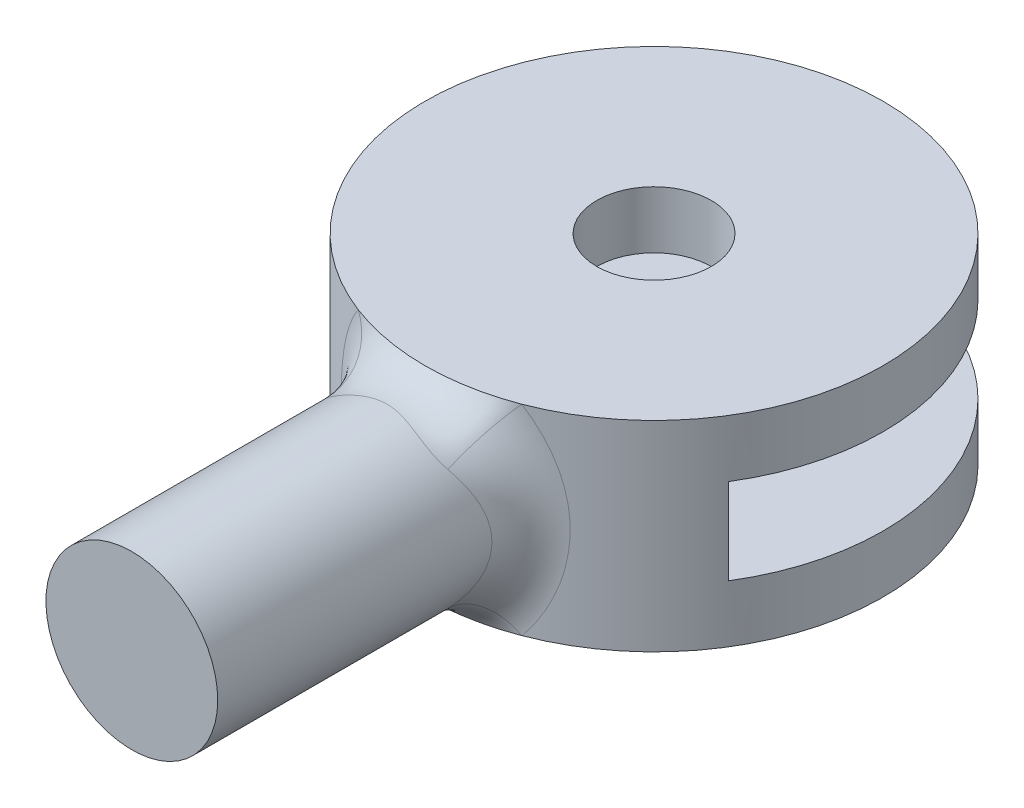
ISO-10303-21;
HEADER;
FILE_DESCRIPTION(('STEP AP214'),'2;1');
FILE_NAME('part.step','',(''),(''),'','','');
FILE_SCHEMA(('AUTOMOTIVE_DESIGN { 1 0 10303 214 1 1 1 1 }'));
ENDSEC;
DATA;
#1=APPLICATION_CONTEXT('core data for automotive mechanical design processes');
#2=APPLICATION_PROTOCOL_DEFINITION('international standard','automotive_design',2000,#1);
#3=PRODUCT_CONTEXT('',#1,'mechanical');
#4=PRODUCT('Part','Part','',(#3));
#5=PRODUCT_RELATED_PRODUCT_CATEGORY('part','',(#4));
#6=PRODUCT_DEFINITION_FORMATION('','',#4);
#7=PRODUCT_DEFINITION_CONTEXT('part definition',#1,'design');
#8=PRODUCT_DEFINITION('design','',#6,#7);
#9=PRODUCT_DEFINITION_SHAPE('','',#8);
#10=(LENGTH_UNIT() NAMED_UNIT(*) SI_UNIT(.MILLI.,.METRE.));
#11=(NAMED_UNIT(*) PLANE_ANGLE_UNIT() SI_UNIT($,.RADIAN.));
#12=(NAMED_UNIT(*) SI_UNIT($,.STERADIAN.) SOLID_ANGLE_UNIT());
#13=UNCERTAINTY_MEASURE_WITH_UNIT(LENGTH_MEASURE(1.E-05),#10,'distance_accuracy_value','');
#14=(GEOMETRIC_REPRESENTATION_CONTEXT(3) GLOBAL_UNCERTAINTY_ASSIGNED_CONTEXT((#13)) GLOBAL_UNIT_ASSIGNED_CONTEXT((#10,
#11,#12)) REPRESENTATION_CONTEXT('',''));
#15=CARTESIAN_POINT('',(0.,0.,0.));
#16=DIRECTION('',(0.,0.,1.));
#17=DIRECTION('',(1.,0.,0.));
#18=AXIS2_PLACEMENT_3D('',#15,#16,#17);
#19=CARTESIAN_POINT('',(0.,35.,0.));
#20=DIRECTION('',(0.,-1.,0.));
#21=DIRECTION('',(0.,0.,-1.));
#22=AXIS2_PLACEMENT_3D('',#19,#20,#21);
#23=CYLINDRICAL_SURFACE('',#22,40.);
#24=CARTESIAN_POINT('',(0.,35.,0.));
#25=DIRECTION('',(0.,1.,0.));
#26=DIRECTION('',(0.,0.,1.));
#27=AXIS2_PLACEMENT_3D('',#24,#25,#26);
#28=CIRCLE('',#27,40.);
#29=CARTESIAN_POINT('',(14.2828568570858,35.,37.3630833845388));
#30=VERTEX_POINT('',#29);
#31=CARTESIAN_POINT('',(-14.2828568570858,35.,37.3630833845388));
#32=VERTEX_POINT('',#31);
#33=EDGE_CURVE('E258',#30,#32,#28,.T.);
#34=ORIENTED_EDGE('',*,*,#33,.F.);
#35=CARTESIAN_POINT('',(11.5664343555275,37.8952198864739,38.2912208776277));
#36=CARTESIAN_POINT('',(7.02605387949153,30.9059359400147,39.6627105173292));
#37=CARTESIAN_POINT('',(8.67482576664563,29.7371319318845,47.8640260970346));
#38=CARTESIAN_POINT('',(12.0064502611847,37.5053163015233,38.1583394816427));
#39=CARTESIAN_POINT('',(7.37224545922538,30.7270581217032,39.6148949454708));
#40=CARTESIAN_POINT('',(9.00483769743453,29.503189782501,47.697924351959));
#41=CARTESIAN_POINT('',(12.4329394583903,37.0939657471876,38.0212042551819));
#42=CARTESIAN_POINT('',(7.72122235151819,30.5280104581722,39.5606608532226));
#43=CARTESIAN_POINT('',(9.32470459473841,29.256379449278,47.5265053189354));
#44=CARTESIAN_POINT('',(13.2569900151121,36.230869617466,37.74176508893));
#45=CARTESIAN_POINT('',(8.41426175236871,30.0903806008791,39.4414229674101));
#46=CARTESIAN_POINT('',(9.94274251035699,28.7385217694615,47.1772063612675));
#47=CARTESIAN_POINT('',(13.6545555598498,35.7791299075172,37.5994619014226));
#48=CARTESIAN_POINT('',(8.75834019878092,29.8522569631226,39.3765440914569));
#49=CARTESIAN_POINT('',(10.2409166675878,28.4674779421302,46.9993273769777));
#50=CARTESIAN_POINT('',(14.4203911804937,34.8359426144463,37.3124688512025));
#51=CARTESIAN_POINT('',(9.4368885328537,29.3350680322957,39.2374144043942));
#52=CARTESIAN_POINT('',(10.8152933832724,27.9015655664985,46.6405860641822));
#53=CARTESIAN_POINT('',(14.7885504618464,34.3443577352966,37.1677722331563));
#54=CARTESIAN_POINT('',(9.77150292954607,29.0562368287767,39.1632148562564));
#55=CARTESIAN_POINT('',(11.0914128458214,27.606614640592,46.4597152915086));
#56=CARTESIAN_POINT('',(15.4922609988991,33.3252108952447,36.8799992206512));
#57=CARTESIAN_POINT('',(10.4236640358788,28.4590789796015,39.0083624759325));
#58=CARTESIAN_POINT('',(11.6191957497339,26.9951265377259,46.0999990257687));
#59=CARTESIAN_POINT('',(15.8278092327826,32.7976456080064,36.7369229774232));
#60=CARTESIAN_POINT('',(10.7415140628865,28.1410344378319,38.9277443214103));
#61=CARTESIAN_POINT('',(11.8708569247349,26.6785873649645,45.921153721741));
#62=CARTESIAN_POINT('',(16.4889183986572,31.6671326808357,36.4452458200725));
#63=CARTESIAN_POINT('',(11.3775364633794,27.4414056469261,38.7570902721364));
#64=CARTESIAN_POINT('',(12.3666887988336,26.0002796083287,45.5565572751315));
#65=CARTESIAN_POINT('',(16.8117404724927,31.0615067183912,36.2970625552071));
#66=CARTESIAN_POINT('',(11.694608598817,27.0567295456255,38.666714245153));
#67=CARTESIAN_POINT('',(12.6088053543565,25.6369040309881,45.3713281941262));
#68=CARTESIAN_POINT('',(17.415120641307,29.8144587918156,36.0114568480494));
#69=CARTESIAN_POINT('',(12.2951255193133,26.2463965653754,38.4870020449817));
#70=CARTESIAN_POINT('',(13.0613404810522,24.8886752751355,45.0143210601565));
#71=CARTESIAN_POINT('',(17.6956813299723,29.1730390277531,35.8740337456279));
#72=CARTESIAN_POINT('',(12.5791721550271,25.82074125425,38.3975707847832));
#73=CARTESIAN_POINT('',(13.2717609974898,24.5038234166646,44.8425421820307));
#74=CARTESIAN_POINT('',(18.21188809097,27.8584178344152,35.6147517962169));
#75=CARTESIAN_POINT('',(13.106990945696,24.9327948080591,38.2248672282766));
#76=CARTESIAN_POINT('',(13.6589160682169,23.7150507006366,44.5184397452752));
#77=CARTESIAN_POINT('',(18.4475683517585,27.185241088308,35.4928811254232));
#78=CARTESIAN_POINT('',(13.3514279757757,24.470318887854,38.1414401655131));
#79=CARTESIAN_POINT('',(13.8356762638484,23.3111446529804,44.3661014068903));
#80=CARTESIAN_POINT('',(18.8716838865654,25.8110003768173,35.2692090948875));
#81=CARTESIAN_POINT('',(13.7943609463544,23.5136392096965,37.9857691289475));
#82=CARTESIAN_POINT('',(14.153762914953,22.4866002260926,44.0865113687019));
#83=CARTESIAN_POINT('',(19.0601256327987,25.1099402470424,35.1674049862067));
#84=CARTESIAN_POINT('',(13.9934792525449,23.01900566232,37.9133410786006));
#85=CARTESIAN_POINT('',(14.2950942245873,22.0659641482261,43.9592562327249));
#86=CARTESIAN_POINT('',(19.3781709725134,23.7249369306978,34.9931071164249));
#87=CARTESIAN_POINT('',(14.3310364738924,22.032535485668,37.7879739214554));
#88=CARTESIAN_POINT('',(14.5336282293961,21.2349621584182,43.7413838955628));
#89=CARTESIAN_POINT('',(19.5104714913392,23.0422222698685,34.9192945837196));
#90=CARTESIAN_POINT('',(14.4726626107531,21.5416666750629,37.7340306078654));
#91=CARTESIAN_POINT('',(14.6328536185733,20.8253333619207,43.6491182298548));
#92=CARTESIAN_POINT('',(19.7289533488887,21.6617989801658,34.7963244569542));
#93=CARTESIAN_POINT('',(14.7070098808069,20.5435168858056,37.6436433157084));
#94=CARTESIAN_POINT('',(14.7967150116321,19.9970793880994,43.4954055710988));
#95=CARTESIAN_POINT('',(19.815130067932,20.9640888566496,34.7471693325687));
#96=CARTESIAN_POINT('',(14.8000764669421,20.0355524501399,37.6070708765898));
#97=CARTESIAN_POINT('',(14.8613475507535,19.5784533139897,43.4339616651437));
#98=CARTESIAN_POINT('',(19.9398489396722,19.5616528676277,34.6757493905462));
#99=CARTESIAN_POINT('',(14.9347625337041,19.0116965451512,37.5538482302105));
#100=CARTESIAN_POINT('',(14.9548867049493,18.7369917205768,43.3446867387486));
#101=CARTESIAN_POINT('',(19.9785074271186,18.8569484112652,34.6534189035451));
#102=CARTESIAN_POINT('',(14.9767179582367,18.4950515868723,37.5370671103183));
#103=CARTESIAN_POINT('',(14.9838805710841,18.3141690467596,43.3167736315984));
#104=CARTESIAN_POINT('',(20.0079129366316,17.4458051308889,34.6364518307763));
#105=CARTESIAN_POINT('',(15.0085642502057,17.460475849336,37.5243487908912));
#106=CARTESIAN_POINT('',(15.0059347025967,17.4674830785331,43.2955647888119));
#107=CARTESIAN_POINT('',(19.9986912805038,16.7393677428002,34.6417971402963));
#108=CARTESIAN_POINT('',(14.9985400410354,16.9417217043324,37.5283776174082));
#109=CARTESIAN_POINT('',(14.9990184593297,17.043620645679,43.3022464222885));
#110=CARTESIAN_POINT('',(19.9471256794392,15.6407378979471,34.6714934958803));
#111=CARTESIAN_POINT('',(14.9427515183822,16.1372608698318,37.5505980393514));
#112=CARTESIAN_POINT('',(14.9603442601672,16.384442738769,43.3393668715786));
#113=CARTESIAN_POINT('',(19.921109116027,15.2468077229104,34.686465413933));
#114=CARTESIAN_POINT('',(14.9145860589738,15.8489642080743,37.5618048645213));
#115=CARTESIAN_POINT('',(14.9408318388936,16.1480846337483,43.3580817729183));
#116=CARTESIAN_POINT('',(19.8542569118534,14.4616517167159,34.7247747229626));
#117=CARTESIAN_POINT('',(14.8423716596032,15.2755417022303,37.5903694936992));
#118=CARTESIAN_POINT('',(14.8906926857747,15.6769910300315,43.4059684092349));
#119=CARTESIAN_POINT('',(19.8134248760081,14.0704252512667,34.7481100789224));
#120=CARTESIAN_POINT('',(14.7982911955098,14.99027799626,37.6077396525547));
#121=CARTESIAN_POINT('',(14.8600686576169,15.4422551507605,43.4351376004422));
#122=CARTESIAN_POINT('',(19.6815048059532,13.0036778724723,34.8230935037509));
#123=CARTESIAN_POINT('',(14.6561531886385,14.2142705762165,37.663324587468));
#124=CARTESIAN_POINT('',(14.7611286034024,14.8022067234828,43.5288668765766));
#125=CARTESIAN_POINT('',(19.5755801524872,12.331817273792,34.882918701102));
#126=CARTESIAN_POINT('',(14.5422172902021,13.7278009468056,37.7074797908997));
#127=CARTESIAN_POINT('',(14.6816851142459,14.399090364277,43.6036483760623));
#128=CARTESIAN_POINT('',(19.3208344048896,11.0043407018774,35.0246555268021));
#129=CARTESIAN_POINT('',(14.2702263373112,12.774172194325,37.8106916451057));
#130=CARTESIAN_POINT('',(14.4906258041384,13.6026044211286,43.7808194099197));
#131=CARTESIAN_POINT('',(19.1719855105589,10.3487355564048,35.1065814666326));
#132=CARTESIAN_POINT('',(14.1117709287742,12.3064583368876,37.869891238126));
#133=CARTESIAN_POINT('',(14.3789891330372,13.2092413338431,43.8832268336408));
#134=CARTESIAN_POINT('',(18.8328119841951,9.05702626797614,35.2896923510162));
#135=CARTESIAN_POINT('',(13.7540528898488,11.3945886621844,37.9999296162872));
#136=CARTESIAN_POINT('',(14.124608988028,12.4342157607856,44.1121154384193));
#137=CARTESIAN_POINT('',(18.6423853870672,8.42097453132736,35.3909245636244));
#138=CARTESIAN_POINT('',(13.5542411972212,10.950066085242,38.0709421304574));
#139=CARTESIAN_POINT('',(13.9817890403,12.0525847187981,44.2386557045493));
#140=CARTESIAN_POINT('',(18.2221521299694,7.17357062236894,35.6091167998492));
#141=CARTESIAN_POINT('',(13.1182802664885,10.0899032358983,38.2207226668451));
#142=CARTESIAN_POINT('',(13.6666140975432,11.3041423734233,44.5113960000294));
#143=CARTESIAN_POINT('',(17.9923248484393,6.56223159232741,35.7260850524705));
#144=CARTESIAN_POINT('',(12.8816209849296,9.67399859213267,38.2996310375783));
#145=CARTESIAN_POINT('',(13.4942436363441,10.937338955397,44.6576063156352));
#146=CARTESIAN_POINT('',(17.4968718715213,5.37139248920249,35.9713132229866));
#147=CARTESIAN_POINT('',(12.378351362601,8.87719763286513,38.4607414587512));
#148=CARTESIAN_POINT('',(13.1226539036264,10.2228354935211,44.9641415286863));
#149=CARTESIAN_POINT('',(17.2314733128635,4.79172081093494,36.0994998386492));
#150=CARTESIAN_POINT('',(12.1114350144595,8.495962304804,38.5430303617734));
#151=CARTESIAN_POINT('',(12.9236049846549,9.87503248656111,45.1243747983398));
#152=CARTESIAN_POINT('',(16.6656742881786,3.66281746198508,36.3641695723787));
#153=CARTESIAN_POINT('',(11.5514265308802,7.76821122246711,38.7076170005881));
#154=CARTESIAN_POINT('',(12.4992557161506,9.19769047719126,45.4552119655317));
#155=CARTESIAN_POINT('',(16.3652716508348,3.11358768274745,36.5006532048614));
#156=CARTESIAN_POINT('',(11.2578833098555,7.42172536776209,38.7899784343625));
#157=CARTESIAN_POINT('',(12.2739537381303,8.86815260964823,45.62581650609));
#158=CARTESIAN_POINT('',(15.731546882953,2.04845829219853,36.7782267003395));
#159=CARTESIAN_POINT('',(10.6501425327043,6.76570603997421,38.9511808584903));
#160=CARTESIAN_POINT('',(11.7986601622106,8.22907497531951,45.9727833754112));
#161=CARTESIAN_POINT('',(15.398255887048,1.53252790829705,36.9193121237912));
#162=CARTESIAN_POINT('',(10.3355817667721,6.45629926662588,39.0300393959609));
#163=CARTESIAN_POINT('',(11.5486919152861,7.9195167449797,46.1491401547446));
#164=CARTESIAN_POINT('',(14.7001930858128,0.53564455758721,37.2027720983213));
#165=CARTESIAN_POINT('',(9.69096499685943,5.87524058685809,39.1813353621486));
#166=CARTESIAN_POINT('',(11.0251448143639,7.32138673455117,46.5034651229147));
#167=CARTESIAN_POINT('',(14.3354191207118,0.0546939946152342,37.3451467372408));
#168=CARTESIAN_POINT('',(9.36062798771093,5.60387387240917,39.2537340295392));
#169=CARTESIAN_POINT('',(10.7515643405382,7.03281639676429,46.6814334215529));
#170=CARTESIAN_POINT('',(13.5451493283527,-0.907599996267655,37.639351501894));
#171=CARTESIAN_POINT('',(8.66249151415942,5.07863376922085,39.395280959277));
#172=CARTESIAN_POINT('',(10.1588619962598,6.45544000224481,47.0491893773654));
#173=CARTESIAN_POINT('',(13.1171277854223,-1.38579245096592,37.7910086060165));
#174=CARTESIAN_POINT('',(8.29397058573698,4.82868395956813,39.4635149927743));
#175=CARTESIAN_POINT('',(9.83784583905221,6.16852452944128,47.2387607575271));
#176=CARTESIAN_POINT('',(12.2284564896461,-2.29562584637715,38.0878511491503));
#177=CARTESIAN_POINT('',(7.55256234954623,4.37298351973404,39.5875593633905));
#178=CARTESIAN_POINT('',(9.17134236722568,5.62262449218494,47.6098139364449));
#179=CARTESIAN_POINT('',(11.767808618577,-2.72726946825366,38.2330369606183));
#180=CARTESIAN_POINT('',(7.17968445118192,4.16779205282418,39.6432128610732));
#181=CARTESIAN_POINT('',(8.82585646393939,5.363638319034,47.7912962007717));
#182=CARTESIAN_POINT('',(10.815401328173,-3.54163962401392,38.513289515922));
#183=CARTESIAN_POINT('',(6.43593694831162,3.7994881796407,39.7411963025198));
#184=CARTESIAN_POINT('',(8.1115509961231,4.87501622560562,48.1416118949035));
#185=CARTESIAN_POINT('',(10.3235888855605,-3.92427925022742,38.6483381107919));
#186=CARTESIAN_POINT('',(6.06530916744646,3.63705105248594,39.783317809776));
#187=CARTESIAN_POINT('',(7.74269166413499,4.64543244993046,48.3104226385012));
#188=CARTESIAN_POINT('',(9.3122718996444,-4.63661511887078,38.9044372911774));
#189=CARTESIAN_POINT('',(5.3321891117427,3.35113409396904,39.8547250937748));
#190=CARTESIAN_POINT('',(6.98420392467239,4.21803092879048,48.6305466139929));
#191=CARTESIAN_POINT('',(8.79275523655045,-4.96628793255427,39.0254816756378));
#192=CARTESIAN_POINT('',(4.97013832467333,3.22824330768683,39.8838275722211));
#193=CARTESIAN_POINT('',(6.59456642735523,4.02022724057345,48.7818520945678));
#194=CARTESIAN_POINT('',(8.260951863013,-5.26773602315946,39.1376631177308));
#195=CARTESIAN_POINT('',(4.6174547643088,3.12354705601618,39.9067114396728));
#196=CARTESIAN_POINT('',(6.19571389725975,3.83935838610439,48.9220788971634));
#197=(BOUNDED_SURFACE() B_SPLINE_SURFACE(3,2,((#35,#36,#37),(#38,#39,#40),(#41,#42,#43),(#44,
#45,#46),(#47,#48,#49),(#50,#51,#52),(#53,#54,#55),(#56,#57,#58),(#59,#60,#61),(#62,#63,#64),
(#65,#66,#67),(#68,#69,#70),(#71,#72,#73),(#74,#75,#76),(#77,#78,#79),(#80,#81,#82),(#83,#84,
#85),(#86,#87,#88),(#89,#90,#91),(#92,#93,#94),(#95,#96,#97),(#98,#99,#100),(#101,#102,#103),
(#104,#105,#106),(#107,#108,#109),(#110,#111,#112),(#113,#114,#115),(#116,#117,#118),(#119,#120,
#121),(#122,#123,#124),(#125,#126,#127),(#128,#129,#130),(#131,#132,#133),(#134,#135,#136),
(#137,#138,#139),(#140,#141,#142),(#143,#144,#145),(#146,#147,#148),(#149,#150,#151),(#152,#153,
#154),(#155,#156,#157),(#158,#159,#160),(#161,#162,#163),(#164,#165,#166),(#167,#168,#169),
(#170,#171,#172),(#173,#174,#175),(#176,#177,#178),(#179,#180,#181),(#182,#183,#184),(#185,#186,
#187),(#188,#189,#190),(#191,#192,#193),(#194,#195,#196)),.UNSPECIFIED.,.F.,.F.,
.F.) B_SPLINE_SURFACE_WITH_KNOTS((4,2,2,2,2,2,2,2,2,2,2,2,2,2,2,2,2,2,2,2,2,2,2,2,2,2,4),(3,3),
(0.,2.08241542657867,4.16452892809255,6.25414958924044,8.34396369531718,10.5940270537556,
12.8439522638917,15.092156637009,17.3400528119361,19.4624868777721,21.5851334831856,
23.7025729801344,25.8186274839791,27.0052469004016,28.1915777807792,30.2549981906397,
32.3197580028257,34.3896394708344,36.4606076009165,38.5189313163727,40.577382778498,
42.6339039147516,44.690566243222,46.914540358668,49.1383863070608,51.3661231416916,
53.5948426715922),(0.,1.),
.UNSPECIFIED.) GEOMETRIC_REPRESENTATION_ITEM() RATIONAL_B_SPLINE_SURFACE(((1.,0.763946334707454,
1.),(1.,0.76811112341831,1.),(1.,0.772349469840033,1.),(1.,0.78086744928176,1.),(1.,
0.785147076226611,1.),(1.,0.793658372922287,1.),(1.,0.797889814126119,1.),(1.,0.806192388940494,
1.),(1.,0.810263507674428,1.),(1.,0.818457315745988,1.),(1.,0.822560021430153,1.),(1.,
0.830368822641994,1.),(1.,0.834074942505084,1.),(1.,0.84099101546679,1.),(1.,0.844201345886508,
1.),(1.,0.850040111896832,1.),(1.,0.85266862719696,1.),(1.,0.85713812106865,1.),(1.,
0.859014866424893,1.),(1.,0.862128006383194,1.),(1.,0.863364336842,1.),(1.,0.865157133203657,
1.),(1.,0.865715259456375,1.),(1.,0.866139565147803,1.),(1.,0.866006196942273,1.),(1.,
0.865262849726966,1.),(1.,0.864887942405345,1.),(1.,0.863926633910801,1.),(1.,0.863340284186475,
1.),(1.,0.861451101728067,1.),(1.,0.859939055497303,1.),(1.,0.856330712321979,1.),(1.,
0.854234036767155,1.),(1.,0.849505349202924,1.),(1.,0.846872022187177,1.),(1.,0.841136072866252,
1.),(1.,0.83803320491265,1.),(1.,0.831450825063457,1.),(1.,0.827973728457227,1.),(1.,
0.82070313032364,1.),(1.,0.816909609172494,1.),(1.,0.80909119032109,1.),(1.,0.805066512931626,
1.),(1.,0.79686915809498,1.),(1.,0.792696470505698,1.),(1.,0.783954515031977,1.),(1.,
0.779380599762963,1.),(1.,0.770296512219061,1.),(1.,0.765786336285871,1.),(1.,0.756958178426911,
1.),(1.,0.752640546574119,1.),(1.,0.744349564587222,1.),(1.,0.740376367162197,1.),(1.,
0.736649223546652,1.))) REPRESENTATION_ITEM('') SURFACE());
#198=CARTESIAN_POINT('',(-20.,17.5000000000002,34.6410161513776));
#199=CARTESIAN_POINT('',(-20.0005635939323,19.803835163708,34.6396249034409));
#200=CARTESIAN_POINT('',(-19.7452166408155,22.1041750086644,34.7916411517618));
#201=CARTESIAN_POINT('',(-18.7141310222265,26.6391411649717,35.3573370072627));
#202=CARTESIAN_POINT('',(-17.9202697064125,28.8685490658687,35.7800993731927));
#203=CARTESIAN_POINT('',(-15.7429018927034,33.1385761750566,36.7925986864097));
#204=CARTESIAN_POINT('',(-14.3297892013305,35.1624313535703,37.3901388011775));
#205=CARTESIAN_POINT('',(-10.8591677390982,38.6785017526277,38.5408526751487));
#206=CARTESIAN_POINT('',(-8.79436943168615,40.1642731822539,39.093430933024));
#207=CARTESIAN_POINT('',(-4.89795764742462,41.8262293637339,39.7301624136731));
#208=CARTESIAN_POINT('',(-3.20255686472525,42.2691392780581,39.9075637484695));
#209=CARTESIAN_POINT('',(-0.929279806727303,42.4833593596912,39.993411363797));
#210=CARTESIAN_POINT('',(-0.371142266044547,42.5062981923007,40.0026136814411));
#211=CARTESIAN_POINT('',(2.24564425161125,42.4716563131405,39.9883154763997));
#212=CARTESIAN_POINT('',(4.32202741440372,42.0342280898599,39.8113591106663));
#213=CARTESIAN_POINT('',(6.2083948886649,41.2649908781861,39.5152611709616));
#214=CARTESIAN_POINT('',(6.21355941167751,41.2628817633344,39.5144493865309));
#215=CARTESIAN_POINT('',(8.18359355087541,40.4572181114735,39.2043848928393));
#216=CARTESIAN_POINT('',(9.98927975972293,39.2894797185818,38.7664015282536));
#217=CARTESIAN_POINT('',(13.3950145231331,36.2786910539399,37.7402882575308));
#218=CARTESIAN_POINT('',(14.9163914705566,34.3576611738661,37.1393532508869));
#219=CARTESIAN_POINT('',(17.5590070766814,29.8355672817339,35.9727635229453));
#220=CARTESIAN_POINT('',(18.5869551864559,27.1758403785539,35.4256802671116));
#221=CARTESIAN_POINT('',(19.8480424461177,21.6735077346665,34.736619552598));
#222=CARTESIAN_POINT('',(20.0963043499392,18.8354851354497,34.5869430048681));
#223=CARTESIAN_POINT('',(19.9288795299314,15.2473721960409,34.6816183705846));
#224=CARTESIAN_POINT('',(19.8620889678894,14.4622897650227,34.7201229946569));
#225=CARTESIAN_POINT('',(19.4358770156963,11.0230628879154,34.963818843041));
#226=CARTESIAN_POINT('',(18.7589120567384,8.40908573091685,35.3472344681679));
#227=CARTESIAN_POINT('',(16.7862966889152,3.65941091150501,36.3224729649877));
#228=CARTESIAN_POINT('',(15.527884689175,1.5050030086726,36.9012528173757));
#229=CARTESIAN_POINT('',(12.3681575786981,-2.33904992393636,38.0774843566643));
#230=CARTESIAN_POINT('',(10.4606599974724,-4.02393100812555,38.6750634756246));
#231=CARTESIAN_POINT('',(6.74413981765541,-6.12540363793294,39.4566493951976));
#232=CARTESIAN_POINT('',(5.08838712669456,-6.77334784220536,39.7114554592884));
#233=CARTESIAN_POINT('',(2.77839935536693,-7.2696471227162,39.9081646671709));
#234=CARTESIAN_POINT('',(2.17874382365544,-7.36373976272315,39.9456972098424));
#235=CARTESIAN_POINT('',(-0.35714327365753,-7.60997407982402,40.0434990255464));
#236=CARTESIAN_POINT('',(-2.34992442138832,-7.4394643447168,39.9741515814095));
#237=CARTESIAN_POINT('',(-4.36243717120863,-6.89890098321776,39.7617425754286));
#238=CARTESIAN_POINT('',(-4.5129163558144,-6.85607000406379,39.7449280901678));
#239=CARTESIAN_POINT('',(-6.65323742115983,-6.21361068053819,39.4931883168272));
#240=CARTESIAN_POINT('',(-8.52543922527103,-5.23881956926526,39.116823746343));
#241=CARTESIAN_POINT('',(-12.0676365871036,-2.6276812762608,38.1878674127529));
#242=CARTESIAN_POINT('',(-13.6747546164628,-0.918976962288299,37.618192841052));
#243=CARTESIAN_POINT('',(-16.5767021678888,3.20431890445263,36.4418795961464));
#244=CARTESIAN_POINT('',(-17.7732725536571,5.68933984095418,35.8451884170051));
#245=CARTESIAN_POINT('',(-19.5302094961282,11.2607997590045,34.9254854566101));
#246=CARTESIAN_POINT('',(-19.9992376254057,14.3835977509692,34.6428980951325));
#247=CARTESIAN_POINT('',(-20.,17.5000000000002,34.6410161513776));
#248=B_SPLINE_CURVE_WITH_KNOTS('',3,(#198,#199,#200,#201,#202,#203,#204,#205,#206,#207,#208,
#209,#210,#211,#212,#213,#214,#215,#216,#217,#218,#219,#220,#221,#222,#223,#224,#225,#226,#227,
#228,#229,#230,#231,#232,#233,#234,#235,#236,#237,#238,#239,#240,#241,#242,#243,#244,#245,#246,
#247),.UNSPECIFIED.,.T.,.F.,(4,2,2,2,2,2,2,2,2,2,2,2,2,2,2,2,2,2,2,2,2,2,2,2,4),(0.,
6.88781101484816,14.0197354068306,21.5379198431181,29.1433728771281,34.3193029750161,
35.9944201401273,42.1530801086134,42.1699924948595,48.605771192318,56.0675237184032,
64.6401491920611,73.0454397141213,75.4111908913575,83.4595255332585,91.0517212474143,
98.7183558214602,104.004895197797,105.827781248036,111.63506225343,112.107309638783,
118.382058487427,125.516763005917,133.853738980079,143.170894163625),.UNSPECIFIED.);
#249=CARTESIAN_POINT('',(14.2828568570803,0.,37.3630833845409));
#250=VERTEX_POINT('',#249);
#251=EDGE_CURVE('E11',#30,#250,#248,.T.);
#252=ORIENTED_EDGE('',*,*,#251,.T.);
#253=CARTESIAN_POINT('',(0.,0.,0.));
#254=DIRECTION('',(0.,1.,0.));
#255=DIRECTION('',(0.,0.,1.));
#256=AXIS2_PLACEMENT_3D('',#253,#254,#255);
#257=CIRCLE('',#256,40.);
#258=CARTESIAN_POINT('',(-14.2828568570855,0.,37.3630833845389));
#259=VERTEX_POINT('',#258);
#260=EDGE_CURVE('E263',#250,#259,#257,.T.);
#261=ORIENTED_EDGE('',*,*,#260,.T.);
#262=CARTESIAN_POINT('',(-19.9920904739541,16.7969725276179,34.6455815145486));
#263=CARTESIAN_POINT('',(-14.9914322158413,16.9844959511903,37.5311908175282));
#264=CARTESIAN_POINT('',(-14.9940678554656,17.0781835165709,43.3069768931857));
#265=CARTESIAN_POINT('',(-20.0064351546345,17.4342092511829,34.6373020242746));
#266=CARTESIAN_POINT('',(-15.0069687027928,17.4515540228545,37.5249834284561));
#267=CARTESIAN_POINT('',(-15.0048263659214,17.4605255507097,43.296627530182));
#268=CARTESIAN_POINT('',(-20.0012585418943,18.0723146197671,34.6403008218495));
#269=CARTESIAN_POINT('',(-15.0013446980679,17.9200361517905,37.5272418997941));
#270=CARTESIAN_POINT('',(-15.0009439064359,17.8433887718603,43.3003760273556));
#271=CARTESIAN_POINT('',(-19.9519536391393,19.345340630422,34.6687233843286));
#272=CARTESIAN_POINT('',(-14.947961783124,18.8527912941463,37.5485334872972));
#273=CARTESIAN_POINT('',(-14.9639652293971,18.6072043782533,43.3359042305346));
#274=CARTESIAN_POINT('',(-19.9078289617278,19.9802615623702,34.6941450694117));
#275=CARTESIAN_POINT('',(-14.9001374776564,19.317666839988,37.5675926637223));
#276=CARTESIAN_POINT('',(-14.9308717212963,18.9881569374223,43.3676813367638));
#277=CARTESIAN_POINT('',(-19.7812074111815,21.242226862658,34.7664940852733));
#278=CARTESIAN_POINT('',(-14.7635154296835,20.2378488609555,37.6214135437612));
#279=CARTESIAN_POINT('',(-14.8359055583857,19.7453361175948,43.4581176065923));
#280=CARTESIAN_POINT('',(-19.6987044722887,21.8692699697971,34.8134248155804));
#281=CARTESIAN_POINT('',(-14.6745382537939,20.6937160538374,37.6562449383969));
#282=CARTESIAN_POINT('',(-14.7740283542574,20.121561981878,43.5167810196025));
#283=CARTESIAN_POINT('',(-19.496353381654,23.1109792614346,34.9271475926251));
#284=CARTESIAN_POINT('',(-14.4576195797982,21.5908146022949,37.7397364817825));
#285=CARTESIAN_POINT('',(-14.6222650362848,20.8665875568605,43.6589344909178));
#286=CARTESIAN_POINT('',(-19.3765042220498,23.7256451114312,34.9939401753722));
#287=CARTESIAN_POINT('',(-14.3294151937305,22.0325375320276,37.7884938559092));
#288=CARTESIAN_POINT('',(-14.5323781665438,21.2353870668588,43.7424252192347));
#289=CARTESIAN_POINT('',(-19.1047236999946,24.9214301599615,35.1430338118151));
#290=CARTESIAN_POINT('',(-14.0409052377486,22.8845505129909,37.8957988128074));
#291=CARTESIAN_POINT('',(-14.3285427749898,21.952858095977,43.9287922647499));
#292=CARTESIAN_POINT('',(-18.9538034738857,25.503006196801,35.2248388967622));
#293=CARTESIAN_POINT('',(-13.8812935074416,23.2958022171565,37.9541395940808));
#294=CARTESIAN_POINT('',(-14.2153526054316,22.3018037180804,44.0310486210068));
#295=CARTESIAN_POINT('',(-18.6193520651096,26.647885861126,35.4027618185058));
#296=CARTESIAN_POINT('',(-13.5307226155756,24.0970019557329,38.0789143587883));
#297=CARTESIAN_POINT('',(-13.9645140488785,22.9887315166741,44.2534522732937));
#298=CARTESIAN_POINT('',(-18.4358097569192,27.2111831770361,35.4988845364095));
#299=CARTESIAN_POINT('',(-13.3394120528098,24.4872115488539,38.1454555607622));
#300=CARTESIAN_POINT('',(-13.8268573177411,23.3267099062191,44.3736056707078));
#301=CARTESIAN_POINT('',(-17.8384719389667,28.8694216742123,35.8048802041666));
#302=CARTESIAN_POINT('',(-12.7213214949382,25.6247023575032,38.3536247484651));
#303=CARTESIAN_POINT('',(-13.3788539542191,24.3216530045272,44.7561002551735));
#304=CARTESIAN_POINT('',(-17.3778066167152,29.9334007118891,36.0324718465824));
#305=CARTESIAN_POINT('',(-12.2519539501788,26.3330597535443,38.5031090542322));
#306=CARTESIAN_POINT('',(-13.0333549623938,24.9600404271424,45.0405898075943));
#307=CARTESIAN_POINT('',(-16.2829648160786,32.0783125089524,36.5413282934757));
#308=CARTESIAN_POINT('',(-11.1706331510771,27.7110798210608,38.8177037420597));
#309=CARTESIAN_POINT('',(-12.2122236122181,26.2469875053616,45.6766603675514));
#310=CARTESIAN_POINT('',(-15.6348886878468,33.1469943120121,36.8257562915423));
#311=CARTESIAN_POINT('',(-10.5461153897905,28.3650313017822,38.9827479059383));
#312=CARTESIAN_POINT('',(-11.7261665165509,26.8881965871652,46.0321953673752));
#313=CARTESIAN_POINT('',(-14.567967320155,34.6418959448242,37.2548265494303));
#314=CARTESIAN_POINT('',(-9.57070074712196,29.2258496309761,39.2081572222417));
#315=CARTESIAN_POINT('',(-10.9259754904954,27.7851375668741,46.5685331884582));
#316=CARTESIAN_POINT('',(-14.1962489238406,35.1224577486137,37.398350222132));
#317=CARTESIAN_POINT('',(-9.23596630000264,29.4946844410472,39.2801544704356));
#318=CARTESIAN_POINT('',(-10.6471866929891,28.0734746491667,46.7479377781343));
#319=CARTESIAN_POINT('',(-13.4225780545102,36.0455615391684,37.6829416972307));
#320=CARTESIAN_POINT('',(-8.55704894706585,29.9936113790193,39.4149653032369));
#321=CARTESIAN_POINT('',(-10.0669335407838,28.6273369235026,47.1036771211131));
#322=CARTESIAN_POINT('',(-13.0206212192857,36.4880980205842,37.8240091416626));
#323=CARTESIAN_POINT('',(-8.21272482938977,30.2233024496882,39.4776847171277));
#324=CARTESIAN_POINT('',(-9.76546591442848,28.8928588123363,47.2800114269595));
#325=CARTESIAN_POINT('',(-12.1529098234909,37.3685179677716,38.1121135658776));
#326=CARTESIAN_POINT('',(-7.49076735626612,30.6623593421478,39.5971554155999));
#327=CARTESIAN_POINT('',(-9.11468236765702,29.4211107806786,47.6401419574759));
#328=CARTESIAN_POINT('',(-11.6846374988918,37.8027929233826,38.2586352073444));
#329=CARTESIAN_POINT('',(-7.11318083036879,30.8675404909,39.6527232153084));
#330=CARTESIAN_POINT('',(-8.76347812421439,29.6816757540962,47.8232940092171));
#331=CARTESIAN_POINT('',(-10.7174375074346,38.6200841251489,38.5407595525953));
#332=CARTESIAN_POINT('',(-6.36120948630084,31.2345813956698,39.750127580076));
#333=CARTESIAN_POINT('',(-8.03807813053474,30.1720504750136,48.1759494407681));
#334=CARTESIAN_POINT('',(-10.2185220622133,39.0031206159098,38.676366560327));
#335=CARTESIAN_POINT('',(-5.98707206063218,31.3958427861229,39.7917797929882));
#336=CARTESIAN_POINT('',(-7.66389154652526,30.4018723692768,48.3454582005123));
#337=CARTESIAN_POINT('',(-9.19285367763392,39.7146977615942,38.9329015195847));
#338=CARTESIAN_POINT('',(-5.24818515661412,31.6786200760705,39.8618334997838));
#339=CARTESIAN_POINT('',(-6.89464025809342,30.8288186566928,48.6661268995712));
#340=CARTESIAN_POINT('',(-8.66610403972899,40.0432448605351,39.053831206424));
#341=CARTESIAN_POINT('',(-4.88390284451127,31.7995546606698,39.8900530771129));
#342=CARTESIAN_POINT('',(-6.49957802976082,31.0259469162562,48.8172890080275));
#343=CARTESIAN_POINT('',(-7.58822253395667,40.6424488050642,39.2774962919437));
#344=CARTESIAN_POINT('',(-4.1693940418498,32.0066265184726,39.9350186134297));
#345=CARTESIAN_POINT('',(-5.69116690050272,31.385469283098,49.0968703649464));
#346=CARTESIAN_POINT('',(-7.037092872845,40.9131108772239,39.3802333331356));
#347=CARTESIAN_POINT('',(-3.81981522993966,32.0922650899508,39.9516166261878));
#348=CARTESIAN_POINT('',(-5.277819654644,31.5478665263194,49.2252916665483));
#349=CARTESIAN_POINT('',(-5.94502600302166,41.3802822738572,39.5593989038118));
#350=CARTESIAN_POINT('',(-3.15558938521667,32.2308280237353,39.9754937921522));
#351=CARTESIAN_POINT('',(-4.45876950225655,31.8281693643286,49.4492486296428));
#352=CARTESIAN_POINT('',(-5.40515657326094,41.5800166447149,39.636951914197));
#353=CARTESIAN_POINT('',(-2.84059930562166,32.284972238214,39.983149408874));
#354=CARTESIAN_POINT('',(-4.05386742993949,31.9480099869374,49.546189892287));
#355=CARTESIAN_POINT('',(-4.31134681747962,41.9223924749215,39.7707905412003));
#356=CARTESIAN_POINT('',(-2.22450483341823,32.3727446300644,39.9935386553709));
#357=CARTESIAN_POINT('',(-3.23351011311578,32.1534354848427,49.7134881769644));
#358=CARTESIAN_POINT('',(-3.75740689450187,42.0650355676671,39.8270767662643));
#359=CARTESIAN_POINT('',(-1.92409626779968,32.4061538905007,39.9962302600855));
#360=CARTESIAN_POINT('',(-2.81805517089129,32.2390213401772,49.7838459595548));
#361=CARTESIAN_POINT('',(-2.6403635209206,42.2912668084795,39.9166912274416));
#362=CARTESIAN_POINT('',(-1.33408866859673,32.4570787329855,39.9993262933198));
#363=CARTESIAN_POINT('',(-1.98027264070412,32.3747600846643,49.8958640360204));
#364=CARTESIAN_POINT('',(-2.07726586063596,42.3748908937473,39.9500334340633));
#365=CARTESIAN_POINT('',(-1.04518452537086,32.4744772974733,39.9997185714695));
#366=CARTESIAN_POINT('',(-1.55794939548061,32.4249345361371,49.9375417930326));
#367=CARTESIAN_POINT('',(-0.946534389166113,42.4820392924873,39.9928000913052));
#368=CARTESIAN_POINT('',(-0.472567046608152,32.4965244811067,40.0000578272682));
#369=CARTESIAN_POINT('',(-0.709900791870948,32.4892235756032,49.9910001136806));
#370=CARTESIAN_POINT('',(-0.378900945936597,42.5055684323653,40.0022264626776));
#371=CARTESIAN_POINT('',(-0.189545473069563,32.5011206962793,40.0000034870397));
#372=CARTESIAN_POINT('',(-0.284175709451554,32.50334105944,50.0027830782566));
#373=CARTESIAN_POINT('',(0.701743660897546,42.4928482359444,39.9971401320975));
#374=CARTESIAN_POINT('',(0.35090446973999,32.4985635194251,39.9999967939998));
#375=CARTESIAN_POINT('',(0.526307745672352,32.495708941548,49.9964251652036));
#376=CARTESIAN_POINT('',(1.21481290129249,42.4620739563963,39.9848199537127));
#377=CARTESIAN_POINT('',(0.607663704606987,32.4924910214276,40.0000352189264));
#378=CARTESIAN_POINT('',(0.911109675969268,32.4772443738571,49.9810249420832));
#379=CARTESIAN_POINT('',(2.23667531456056,42.3514412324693,39.9406905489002));
#380=CARTESIAN_POINT('',(1.12711099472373,32.4695452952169,39.9995853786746));
#381=CARTESIAN_POINT('',(1.67750648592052,32.4108647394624,49.9258631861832));
#382=CARTESIAN_POINT('',(2.74546880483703,42.2715864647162,39.9088827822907));
#383=CARTESIAN_POINT('',(1.38928540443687,32.4527186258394,39.9990987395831));
#384=CARTESIAN_POINT('',(2.05910160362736,32.3629518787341,49.8861034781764));
#385=CARTESIAN_POINT('',(3.75515785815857,42.0637117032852,39.8265663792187));
#386=CARTESIAN_POINT('',(1.92349121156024,32.4057610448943,39.9961654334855));
#387=CARTESIAN_POINT('',(2.81636839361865,32.2382270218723,49.7832079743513));
#388=CARTESIAN_POINT('',(4.25605349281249,41.9356921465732,39.7760579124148));
#389=CARTESIAN_POINT('',(2.19500308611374,32.3757260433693,39.9937293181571));
#390=CARTESIAN_POINT('',(3.19204011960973,32.1614152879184,49.7200723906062));
#391=CARTESIAN_POINT('',(5.24659289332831,41.6328758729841,39.6575603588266));
#392=CARTESIAN_POINT('',(2.75032724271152,32.2988087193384,39.9849159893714));
#393=CARTESIAN_POINT('',(3.93494466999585,31.9797255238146,49.5719504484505));
#394=CARTESIAN_POINT('',(5.73623635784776,41.4580779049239,39.5895708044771));
#395=CARTESIAN_POINT('',(3.03362456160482,32.2520834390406,39.978568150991));
#396=CARTESIAN_POINT('',(4.30217726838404,31.8748467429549,49.4869635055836));
#397=CARTESIAN_POINT('',(6.69925838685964,41.0642601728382,39.4380096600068));
#398=CARTESIAN_POINT('',(3.61199431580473,32.1379964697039,39.9598282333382));
#399=CARTESIAN_POINT('',(5.02444379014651,31.6385561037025,49.2975120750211));
#400=CARTESIAN_POINT('',(7.17269471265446,40.8454220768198,39.3545021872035));
#401=CARTESIAN_POINT('',(3.90652254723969,32.0709447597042,39.9475164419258));
#402=CARTESIAN_POINT('',(5.37952103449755,31.5072532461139,49.1931277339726));
#403=CARTESIAN_POINT('',(8.1027180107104,40.3650638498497,39.1735932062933));
#404=CARTESIAN_POINT('',(4.50731425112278,31.9122354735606,39.9149550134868));
#405=CARTESIAN_POINT('',(6.07703850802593,31.2190383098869,48.966991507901));
#406=CARTESIAN_POINT('',(8.55930520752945,40.1035442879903,39.0761918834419));
#407=CARTESIAN_POINT('',(4.81315040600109,31.8208675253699,39.8947885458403));
#408=CARTESIAN_POINT('',(6.41947890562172,31.0621265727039,48.8452398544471));
#409=CARTESIAN_POINT('',(9.4533634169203,39.5399002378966,38.8695826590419));
#410=CARTESIAN_POINT('',(5.43401174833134,31.6100861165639,39.8451062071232));
#411=CARTESIAN_POINT('',(7.09002256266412,30.7239401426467,48.5869783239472));
#412=CARTESIAN_POINT('',(9.89083368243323,39.2377741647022,38.7603742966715));
#413=CARTESIAN_POINT('',(5.74869441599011,31.4910136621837,39.8156954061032));
#414=CARTESIAN_POINT('',(7.41812526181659,30.5426644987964,48.4504678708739));
#415=CARTESIAN_POINT('',(10.7448225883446,38.5949252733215,38.5323788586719));
#416=CARTESIAN_POINT('',(6.38369071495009,31.2220824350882,39.7467761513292));
#417=CARTESIAN_POINT('',(8.05861694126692,30.1569551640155,48.1654735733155));
#418=CARTESIAN_POINT('',(11.1613330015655,38.2541874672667,38.4135880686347));
#419=CARTESIAN_POINT('',(6.70377092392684,31.0725850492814,39.7073807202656));
#420=CARTESIAN_POINT('',(8.37099975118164,29.9525124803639,48.0169850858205));
#421=CARTESIAN_POINT('',(12.0069974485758,37.5048290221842,38.1581419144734));
#422=CARTESIAN_POINT('',(7.37289734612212,30.7265868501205,39.6146360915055));
#423=CARTESIAN_POINT('',(9.00524808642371,29.5028974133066,47.6976773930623));
#424=CARTESIAN_POINT('',(12.4340666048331,37.0928770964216,38.0208330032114));
#425=CARTESIAN_POINT('',(7.72219939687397,30.5274203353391,39.5604652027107));
#426=CARTESIAN_POINT('',(9.32554995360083,29.2557262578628,47.5260412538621));
#427=CARTESIAN_POINT('',(13.2592483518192,36.2284119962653,37.7409882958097));
#428=CARTESIAN_POINT('',(8.41612088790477,30.0891800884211,39.4411306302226));
#429=CARTESIAN_POINT('',(9.94443626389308,28.737047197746,47.1762353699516));
#430=CARTESIAN_POINT('',(13.6573589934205,35.7758960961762,37.5984521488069));
#431=CARTESIAN_POINT('',(8.76075556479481,29.8505596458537,39.3760917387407));
#432=CARTESIAN_POINT('',(10.2430192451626,28.4655376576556,46.9980651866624));
#433=CARTESIAN_POINT('',(14.4230356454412,34.8324648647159,37.3114366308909));
#434=CARTESIAN_POINT('',(9.43930113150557,29.3330856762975,39.2368768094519));
#435=CARTESIAN_POINT('',(10.8172767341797,27.899478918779,46.639295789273));
#436=CARTESIAN_POINT('',(14.7905839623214,34.3415276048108,37.1669561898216));
#437=CARTESIAN_POINT('',(9.77337841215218,29.0545943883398,39.1627811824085));
#438=CARTESIAN_POINT('',(11.0929379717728,27.6049165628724,46.4586952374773));
#439=CARTESIAN_POINT('',(15.4931951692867,33.3237425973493,36.8796016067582));
#440=CARTESIAN_POINT('',(10.4245490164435,28.4581942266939,39.0081407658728));
#441=CARTESIAN_POINT('',(11.6198963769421,26.9942455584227,46.0995020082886));
#442=CARTESIAN_POINT('',(15.8282521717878,32.7968883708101,36.736727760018));
#443=CARTESIAN_POINT('',(10.7419432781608,28.1405624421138,38.9276299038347));
#444=CARTESIAN_POINT('',(11.8711891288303,26.6781330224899,45.9209096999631));
#445=CARTESIAN_POINT('',(16.4888549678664,31.6672409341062,36.4452735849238));
#446=CARTESIAN_POINT('',(11.377477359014,27.4414705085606,38.7571053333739));
#447=CARTESIAN_POINT('',(12.3666412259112,26.0003445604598,45.5565919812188));
#448=CARTESIAN_POINT('',(16.8116215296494,31.0617297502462,36.2971170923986));
#449=CARTESIAN_POINT('',(11.6944927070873,27.0568701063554,38.6667470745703));
#450=CARTESIAN_POINT('',(12.6087161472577,25.6370378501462,45.3713963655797));
#451=CARTESIAN_POINT('',(17.4147981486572,29.8151480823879,36.011611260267));
#452=CARTESIAN_POINT('',(12.2948040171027,26.2468460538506,38.4871000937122));
#453=CARTESIAN_POINT('',(13.0610986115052,24.8890888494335,45.0145140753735));
#454=CARTESIAN_POINT('',(17.6952259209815,29.1740926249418,35.874257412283));
#455=CARTESIAN_POINT('',(12.5787119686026,25.8214400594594,38.3977163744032));
#456=CARTESIAN_POINT('',(13.2714194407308,24.5044555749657,44.8428217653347));
#457=CARTESIAN_POINT('',(18.2114518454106,27.8596347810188,35.61497598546));
#458=CARTESIAN_POINT('',(13.1065393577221,24.9336290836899,38.2250199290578));
#459=CARTESIAN_POINT('',(13.6585888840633,23.7157808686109,44.518719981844));
#460=CARTESIAN_POINT('',(18.447243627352,27.1862277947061,35.4930506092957));
#461=CARTESIAN_POINT('',(13.351089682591,24.4710024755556,38.1415572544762));
#462=CARTESIAN_POINT('',(13.8354327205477,23.3117366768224,44.3663132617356));
#463=CARTESIAN_POINT('',(18.8715476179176,25.8115073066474,35.2692827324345));
#464=CARTESIAN_POINT('',(13.7942164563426,23.5139979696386,37.985821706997));
#465=CARTESIAN_POINT('',(14.1536607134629,22.4869043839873,44.0866034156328));
#466=CARTESIAN_POINT('',(19.0600664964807,25.1101977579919,35.1674373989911));
#467=CARTESIAN_POINT('',(13.9934161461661,23.0191900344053,37.9133645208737));
#468=CARTESIAN_POINT('',(14.2950498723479,22.066118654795,43.9592967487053));
#469=CARTESIAN_POINT('',(19.3781812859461,23.7248920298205,34.9931014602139));
#470=CARTESIAN_POINT('',(14.3310473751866,22.0325036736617,37.7879698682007));
#471=CARTESIAN_POINT('',(14.5336359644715,21.2349352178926,43.741376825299));
#472=CARTESIAN_POINT('',(19.5104891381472,23.0421312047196,34.919284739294));
#473=CARTESIAN_POINT('',(14.4726814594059,21.5416013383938,37.7340234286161));
#474=CARTESIAN_POINT('',(14.6328668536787,20.8252787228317,43.6491059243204));
#475=CARTESIAN_POINT('',(19.7289794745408,21.6616134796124,34.7963096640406));
#476=CARTESIAN_POINT('',(14.7070379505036,20.5433824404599,37.6436323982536));
#477=CARTESIAN_POINT('',(14.796734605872,19.9969680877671,43.4953870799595));
#478=CARTESIAN_POINT('',(19.8151573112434,20.9638550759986,34.7471537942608));
#479=CARTESIAN_POINT('',(14.8001058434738,20.0353822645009,37.6070593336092));
#480=CARTESIAN_POINT('',(14.8613679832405,19.5783130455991,43.4339422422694));
#481=CARTESIAN_POINT('',(19.939863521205,19.5614164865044,34.6757409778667));
#482=CARTESIAN_POINT('',(14.9347783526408,19.0115233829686,37.5538419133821));
#483=CARTESIAN_POINT('',(14.9548976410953,18.7368498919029,43.3446762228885));
#484=CARTESIAN_POINT('',(19.9785145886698,18.8567588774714,34.6534147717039));
#485=CARTESIAN_POINT('',(14.9767257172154,18.4949126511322,37.5370640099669));
#486=CARTESIAN_POINT('',(14.983885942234,18.3140553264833,43.3167684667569));
#487=CARTESIAN_POINT('',(20.0079117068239,17.4457101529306,34.6364525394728));
#488=CARTESIAN_POINT('',(15.0085629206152,17.4604061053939,37.5243493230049));
#489=CARTESIAN_POINT('',(15.0059337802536,17.4674260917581,43.2955656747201));
#490=CARTESIAN_POINT('',(19.9986890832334,16.7393204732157,34.6417984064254));
#491=CARTESIAN_POINT('',(14.9985376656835,16.9416870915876,37.5283785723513));
#492=CARTESIAN_POINT('',(14.9990168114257,17.0435922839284,43.3022480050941));
#493=CARTESIAN_POINT('',(19.9471260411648,15.6407458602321,34.6714932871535));
#494=CARTESIAN_POINT('',(14.942751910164,16.1372667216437,37.5505978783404));
#495=CARTESIAN_POINT('',(14.9603445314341,16.38444751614,43.3393666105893));
#496=CARTESIAN_POINT('',(19.9211101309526,15.2468235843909,34.686464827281));
#497=CARTESIAN_POINT('',(14.9145871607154,15.8489758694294,37.5618044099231));
#498=CARTESIAN_POINT('',(14.9408326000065,16.1480941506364,43.3580810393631));
#499=CARTESIAN_POINT('',(19.854258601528,14.4616676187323,34.7247737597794));
#500=CARTESIAN_POINT('',(14.8423734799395,15.2755532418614,37.5903687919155));
#501=CARTESIAN_POINT('',(14.8906939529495,15.6770005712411,43.4059672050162));
#502=CARTESIAN_POINT('',(19.8134259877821,14.0704334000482,34.7481094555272));
#503=CARTESIAN_POINT('',(14.798292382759,14.9902837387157,37.6077392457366));
#504=CARTESIAN_POINT('',(14.8600694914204,15.4422600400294,43.4351368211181));
#505=CARTESIAN_POINT('',(19.6814981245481,13.0036253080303,34.8230972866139));
#506=CARTESIAN_POINT('',(14.6561459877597,14.2142325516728,37.66332730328));
#507=CARTESIAN_POINT('',(14.7611235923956,14.8021751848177,43.5288716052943));
#508=CARTESIAN_POINT('',(19.5755626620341,12.3317115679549,34.8829285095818));
#509=CARTESIAN_POINT('',(14.5421985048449,13.7277257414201,37.7074865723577));
#510=CARTESIAN_POINT('',(14.6816719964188,14.3990269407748,43.6036606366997));
#511=CARTESIAN_POINT('',(19.3207930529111,11.004139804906,35.0246784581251));
#512=CARTESIAN_POINT('',(14.2701821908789,12.7740268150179,37.8107087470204));
#513=CARTESIAN_POINT('',(14.4905947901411,13.6024838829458,43.7808480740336));
#514=CARTESIAN_POINT('',(19.1719310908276,10.3484926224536,35.1066115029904));
#515=CARTESIAN_POINT('',(14.1117129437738,12.3062799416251,37.8699146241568));
#516=CARTESIAN_POINT('',(14.3789483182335,13.2090955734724,43.883264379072));
#517=CARTESIAN_POINT('',(18.8327305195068,9.05675179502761,35.2897356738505));
#518=CARTESIAN_POINT('',(13.7539674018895,11.3944015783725,37.9999583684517));
#519=CARTESIAN_POINT('',(14.124547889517,12.4340510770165,44.1121695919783));
#520=CARTESIAN_POINT('',(18.6422949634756,8.42070788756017,35.3909717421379));
#521=CARTESIAN_POINT('',(13.5541466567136,10.9498997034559,38.0709686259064));
#522=CARTESIAN_POINT('',(13.9817212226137,12.0524247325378,44.2387146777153));
#523=CARTESIAN_POINT('',(18.2221194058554,7.17347172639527,35.6091335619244));
#524=CARTESIAN_POINT('',(13.1182475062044,10.0898183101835,38.2207399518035));
#525=CARTESIAN_POINT('',(13.6665895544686,11.3040830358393,44.5114169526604));
#526=CARTESIAN_POINT('',(17.9923612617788,6.56229110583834,35.7260665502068));
#527=CARTESIAN_POINT('',(12.8816624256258,9.67397370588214,38.299640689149));
#528=CARTESIAN_POINT('',(13.4942709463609,10.9373746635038,44.6575831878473));
#529=CARTESIAN_POINT('',(17.2502897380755,4.77877905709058,36.0933618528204));
#530=CARTESIAN_POINT('',(12.1248873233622,8.47608289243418,38.5418361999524));
#531=CARTESIAN_POINT('',(12.9377173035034,9.867267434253,45.1167023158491));
#532=CARTESIAN_POINT('',(16.6827375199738,3.64730506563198,36.3616090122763));
#533=CARTESIAN_POINT('',(11.5579186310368,7.74578035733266,38.7104147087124));
#534=CARTESIAN_POINT('',(12.512053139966,9.18838303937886,45.4520112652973));
#535=CARTESIAN_POINT('',(15.4150296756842,1.51633548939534,36.9168553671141));
#536=CARTESIAN_POINT('',(10.3422458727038,6.4331617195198,39.0328293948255));
#537=CARTESIAN_POINT('',(11.5612722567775,7.90980129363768,46.1460692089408));
#538=CARTESIAN_POINT('',(14.7149087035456,0.51680552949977,37.203849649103));
#539=CARTESIAN_POINT('',(9.69051017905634,5.85214469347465,39.186764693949));
#540=CARTESIAN_POINT('',(11.0361815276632,7.31008331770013,46.5048120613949));
#541=CARTESIAN_POINT('',(13.5446110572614,-0.908263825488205,37.6395622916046));
#542=CARTESIAN_POINT('',(8.66196759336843,5.07819263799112,39.395434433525));
#543=CARTESIAN_POINT('',(10.1584582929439,6.45504170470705,47.049452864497));
#544=CARTESIAN_POINT('',(13.1161744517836,-1.38686399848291,37.7913510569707));
#545=CARTESIAN_POINT('',(8.29312280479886,4.82809583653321,39.4636873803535));
#546=CARTESIAN_POINT('',(9.83713083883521,6.16788160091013,47.2391888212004));
#547=CARTESIAN_POINT('',(12.2266516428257,-2.29737790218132,38.0884299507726));
#548=CARTESIAN_POINT('',(7.55110173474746,4.37215375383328,39.5877727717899));
#549=CARTESIAN_POINT('',(9.1699887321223,5.6215732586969,47.6105374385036));
#550=CARTESIAN_POINT('',(11.7655776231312,-2.72930890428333,38.2337224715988));
#551=CARTESIAN_POINT('',(7.17793349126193,4.1668525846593,39.6434527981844));
#552=CARTESIAN_POINT('',(8.82418321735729,5.3624146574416,47.7921530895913));
#553=CARTESIAN_POINT('',(10.8130167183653,-3.5435460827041,38.5139620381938));
#554=CARTESIAN_POINT('',(6.43408291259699,3.79864380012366,39.7414311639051));
#555=CARTESIAN_POINT('',(8.10976253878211,4.87387235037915,48.1424525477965));
#556=CARTESIAN_POINT('',(10.321520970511,-3.9258376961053,38.6489060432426));
#557=CARTESIAN_POINT('',(6.06363164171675,3.63634571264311,39.783542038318));
#558=CARTESIAN_POINT('',(7.74114072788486,4.64449738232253,48.3111325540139));
#559=CARTESIAN_POINT('',(9.31102992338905,-4.63738764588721,38.9047073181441));
#560=CARTESIAN_POINT('',(5.33147775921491,3.35090856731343,39.8547324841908));
#561=CARTESIAN_POINT('',(6.98327244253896,4.21756741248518,48.6308841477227));
#562=CARTESIAN_POINT('',(8.79203592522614,-4.96664848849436,39.0255652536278));
#563=CARTESIAN_POINT('',(4.97021363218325,3.22833865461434,39.8836337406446));
#564=CARTESIAN_POINT('',(6.59402694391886,4.02001090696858,48.7819565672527));
#565=CARTESIAN_POINT('',(7.73923327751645,-5.56351398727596,39.2477841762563));
#566=CARTESIAN_POINT('',(4.26742814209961,3.01956710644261,39.9296103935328));
#567=CARTESIAN_POINT('',(5.80442495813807,3.66189160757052,49.0597302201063));
#568=CARTESIAN_POINT('',(7.2058472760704,-5.83210353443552,39.3494514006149));
#569=CARTESIAN_POINT('',(3.92619866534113,2.93321690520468,39.9467479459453));
#570=CARTESIAN_POINT('',(5.40438545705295,3.50073787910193,49.186814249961));
#571=CARTESIAN_POINT('',(6.11945322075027,-6.31189738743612,39.532969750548));
#572=CARTESIAN_POINT('',(3.25899034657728,2.78838921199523,39.972525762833));
#573=CARTESIAN_POINT('',(4.58958991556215,3.2128615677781,49.4162121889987));
#574=CARTESIAN_POINT('',(5.56644516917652,-6.52310170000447,39.6148208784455));
#575=CARTESIAN_POINT('',(2.93370864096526,2.73027531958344,39.9810707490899));
#576=CARTESIAN_POINT('',(4.17483387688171,3.08613898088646,49.5185261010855));
#577=CARTESIAN_POINT('',(4.44557104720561,-6.88530943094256,39.7562036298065));
#578=CARTESIAN_POINT('',(2.29821502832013,2.63622144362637,39.9926909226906));
#579=CARTESIAN_POINT('',(3.33417828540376,2.86881434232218,49.6952545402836));
#580=CARTESIAN_POINT('',(3.87771610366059,-7.03635662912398,39.8157514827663));
#581=CARTESIAN_POINT('',(1.98874265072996,2.60051266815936,39.9957208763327));
#582=CARTESIAN_POINT('',(2.90828707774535,2.77818602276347,49.7696893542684));
#583=CARTESIAN_POINT('',(2.73169696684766,-7.27635184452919,39.9107538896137));
#584=CARTESIAN_POINT('',(1.38130474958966,2.54608746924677,39.9992219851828));
#585=CARTESIAN_POINT('',(2.04877272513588,2.63418889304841,49.8884423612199));
#586=CARTESIAN_POINT('',(2.15353388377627,-7.36530650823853,39.9462110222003));
#587=CARTESIAN_POINT('',(1.08409941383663,2.52751227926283,39.9996773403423));
#588=CARTESIAN_POINT('',(1.61515041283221,2.58081609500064,49.9327637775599));
#589=CARTESIAN_POINT('',(1.0505685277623,-7.47407812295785,39.9896200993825));
#590=CARTESIAN_POINT('',(0.525024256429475,2.50509905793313,40.0000415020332));
#591=CARTESIAN_POINT('',(0.787926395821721,2.51555312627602,49.9870251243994));
#592=CARTESIAN_POINT('',(0.526236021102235,-7.49993918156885,39.9999758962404));
#593=CARTESIAN_POINT('',(0.263122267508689,2.50001362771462,39.9999993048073));
#594=CARTESIAN_POINT('',(0.394677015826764,2.50003649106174,49.9999698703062));
#595=CARTESIAN_POINT('',(-0.522411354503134,-7.50006058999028,40.0000240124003));
#596=CARTESIAN_POINT('',(-0.2612105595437,2.49998641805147,40.0000006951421));
#597=CARTESIAN_POINT('',(-0.391808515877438,2.49996364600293,50.0000300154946));
#598=CARTESIAN_POINT('',(-1.04672622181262,-7.47432481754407,39.9897178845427));
#599=CARTESIAN_POINT('',(-0.523099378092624,2.5050439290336,40.000044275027));
#600=CARTESIAN_POINT('',(-0.785044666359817,2.51540510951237,49.9871473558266));
#601=CARTESIAN_POINT('',(-2.09124735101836,-7.3715802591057,39.9487154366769));
#602=CARTESIAN_POINT('',(-1.05256655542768,2.52622629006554,39.999696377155));
#603=CARTESIAN_POINT('',(-1.56843551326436,2.57705184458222,49.9358942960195));
#604=CARTESIAN_POINT('',(-2.61145411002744,-7.29457777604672,39.918021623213));
#605=CARTESIAN_POINT('',(-1.31959809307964,2.54230585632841,39.999306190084));
#606=CARTESIAN_POINT('',(-1.95859058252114,2.62325333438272,49.8975270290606));
#607=CARTESIAN_POINT('',(-3.64394410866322,-7.09023126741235,39.8370408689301));
#608=CARTESIAN_POINT('',(-1.86369195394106,2.58808201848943,39.9966300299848));
#609=CARTESIAN_POINT('',(-2.73295808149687,2.74586123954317,49.7963010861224));
#610=CARTESIAN_POINT('',(-4.15622730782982,-6.96288698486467,39.7867538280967));
#611=CARTESIAN_POINT('',(-2.14020117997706,2.61768143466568,39.9943540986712));
#612=CARTESIAN_POINT('',(-3.11717048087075,2.82226780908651,49.7334422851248));
#613=CARTESIAN_POINT('',(-5.15156746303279,-6.66460786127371,39.6699341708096));
#614=CARTESIAN_POINT('',(-2.69613761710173,2.69288603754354,39.9859717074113));
#615=CARTESIAN_POINT('',(-3.86367559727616,3.00123528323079,49.5874177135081));
#616=CARTESIAN_POINT('',(-5.63502071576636,-6.49534728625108,39.6040289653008));
#617=CARTESIAN_POINT('',(-2.97457030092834,2.73774055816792,39.9800296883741));
#618=CARTESIAN_POINT('',(-4.2262655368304,3.10279162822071,49.5050362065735));
#619=CARTESIAN_POINT('',(-6.58821792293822,-6.11295748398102,39.4566593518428));
#620=CARTESIAN_POINT('',(-3.54400120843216,2.84742650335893,39.9623882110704));
#621=CARTESIAN_POINT('',(-4.94116344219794,3.33222550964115,49.3208241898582));
#622=CARTESIAN_POINT('',(-7.05796235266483,-5.8998297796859,39.3751954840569));
#623=CARTESIAN_POINT('',(-3.83452830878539,2.91204532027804,39.9507406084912));
#624=CARTESIAN_POINT('',(-5.29347176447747,3.46010213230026,49.2189943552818));
#625=CARTESIAN_POINT('',(-7.98114472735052,-5.43160626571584,39.1984976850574));
#626=CARTESIAN_POINT('',(-4.4272147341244,3.06506769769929,39.9198144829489));
#627=CARTESIAN_POINT('',(-5.98585854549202,3.74103624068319,48.9981221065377));
#628=CARTESIAN_POINT('',(-8.43458325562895,-5.17651195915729,39.103264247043));
#629=CARTESIAN_POINT('',(-4.72895390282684,3.15319502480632,39.9006145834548));
#630=CARTESIAN_POINT('',(-6.32593744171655,3.89409282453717,48.879080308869));
#631=CARTESIAN_POINT('',(-9.32308433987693,-4.62627188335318,38.9010000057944));
#632=CARTESIAN_POINT('',(-5.34181133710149,3.35665058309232,39.8531594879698));
#633=CARTESIAN_POINT('',(-6.99231325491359,4.22423686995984,48.6262500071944));
#634=CARTESIAN_POINT('',(-9.75813980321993,-4.33111083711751,38.7939647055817));
#635=CARTESIAN_POINT('',(-5.65259283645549,3.47166181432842,39.8250013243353));
#636=CARTESIAN_POINT('',(-7.31860485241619,4.40133349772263,48.4924558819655));
#637=CARTESIAN_POINT('',(-10.6373224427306,-3.68099316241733,38.5625221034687));
#638=CARTESIAN_POINT('',(-6.30160359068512,3.74053001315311,39.7565588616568));
#639=CARTESIAN_POINT('',(-7.97799183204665,4.79140410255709,48.2031526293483));
#640=CARTESIAN_POINT('',(-11.0799756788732,-3.32330534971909,38.4374243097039));
#641=CARTESIAN_POINT('',(-6.6401837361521,3.89620141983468,39.7156767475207));
#642=CARTESIAN_POINT('',(-8.30998175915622,5.0060167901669,48.0467803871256));
#643=CARTESIAN_POINT('',(-11.9399556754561,-2.56684399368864,38.1790410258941));
#644=CARTESIAN_POINT('',(-7.31904668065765,4.24412235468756,39.6225487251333));
#645=CARTESIAN_POINT('',(-8.95496675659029,5.4598936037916,47.7238012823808));
#646=CARTESIAN_POINT('',(-12.3572710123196,-2.16805213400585,38.0457518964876));
#647=CARTESIAN_POINT('',(-7.65918452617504,4.43593824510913,39.5704347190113));
#648=CARTESIAN_POINT('',(-9.26795325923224,5.69916871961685,47.5571898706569));
#649=CARTESIAN_POINT('',(-13.164721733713,-1.33170205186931,37.7739545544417));
#650=CARTESIAN_POINT('',(-8.33554187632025,4.85741048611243,39.455681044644));
#651=CARTESIAN_POINT('',(-9.87354130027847,6.20097876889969,47.2174431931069));
#652=CARTESIAN_POINT('',(-13.5548462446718,-0.894128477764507,37.6354442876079));
#653=CARTESIAN_POINT('',(-8.67176470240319,5.08665808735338,39.3931549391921));
#654=CARTESIAN_POINT('',(-10.1661346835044,6.46352291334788,47.0443053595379));
#655=CARTESIAN_POINT('',(-14.3060753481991,0.0174070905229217,37.3563489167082));
#656=CARTESIAN_POINT('',(-9.33441834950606,5.58318601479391,39.2592756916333));
#657=CARTESIAN_POINT('',(-10.7295565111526,7.01044425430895,46.6954361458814));
#658=CARTESIAN_POINT('',(-14.667178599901,0.491370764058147,37.2157637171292));
#659=CARTESIAN_POINT('',(-9.66099362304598,5.85010395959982,39.1880054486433));
#660=CARTESIAN_POINT('',(-11.0003839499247,7.29482245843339,46.5197046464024));
#661=CARTESIAN_POINT('',(-15.3913202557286,1.5197800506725,36.9225386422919));
#662=CARTESIAN_POINT('',(-10.3284217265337,6.44800542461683,39.0320765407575));
#663=CARTESIAN_POINT('',(-11.5434901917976,7.9118680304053,46.1531733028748));
#664=CARTESIAN_POINT('',(-15.751341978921,2.0776019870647,36.7700095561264));
#665=CARTESIAN_POINT('',(-10.6684058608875,6.78262065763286,38.9467562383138));
#666=CARTESIAN_POINT('',(-11.8135064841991,8.24656119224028,45.962511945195));
#667=CARTESIAN_POINT('',(-16.4326301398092,3.2314919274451,36.4706344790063));
#668=CARTESIAN_POINT('',(-11.322800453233,7.49494877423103,38.7722866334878));
#669=CARTESIAN_POINT('',(-12.3244726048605,8.93889515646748,45.5882930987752));
#670=CARTESIAN_POINT('',(-16.7538894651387,3.82756691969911,36.3237895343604));
#671=CARTESIAN_POINT('',(-11.6376916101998,7.87247065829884,38.6831163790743));
#672=CARTESIAN_POINT('',(-12.5654170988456,9.29654015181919,45.4047369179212));
#673=CARTESIAN_POINT('',(-17.3554158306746,5.05505104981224,36.0402574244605));
#674=CARTESIAN_POINT('',(-12.2351885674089,8.66784257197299,38.5054530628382));
#675=CARTESIAN_POINT('',(-13.0165618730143,10.0330306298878,45.0503217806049));
#676=CARTESIAN_POINT('',(-17.6356729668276,5.68646867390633,35.9035727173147));
#677=CARTESIAN_POINT('',(-12.5183617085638,9.08569124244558,38.4168723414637));
#678=CARTESIAN_POINT('',(-13.2267547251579,10.4118812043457,44.8794658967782));
#679=CARTESIAN_POINT('',(-18.1525792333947,6.980784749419,35.6450191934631));
#680=CARTESIAN_POINT('',(-13.045916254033,9.95760936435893,38.2453197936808));
#681=CARTESIAN_POINT('',(-13.6144344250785,11.1884708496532,44.5562739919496));
#682=CARTESIAN_POINT('',(-18.3892507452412,7.64366682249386,35.5231427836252));
#683=CARTESIAN_POINT('',(-13.2909295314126,10.4118504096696,38.1622034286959));
#684=CARTESIAN_POINT('',(-13.7919380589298,11.5862000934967,44.4039284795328));
#685=CARTESIAN_POINT('',(-18.8136513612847,8.98753557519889,35.3001873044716));
#686=CARTESIAN_POINT('',(-13.7334521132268,11.3452322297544,38.0075501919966));
#687=CARTESIAN_POINT('',(-14.1102385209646,12.3925213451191,44.1252341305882));
#688=CARTESIAN_POINT('',(-19.0020273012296,9.66813187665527,35.1988376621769));
#689=CARTESIAN_POINT('',(-13.9321430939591,11.8242702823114,37.9357045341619));
#690=CARTESIAN_POINT('',(-14.2515204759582,12.8008791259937,43.9985470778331));
#691=CARTESIAN_POINT('',(-19.3318420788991,11.0515025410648,35.0187844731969));
#692=CARTESIAN_POINT('',(-14.2815873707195,12.8072383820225,37.8066326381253));
#693=CARTESIAN_POINT('',(-14.4988815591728,13.6309015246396,43.7734805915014));
#694=CARTESIAN_POINT('',(-19.4732812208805,11.7542767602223,34.9400807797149));
#695=CARTESIAN_POINT('',(-14.4328508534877,13.3117418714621,37.7492346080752));
#696=CARTESIAN_POINT('',(-14.6049609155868,14.0525660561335,43.6751009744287));
#697=CARTESIAN_POINT('',(-19.707024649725,13.1753744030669,34.8087803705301));
#698=CARTESIAN_POINT('',(-14.6833731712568,14.3381594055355,37.6528775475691));
#699=CARTESIAN_POINT('',(-14.7802684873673,14.9052246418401,43.5109754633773));
#700=CARTESIAN_POINT('',(-19.7993883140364,13.8936779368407,34.7561521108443));
#701=CARTESIAN_POINT('',(-14.7830900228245,14.8607842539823,37.6137502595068));
#702=CARTESIAN_POINT('',(-14.8495412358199,15.3362067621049,43.4451901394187));
#703=CARTESIAN_POINT('',(-19.9337113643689,15.3399337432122,34.6792912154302));
#704=CARTESIAN_POINT('',(-14.9281022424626,15.9162000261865,37.5565084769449));
#705=CARTESIAN_POINT('',(-14.9502835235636,16.2039602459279,43.3491140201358));
#706=CARTESIAN_POINT('',(-19.9756781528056,16.0678845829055,34.6550544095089));
#707=CARTESIAN_POINT('',(-14.9736471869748,16.4498421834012,37.5382965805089));
#708=CARTESIAN_POINT('',(-14.9817586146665,16.6407307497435,43.3188180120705));
#709=CARTESIAN_POINT('',(-19.9920904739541,16.7969725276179,34.6455815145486));
#710=CARTESIAN_POINT('',(-14.9914322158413,16.9844959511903,37.5311908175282));
#711=CARTESIAN_POINT('',(-14.9940678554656,17.0781835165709,43.3069768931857));
#712=(BOUNDED_SURFACE() B_SPLINE_SURFACE(3,2,((#262,#263,#264),(#265,#266,#267),(#268,#269,
#270),(#271,#272,#273),(#274,#275,#276),(#277,#278,#279),(#280,#281,#282),(#283,#284,#285),
(#286,#287,#288),(#289,#290,#291),(#292,#293,#294),(#295,#296,#297),(#298,#299,#300),(#301,#302,
#303),(#304,#305,#306),(#307,#308,#309),(#310,#311,#312),(#313,#314,#315),(#316,#317,#318),
(#319,#320,#321),(#322,#323,#324),(#325,#326,#327),(#328,#329,#330),(#331,#332,#333),(#334,#335,
#336),(#337,#338,#339),(#340,#341,#342),(#343,#344,#345),(#346,#347,#348),(#349,#350,#351),
(#352,#353,#354),(#355,#356,#357),(#358,#359,#360),(#361,#362,#363),(#364,#365,#366),(#367,#368,
#369),(#370,#371,#372),(#373,#374,#375),(#376,#377,#378),(#379,#380,#381),(#382,#383,#384),
(#385,#386,#387),(#388,#389,#390),(#391,#392,#393),(#394,#395,#396),(#397,#398,#399),(#400,#401,
#402),(#403,#404,#405),(#406,#407,#408),(#409,#410,#411),(#412,#413,#414),(#415,#416,#417),
(#418,#419,#420),(#421,#422,#423),(#424,#425,#426),(#427,#428,#429),(#430,#431,#432),(#433,#434,
#435),(#436,#437,#438),(#439,#440,#441),(#442,#443,#444),(#445,#446,#447),(#448,#449,#450),
(#451,#452,#453),(#454,#455,#456),(#457,#458,#459),(#460,#461,#462),(#463,#464,#465),(#466,#467,
#468),(#469,#470,#471),(#472,#473,#474),(#475,#476,#477),(#478,#479,#480),(#481,#482,#483),
(#484,#485,#486),(#487,#488,#489),(#490,#491,#492),(#493,#494,#495),(#496,#497,#498),(#499,#500,
#501),(#502,#503,#504),(#505,#506,#507),(#508,#509,#510),(#511,#512,#513),(#514,#515,#516),
(#517,#518,#519),(#520,#521,#522),(#523,#524,#525),(#526,#527,#528),(#529,#530,#531),(#532,#533,
#534),(#535,#536,#537),(#538,#539,#540),(#541,#542,#543),(#544,#545,#546),(#547,#548,#549),
(#550,#551,#552),(#553,#554,#555),(#556,#557,#558),(#559,#560,#561),(#562,#563,#564),(#565,#566,
#567),(#568,#569,#570),(#571,#572,#573),(#574,#575,#576),(#577,#578,#579),(#580,#581,#582),
(#583,#584,#585),(#586,#587,#588),(#589,#590,#591),(#592,#593,#594),(#595,#596,#597),(#598,#599,
#600),(#601,#602,#603),(#604,#605,#606),(#607,#608,#609),(#610,#611,#612),(#613,#614,#615),
(#616,#617,#618),(#619,#620,#621),(#622,#623,#624),(#625,#626,#627),(#628,#629,#630),(#631,#632,
#633),(#634,#635,#636),(#637,#638,#639),(#640,#641,#642),(#643,#644,#645),(#646,#647,#648),
(#649,#650,#651),(#652,#653,#654),(#655,#656,#657),(#658,#659,#660),(#661,#662,#663),(#664,#665,
#666),(#667,#668,#669),(#670,#671,#672),(#673,#674,#675),(#676,#677,#678),(#679,#680,#681),
(#682,#683,#684),(#685,#686,#687),(#688,#689,#690),(#691,#692,#693),(#694,#695,#696),(#697,#698,
#699),(#700,#701,#702),(#703,#704,#705),(#706,#707,#708),(#709,#710,#711)),.UNSPECIFIED.,.T.,
.F.,.F.) B_SPLINE_SURFACE_WITH_KNOTS((4,2,2,2,2,2,2,2,2,2,2,2,2,2,2,2,2,2,2,2,2,2,2,2,2,2,2,2,2,
2,2,2,2,2,2,2,2,2,2,2,2,2,2,2,2,2,2,2,2,2,2,2,2,2,2,2,2,2,2,2,2,2,2,2,2,2,2,2,2,2,2,2,2,2,4),(3,
3),(0.,1.91201519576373,3.8238530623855,5.73599320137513,7.64818494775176,9.50590644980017,
11.3642627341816,15.0788135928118,19.2226444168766,21.2973005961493,23.3722566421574,
25.623990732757,27.8748325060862,30.1254079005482,32.3757799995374,34.5041279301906,
36.6324149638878,38.7594049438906,40.8862240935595,42.8106703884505,44.7349725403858,
46.6592572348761,48.5835934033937,50.500148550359,52.4166781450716,54.3332825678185,
56.250633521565,58.3358254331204,60.4211575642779,62.5076886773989,64.5945971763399,
66.8442463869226,69.0929516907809,71.3419776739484,73.5906861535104,75.7132616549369,
77.8360509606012,79.9533485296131,82.0692608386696,83.2558562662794,84.4422111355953,
86.5057902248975,88.5707094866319,90.6404964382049,92.7112409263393,96.8236262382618,
100.934938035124,103.161327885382,105.386890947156,107.613105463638,109.839214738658,
112.026067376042,114.21291975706,116.398177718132,118.583201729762,120.548876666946,
122.514403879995,124.479689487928,126.444985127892,128.341772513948,130.238494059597,
132.135147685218,134.032526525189,136.061883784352,138.092149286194,140.123222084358,
142.154388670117,144.376727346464,146.599473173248,148.822755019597,151.044891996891,
153.235496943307,155.426087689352,157.614021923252,159.801634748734),(0.,1.),
.UNSPECIFIED.) GEOMETRIC_REPRESENTATION_ITEM() RATIONAL_B_SPLINE_SURFACE(((1.,0.865911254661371,
1.),(1.,0.866118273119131,1.),(1.,0.866043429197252,1.),(1.,0.86533231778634,1.),(1.,
0.864696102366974,1.),(1.,0.862877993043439,1.),(1.,0.861696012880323,1.),(1.,0.85881491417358,
1.),(1.,0.857115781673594,1.),(1.,0.853294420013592,1.),(1.,0.851185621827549,1.),(1.,
0.84655957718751,1.),(1.,0.844042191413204,1.),(1.,0.835949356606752,1.),(1.,0.829830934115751,
1.),(1.,0.81581574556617,1.),(1.,0.807795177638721,1.),(1.,0.795348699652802,1.),(1.,
0.791127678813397,1.),(1.,0.782641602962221,1.),(1.,0.778376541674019,1.),(1.,0.769546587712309,
1.),(1.,0.764987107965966,1.),(1.,0.75608425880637,1.),(1.,0.751740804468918,1.),(1.,
0.743418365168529,1.),(1.,0.739439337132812,1.),(1.,0.731997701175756,1.),(1.,0.728535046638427,
1.),(1.,0.722441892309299,1.),(1.,0.719776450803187,1.),(1.,0.71514742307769,1.),(1.,
0.713183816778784,1.),(1.,0.710045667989,1.),(1.,0.708870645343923,1.),(1.,0.707361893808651,
1.),(1.,0.707028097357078,1.),(1.,0.707207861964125,1.),(1.,0.707643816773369,1.),(1.,
0.709199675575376,1.),(1.,0.710319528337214,1.),(1.,0.713201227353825,1.),(1.,0.714963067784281,
1.),(1.,0.719065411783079,1.),(1.,0.721405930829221,1.),(1.,0.726575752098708,1.),(1.,
0.729403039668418,1.),(1.,0.735464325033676,1.),(1.,0.738698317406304,1.),(1.,0.745479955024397,
1.),(1.,0.749027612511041,1.),(1.,0.756344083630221,1.),(1.,0.760112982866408,1.),(1.,
0.76811525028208,1.),(1.,0.772360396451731,1.),(1.,0.7808915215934,1.),(1.,0.785177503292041,
1.),(1.,0.793688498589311,1.),(1.,0.797913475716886,1.),(1.,0.806203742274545,1.),(1.,
0.81026900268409,1.),(1.,0.818456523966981,1.),(1.,0.822558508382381,1.),(1.,0.830364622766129,
1.),(1.,0.83406891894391,1.),(1.,0.840985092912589,1.),(1.,0.844196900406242,1.),(1.,
0.850038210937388,1.),(1.,0.852667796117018,1.),(1.,0.857138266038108,1.),(1.,0.859015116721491,
1.),(1.,0.862128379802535,1.),(1.,0.863364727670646,1.),(1.,0.865157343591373,1.),(1.,
0.865715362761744,1.),(1.,0.866139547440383,1.),(1.,0.866006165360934,1.),(1.,0.865262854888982,
1.),(1.,0.864887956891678,1.),(1.,0.863926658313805,1.),(1.,0.863340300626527,1.),(1.,
0.861451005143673,1.),(1.,0.859938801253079,1.),(1.,0.856330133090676,1.),(1.,0.854233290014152,
1.),(1.,0.84950420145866,1.),(1.,0.846870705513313,1.),(1.,0.841135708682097,1.),(1.,
0.838033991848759,1.),(1.,0.828174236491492,1.),(1.,0.820826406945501,1.),(1.,0.805186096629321,
1.),(1.,0.796893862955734,1.),(1.,0.783948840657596,1.),(1.,0.779370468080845,1.),(1.,
0.770278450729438,1.),(1.,0.76576478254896,1.),(1.,0.756936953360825,1.),(1.,0.75262285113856,
1.),(1.,0.744340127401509,1.),(1.,0.740371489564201,1.),(1.,0.732992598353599,1.),(1.,
0.72957373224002,1.),(1.,0.723346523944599,1.),(1.,0.720538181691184,1.),(1.,0.715654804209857,
1.),(1.,0.713579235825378,1.),(1.,0.710254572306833,1.),(1.,0.709005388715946,1.),(1.,
0.707474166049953,1.),(1.,0.707107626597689,1.),(1.,0.707105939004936,1.),(1.,0.707470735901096,
1.),(1.,0.708917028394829,1.),(1.,0.709998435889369,1.),(1.,0.712835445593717,1.),(1.,
0.714591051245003,1.),(1.,0.718638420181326,1.),(1.,0.720909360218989,1.),(1.,0.725942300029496,
1.),(1.,0.728704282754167,1.),(1.,0.734634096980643,1.),(1.,0.7378019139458,1.),(1.,
0.744454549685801,1.),(1.,0.747939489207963,1.),(1.,0.755384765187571,1.),(1.,0.759361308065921,
1.),(1.,0.767464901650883,1.),(1.,0.771592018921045,1.),(1.,0.779893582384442,1.),(1.,
0.78406804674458,1.),(1.,0.79236601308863,1.),(1.,0.796489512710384,1.),(1.,0.804977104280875,
1.),(1.,0.809327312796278,1.),(1.,0.817749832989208,1.),(1.,0.821822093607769,1.),(1.,
0.829587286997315,1.),(1.,0.833280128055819,1.),(1.,0.840189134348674,1.),(1.,0.843405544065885,
1.),(1.,0.849235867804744,1.),(1.,0.851857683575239,1.),(1.,0.856483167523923,1.),(1.,
0.858486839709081,1.),(1.,0.86181407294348,1.),(1.,0.863138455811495,1.),(1.,0.865068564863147,
1.),(1.,0.86567439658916,1.),(1.,0.865911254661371,1.))) REPRESENTATION_ITEM('') SURFACE());
#713=CARTESIAN_POINT('',(-19.9920904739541,16.7969725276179,34.6455815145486));
#714=CARTESIAN_POINT('',(-20.0064351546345,17.4342092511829,34.6373020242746));
#715=CARTESIAN_POINT('',(-20.0012585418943,18.0723146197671,34.6403008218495));
#716=CARTESIAN_POINT('',(-19.9519536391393,19.345340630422,34.6687233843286));
#717=CARTESIAN_POINT('',(-19.9078289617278,19.9802615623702,34.6941450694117));
#718=CARTESIAN_POINT('',(-19.7812074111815,21.242226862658,34.7664940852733));
#719=CARTESIAN_POINT('',(-19.6987044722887,21.8692699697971,34.8134248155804));
#720=CARTESIAN_POINT('',(-19.496353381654,23.1109792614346,34.9271475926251));
#721=CARTESIAN_POINT('',(-19.3765042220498,23.7256451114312,34.9939401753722));
#722=CARTESIAN_POINT('',(-19.1047236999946,24.9214301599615,35.1430338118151));
#723=CARTESIAN_POINT('',(-18.9538034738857,25.503006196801,35.2248388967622));
#724=CARTESIAN_POINT('',(-18.6193520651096,26.647885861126,35.4027618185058));
#725=CARTESIAN_POINT('',(-18.4358097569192,27.2111831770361,35.4988845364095));
#726=CARTESIAN_POINT('',(-17.8384719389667,28.8694216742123,35.8048802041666));
#727=CARTESIAN_POINT('',(-17.3778066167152,29.9334007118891,36.0324718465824));
#728=CARTESIAN_POINT('',(-16.2829648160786,32.0783125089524,36.5413282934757));
#729=CARTESIAN_POINT('',(-15.6348886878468,33.1469943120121,36.8257562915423));
#730=CARTESIAN_POINT('',(-14.567967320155,34.6418959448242,37.2548265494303));
#731=CARTESIAN_POINT('',(-14.1962489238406,35.1224577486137,37.398350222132));
#732=CARTESIAN_POINT('',(-13.4225780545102,36.0455615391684,37.6829416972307));
#733=CARTESIAN_POINT('',(-13.0206212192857,36.4880980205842,37.8240091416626));
#734=CARTESIAN_POINT('',(-12.1529098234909,37.3685179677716,38.1121135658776));
#735=CARTESIAN_POINT('',(-11.6846374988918,37.8027929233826,38.2586352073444));
#736=CARTESIAN_POINT('',(-10.7174375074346,38.6200841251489,38.5407595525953));
#737=CARTESIAN_POINT('',(-10.2185220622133,39.0031206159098,38.676366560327));
#738=CARTESIAN_POINT('',(-9.19285367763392,39.7146977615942,38.9329015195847));
#739=CARTESIAN_POINT('',(-8.66610403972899,40.0432448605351,39.053831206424));
#740=CARTESIAN_POINT('',(-7.58822253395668,40.6424488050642,39.2774962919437));
#741=CARTESIAN_POINT('',(-7.03709287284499,40.9131108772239,39.3802333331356));
#742=CARTESIAN_POINT('',(-5.94502600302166,41.3802822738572,39.5593989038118));
#743=CARTESIAN_POINT('',(-5.40515657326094,41.5800166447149,39.636951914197));
#744=CARTESIAN_POINT('',(-4.31134681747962,41.9223924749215,39.7707905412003));
#745=CARTESIAN_POINT('',(-3.75740689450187,42.0650355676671,39.8270767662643));
#746=CARTESIAN_POINT('',(-2.6403635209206,42.2912668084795,39.9166912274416));
#747=CARTESIAN_POINT('',(-2.07726586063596,42.3748908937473,39.9500334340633));
#748=CARTESIAN_POINT('',(-0.946534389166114,42.4820392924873,39.9928000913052));
#749=CARTESIAN_POINT('',(-0.378900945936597,42.5055684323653,40.0022264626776));
#750=CARTESIAN_POINT('',(0.701743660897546,42.4928482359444,39.9971401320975));
#751=CARTESIAN_POINT('',(1.21481290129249,42.4620739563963,39.9848199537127));
#752=CARTESIAN_POINT('',(2.23667531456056,42.3514412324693,39.9406905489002));
#753=CARTESIAN_POINT('',(2.74546880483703,42.2715864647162,39.9088827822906));
#754=CARTESIAN_POINT('',(3.75515785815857,42.0637117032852,39.8265663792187));
#755=CARTESIAN_POINT('',(4.25605349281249,41.9356921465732,39.7760579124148));
#756=CARTESIAN_POINT('',(5.24659289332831,41.6328758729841,39.6575603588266));
#757=CARTESIAN_POINT('',(5.73623635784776,41.4580779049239,39.589570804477));
#758=CARTESIAN_POINT('',(6.69925838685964,41.0642601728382,39.4380096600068));
#759=CARTESIAN_POINT('',(7.17269471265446,40.8454220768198,39.3545021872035));
#760=CARTESIAN_POINT('',(8.1027180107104,40.3650638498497,39.1735932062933));
#761=CARTESIAN_POINT('',(8.55930520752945,40.1035442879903,39.0761918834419));
#762=CARTESIAN_POINT('',(9.4533634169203,39.5399002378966,38.8695826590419));
#763=CARTESIAN_POINT('',(9.89083368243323,39.2377741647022,38.7603742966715));
#764=CARTESIAN_POINT('',(10.7448225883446,38.5949252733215,38.5323788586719));
#765=CARTESIAN_POINT('',(11.1613330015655,38.2541874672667,38.4135880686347));
#766=CARTESIAN_POINT('',(12.0069974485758,37.5048290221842,38.1581419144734));
#767=CARTESIAN_POINT('',(12.4340666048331,37.0928770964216,38.0208330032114));
#768=CARTESIAN_POINT('',(13.2592483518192,36.2284119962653,37.7409882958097));
#769=CARTESIAN_POINT('',(13.6573589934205,35.7758960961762,37.5984521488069));
#770=CARTESIAN_POINT('',(14.4230356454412,34.8324648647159,37.3114366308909));
#771=CARTESIAN_POINT('',(14.7905839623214,34.3415276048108,37.1669561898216));
#772=CARTESIAN_POINT('',(15.4931951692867,33.3237425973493,36.8796016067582));
#773=CARTESIAN_POINT('',(15.8282521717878,32.7968883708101,36.736727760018));
#774=CARTESIAN_POINT('',(16.4888549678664,31.6672409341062,36.4452735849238));
#775=CARTESIAN_POINT('',(16.8116215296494,31.0617297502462,36.2971170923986));
#776=CARTESIAN_POINT('',(17.4147981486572,29.8151480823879,36.011611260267));
#777=CARTESIAN_POINT('',(17.6952259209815,29.1740926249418,35.874257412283));
#778=CARTESIAN_POINT('',(18.2114518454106,27.8596347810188,35.6149759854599));
#779=CARTESIAN_POINT('',(18.447243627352,27.1862277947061,35.4930506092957));
#780=CARTESIAN_POINT('',(18.8715476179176,25.8115073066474,35.2692827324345));
#781=CARTESIAN_POINT('',(19.0600664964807,25.1101977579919,35.1674373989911));
#782=CARTESIAN_POINT('',(19.3781812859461,23.7248920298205,34.993101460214));
#783=CARTESIAN_POINT('',(19.5104891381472,23.0421312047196,34.919284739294));
#784=CARTESIAN_POINT('',(19.7289794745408,21.6616134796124,34.7963096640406));
#785=CARTESIAN_POINT('',(19.8151573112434,20.9638550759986,34.7471537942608));
#786=CARTESIAN_POINT('',(19.939863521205,19.5614164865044,34.6757409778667));
#787=CARTESIAN_POINT('',(19.9785145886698,18.8567588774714,34.6534147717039));
#788=CARTESIAN_POINT('',(20.0079117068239,17.4457101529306,34.6364525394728));
#789=CARTESIAN_POINT('',(19.9986890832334,16.7393204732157,34.6417984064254));
#790=CARTESIAN_POINT('',(19.9471260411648,15.6407458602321,34.6714932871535));
#791=CARTESIAN_POINT('',(19.9211101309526,15.2468235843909,34.686464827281));
#792=CARTESIAN_POINT('',(19.854258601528,14.4616676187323,34.7247737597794));
#793=CARTESIAN_POINT('',(19.8134259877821,14.0704334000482,34.7481094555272));
#794=CARTESIAN_POINT('',(19.6814981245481,13.0036253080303,34.8230972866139));
#795=CARTESIAN_POINT('',(19.5755626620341,12.3317115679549,34.8829285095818));
#796=CARTESIAN_POINT('',(19.3207930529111,11.0041398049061,35.0246784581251));
#797=CARTESIAN_POINT('',(19.1719310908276,10.3484926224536,35.1066115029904));
#798=CARTESIAN_POINT('',(18.8327305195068,9.05675179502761,35.2897356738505));
#799=CARTESIAN_POINT('',(18.6422949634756,8.42070788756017,35.3909717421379));
#800=CARTESIAN_POINT('',(18.2221194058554,7.17347172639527,35.6091335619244));
#801=CARTESIAN_POINT('',(17.9923612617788,6.56229110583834,35.7260665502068));
#802=CARTESIAN_POINT('',(17.2502897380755,4.77877905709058,36.0933618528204));
#803=CARTESIAN_POINT('',(16.6827375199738,3.64730506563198,36.3616090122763));
#804=CARTESIAN_POINT('',(15.4150296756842,1.51633548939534,36.9168553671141));
#805=CARTESIAN_POINT('',(14.7149087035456,0.516805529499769,37.203849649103));
#806=CARTESIAN_POINT('',(13.5446110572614,-0.908263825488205,37.6395622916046));
#807=CARTESIAN_POINT('',(13.1161744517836,-1.38686399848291,37.7913510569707));
#808=CARTESIAN_POINT('',(12.2266516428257,-2.29737790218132,38.0884299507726));
#809=CARTESIAN_POINT('',(11.7655776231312,-2.72930890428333,38.2337224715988));
#810=CARTESIAN_POINT('',(10.8130167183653,-3.5435460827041,38.5139620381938));
#811=CARTESIAN_POINT('',(10.321520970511,-3.9258376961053,38.6489060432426));
#812=CARTESIAN_POINT('',(9.31102992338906,-4.63738764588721,38.9047073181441));
#813=CARTESIAN_POINT('',(8.79203592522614,-4.96664848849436,39.0255652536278));
#814=CARTESIAN_POINT('',(7.73923327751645,-5.56351398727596,39.2477841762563));
#815=CARTESIAN_POINT('',(7.2058472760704,-5.83210353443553,39.349451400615));
#816=CARTESIAN_POINT('',(6.11945322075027,-6.31189738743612,39.532969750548));
#817=CARTESIAN_POINT('',(5.56644516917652,-6.52310170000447,39.6148208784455));
#818=CARTESIAN_POINT('',(4.44557104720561,-6.88530943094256,39.7562036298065));
#819=CARTESIAN_POINT('',(3.87771610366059,-7.03635662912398,39.8157514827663));
#820=CARTESIAN_POINT('',(2.73169696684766,-7.27635184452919,39.9107538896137));
#821=CARTESIAN_POINT('',(2.15353388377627,-7.36530650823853,39.9462110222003));
#822=CARTESIAN_POINT('',(1.0505685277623,-7.47407812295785,39.9896200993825));
#823=CARTESIAN_POINT('',(0.526236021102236,-7.49993918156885,39.9999758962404));
#824=CARTESIAN_POINT('',(-0.522411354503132,-7.50006058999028,40.0000240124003));
#825=CARTESIAN_POINT('',(-1.04672622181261,-7.47432481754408,39.9897178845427));
#826=CARTESIAN_POINT('',(-2.09124735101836,-7.3715802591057,39.9487154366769));
#827=CARTESIAN_POINT('',(-2.61145411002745,-7.29457777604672,39.918021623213));
#828=CARTESIAN_POINT('',(-3.64394410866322,-7.09023126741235,39.8370408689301));
#829=CARTESIAN_POINT('',(-4.15622730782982,-6.96288698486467,39.7867538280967));
#830=CARTESIAN_POINT('',(-5.15156746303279,-6.66460786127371,39.6699341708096));
#831=CARTESIAN_POINT('',(-5.63502071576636,-6.49534728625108,39.6040289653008));
#832=CARTESIAN_POINT('',(-6.58821792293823,-6.11295748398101,39.4566593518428));
#833=CARTESIAN_POINT('',(-7.05796235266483,-5.8998297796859,39.3751954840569));
#834=CARTESIAN_POINT('',(-7.98114472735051,-5.43160626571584,39.1984976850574));
#835=CARTESIAN_POINT('',(-8.43458325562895,-5.17651195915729,39.103264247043));
#836=CARTESIAN_POINT('',(-9.32308433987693,-4.62627188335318,38.9010000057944));
#837=CARTESIAN_POINT('',(-9.75813980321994,-4.33111083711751,38.7939647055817));
#838=CARTESIAN_POINT('',(-10.6373224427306,-3.68099316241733,38.5625221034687));
#839=CARTESIAN_POINT('',(-11.0799756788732,-3.32330534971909,38.4374243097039));
#840=CARTESIAN_POINT('',(-11.9399556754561,-2.56684399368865,38.1790410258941));
#841=CARTESIAN_POINT('',(-12.3572710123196,-2.16805213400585,38.0457518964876));
#842=CARTESIAN_POINT('',(-13.164721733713,-1.33170205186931,37.7739545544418));
#843=CARTESIAN_POINT('',(-13.5548462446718,-0.894128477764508,37.6354442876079));
#844=CARTESIAN_POINT('',(-14.3060753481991,0.0174070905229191,37.3563489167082));
#845=CARTESIAN_POINT('',(-14.667178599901,0.491370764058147,37.2157637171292));
#846=CARTESIAN_POINT('',(-15.3913202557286,1.5197800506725,36.9225386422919));
#847=CARTESIAN_POINT('',(-15.751341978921,2.0776019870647,36.7700095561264));
#848=CARTESIAN_POINT('',(-16.4326301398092,3.23149192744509,36.4706344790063));
#849=CARTESIAN_POINT('',(-16.7538894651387,3.82756691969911,36.3237895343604));
#850=CARTESIAN_POINT('',(-17.3554158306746,5.05505104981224,36.0402574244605));
#851=CARTESIAN_POINT('',(-17.6356729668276,5.68646867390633,35.9035727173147));
#852=CARTESIAN_POINT('',(-18.1525792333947,6.980784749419,35.6450191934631));
#853=CARTESIAN_POINT('',(-18.3892507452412,7.64366682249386,35.5231427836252));
#854=CARTESIAN_POINT('',(-18.8136513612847,8.98753557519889,35.3001873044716));
#855=CARTESIAN_POINT('',(-19.0020273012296,9.66813187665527,35.1988376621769));
#856=CARTESIAN_POINT('',(-19.3318420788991,11.0515025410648,35.0187844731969));
#857=CARTESIAN_POINT('',(-19.4732812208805,11.7542767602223,34.9400807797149));
#858=CARTESIAN_POINT('',(-19.707024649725,13.1753744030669,34.8087803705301));
#859=CARTESIAN_POINT('',(-19.7993883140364,13.8936779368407,34.7561521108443));
#860=CARTESIAN_POINT('',(-19.9337113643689,15.3399337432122,34.6792912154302));
#861=CARTESIAN_POINT('',(-19.9756781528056,16.0678845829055,34.6550544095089));
#862=CARTESIAN_POINT('',(-19.9920904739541,16.7969725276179,34.6455815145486));
#863=B_SPLINE_CURVE_WITH_KNOTS('',3,(#713,#714,#715,#716,#717,#718,#719,#720,#721,#722,#723,
#724,#725,#726,#727,#728,#729,#730,#731,#732,#733,#734,#735,#736,#737,#738,#739,#740,#741,#742,
#743,#744,#745,#746,#747,#748,#749,#750,#751,#752,#753,#754,#755,#756,#757,#758,#759,#760,#761,
#762,#763,#764,#765,#766,#767,#768,#769,#770,#771,#772,#773,#774,#775,#776,#777,#778,#779,#780,
#781,#782,#783,#784,#785,#786,#787,#788,#789,#790,#791,#792,#793,#794,#795,#796,#797,#798,#799,
#800,#801,#802,#803,#804,#805,#806,#807,#808,#809,#810,#811,#812,#813,#814,#815,#816,#817,#818,
#819,#820,#821,#822,#823,#824,#825,#826,#827,#828,#829,#830,#831,#832,#833,#834,#835,#836,#837,
#838,#839,#840,#841,#842,#843,#844,#845,#846,#847,#848,#849,#850,#851,#852,#853,#854,#855,#856,
#857,#858,#859,#860,#861,#862),.UNSPECIFIED.,.T.,.F.,(4,2,2,2,2,2,2,2,2,2,2,2,2,2,2,2,2,2,2,2,2,
2,2,2,2,2,2,2,2,2,2,2,2,2,2,2,2,2,2,2,2,2,2,2,2,2,2,2,2,2,2,2,2,2,2,2,2,2,2,2,2,2,2,2,2,2,2,2,2,
2,2,2,2,2,4),(0.,1.91201519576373,3.8238530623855,5.73599320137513,7.64818494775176,
9.50590644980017,11.3642627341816,15.0788135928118,19.2226444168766,21.2973005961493,
23.3722566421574,25.623990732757,27.8748325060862,30.1254079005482,32.3757799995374,
34.5041279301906,36.6324149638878,38.7594049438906,40.8862240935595,42.8106703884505,
44.7349725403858,46.6592572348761,48.5835934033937,50.500148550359,52.4166781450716,
54.3332825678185,56.250633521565,58.3358254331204,60.4211575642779,62.5076886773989,
64.5945971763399,66.8442463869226,69.0929516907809,71.3419776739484,73.5906861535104,
75.7132616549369,77.8360509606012,79.9533485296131,82.0692608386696,83.2558562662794,
84.4422111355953,86.5057902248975,88.5707094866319,90.6404964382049,92.7112409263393,
96.8236262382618,100.934938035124,103.161327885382,105.386890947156,107.613105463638,
109.839214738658,112.026067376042,114.21291975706,116.398177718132,118.583201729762,
120.548876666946,122.514403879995,124.479689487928,126.444985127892,128.341772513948,
130.238494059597,132.135147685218,134.032526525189,136.061883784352,138.092149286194,
140.123222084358,142.154388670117,144.376727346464,146.599473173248,148.822755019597,
151.044891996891,153.235496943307,155.426087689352,157.614021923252,159.801634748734),.UNSPECIFIED.);
#864=EDGE_CURVE('E45',#259,#32,#863,.T.);
#865=ORIENTED_EDGE('',*,*,#864,.T.);
#866=EDGE_LOOP('',(#34,#252,#261,#865));
#867=FACE_BOUND('',#866,.T.);
#868=CARTESIAN_POINT('',(0.,25.,0.));
#869=DIRECTION('',(0.,1.,0.));
#870=DIRECTION('',(0.,0.,1.));
#871=AXIS2_PLACEMENT_3D('',#868,#869,#870);
#872=CIRCLE('',#871,40.);
#873=CARTESIAN_POINT('',(34.0440890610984,25.,21.));
#874=VERTEX_POINT('',#873);
#875=CARTESIAN_POINT('',(-34.0440890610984,25.,21.));
#876=VERTEX_POINT('',#875);
#877=EDGE_CURVE('E101',#874,#876,#872,.T.);
#878=ORIENTED_EDGE('',*,*,#877,.T.);
#879=DIRECTION('',(0.,-1.,0.));
#880=VECTOR('',#879,1.);
#881=CARTESIAN_POINT('',(-34.0440890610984,35.,21.));
#882=LINE('',#881,#880);
#883=CARTESIAN_POINT('',(-34.0440890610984,10.,21.));
#884=VERTEX_POINT('',#883);
#885=EDGE_CURVE('E100',#876,#884,#882,.T.);
#886=ORIENTED_EDGE('',*,*,#885,.T.);
#887=CARTESIAN_POINT('',(0.,10.,0.));
#888=DIRECTION('',(0.,1.,0.));
#889=DIRECTION('',(0.,0.,1.));
#890=AXIS2_PLACEMENT_3D('',#887,#888,#889);
#891=CIRCLE('',#890,40.);
#892=CARTESIAN_POINT('',(34.0440890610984,10.,21.));
#893=VERTEX_POINT('',#892);
#894=EDGE_CURVE('E93',#893,#884,#891,.T.);
#895=ORIENTED_EDGE('',*,*,#894,.F.);
#896=DIRECTION('',(0.,-1.,0.));
#897=VECTOR('',#896,1.);
#898=CARTESIAN_POINT('',(34.0440890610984,35.,21.));
#899=LINE('',#898,#897);
#900=EDGE_CURVE('E106',#893,#874,#899,.F.);
#901=ORIENTED_EDGE('',*,*,#900,.T.);
#902=EDGE_LOOP('',(#878,#886,#895,#901));
#903=FACE_BOUND('',#902,.T.);
#904=ADVANCED_FACE('F33',(#867,#903),#23,.T.);
#905=CARTESIAN_POINT('',(0.,35.,0.));
#906=DIRECTION('',(0.,1.,0.));
#907=DIRECTION('',(0.,0.,1.));
#908=AXIS2_PLACEMENT_3D('',#905,#906,#907);
#909=PLANE('',#908);
#910=CARTESIAN_POINT('',(0.,35.,0.));
#911=DIRECTION('',(0.,1.,0.));
#912=DIRECTION('',(0.,0.,1.));
#913=AXIS2_PLACEMENT_3D('',#910,#911,#912);
#914=CIRCLE('',#913,10.);
#915=CARTESIAN_POINT('',(0.,35.,10.));
#916=VERTEX_POINT('',#915);
#917=EDGE_CURVE('E121',#916,#916,#914,.T.);
#918=ORIENTED_EDGE('',*,*,#917,.F.);
#919=EDGE_LOOP('',(#918));
#920=FACE_BOUND('',#919,.T.);
#921=ORIENTED_EDGE('',*,*,#33,.T.);
#922=EDGE_CURVE('E210',#32,#30,#28,.T.);
#923=ORIENTED_EDGE('',*,*,#922,.T.);
#924=EDGE_LOOP('',(#921,#923));
#925=FACE_BOUND('',#924,.T.);
#926=ADVANCED_FACE('F238',(#920,#925),#909,.T.);
#927=CARTESIAN_POINT('',(0.,0.,0.));
#928=DIRECTION('',(0.,1.,0.));
#929=DIRECTION('',(0.,0.,1.));
#930=AXIS2_PLACEMENT_3D('',#927,#928,#929);
#931=PLANE('',#930);
#932=CARTESIAN_POINT('',(0.,0.,0.));
#933=DIRECTION('',(0.,1.,0.));
#934=DIRECTION('',(0.,0.,1.));
#935=AXIS2_PLACEMENT_3D('',#932,#933,#934);
#936=CIRCLE('',#935,10.);
#937=CARTESIAN_POINT('',(0.,0.,10.));
#938=VERTEX_POINT('',#937);
#939=EDGE_CURVE('E108',#938,#938,#936,.T.);
#940=ORIENTED_EDGE('',*,*,#939,.T.);
#941=EDGE_LOOP('',(#940));
#942=FACE_BOUND('',#941,.T.);
#943=ORIENTED_EDGE('',*,*,#260,.F.);
#944=EDGE_CURVE('E201',#259,#250,#257,.T.);
#945=ORIENTED_EDGE('',*,*,#944,.F.);
#946=EDGE_LOOP('',(#943,#945));
#947=FACE_BOUND('',#946,.T.);
#948=ADVANCED_FACE('F242',(#942,#947),#931,.F.);
#949=CARTESIAN_POINT('',(-41.7982432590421,10.,21.));
#950=DIRECTION('',(0.,1.,0.));
#951=DIRECTION('',(0.,0.,1.));
#952=AXIS2_PLACEMENT_3D('',#949,#950,#951);
#953=PLANE('',#952);
#954=CARTESIAN_POINT('',(0.,10.,0.));
#955=DIRECTION('',(0.,1.,0.));
#956=DIRECTION('',(0.,0.,1.));
#957=AXIS2_PLACEMENT_3D('',#954,#955,#956);
#958=CIRCLE('',#957,10.);
#959=CARTESIAN_POINT('',(0.,10.,10.));
#960=VERTEX_POINT('',#959);
#961=EDGE_CURVE('E120',#960,#960,#958,.T.);
#962=ORIENTED_EDGE('',*,*,#961,.F.);
#963=EDGE_LOOP('',(#962));
#964=FACE_BOUND('',#963,.T.);
#965=ORIENTED_EDGE('',*,*,#894,.T.);
#966=DIRECTION('',(1.,0.,0.));
#967=VECTOR('',#966,1.);
#968=CARTESIAN_POINT('',(-41.7982432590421,10.,21.));
#969=LINE('',#968,#967);
#970=EDGE_CURVE('E96',#884,#893,#969,.T.);
#971=ORIENTED_EDGE('',*,*,#970,.T.);
#972=EDGE_LOOP('',(#965,#971));
#973=FACE_BOUND('',#972,.T.);
#974=ADVANCED_FACE('F95',(#964,#973),#953,.T.);
#975=CARTESIAN_POINT('',(-41.7982432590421,25.,21.));
#976=DIRECTION('',(0.,1.,0.));
#977=DIRECTION('',(0.,0.,1.));
#978=AXIS2_PLACEMENT_3D('',#975,#976,#977);
#979=PLANE('',#978);
#980=CARTESIAN_POINT('',(0.,25.,0.));
#981=DIRECTION('',(0.,1.,0.));
#982=DIRECTION('',(0.,0.,1.));
#983=AXIS2_PLACEMENT_3D('',#980,#981,#982);
#984=CIRCLE('',#983,10.);
#985=CARTESIAN_POINT('',(0.,25.,10.));
#986=VERTEX_POINT('',#985);
#987=EDGE_CURVE('E118',#986,#986,#984,.T.);
#988=ORIENTED_EDGE('',*,*,#987,.T.);
#989=EDGE_LOOP('',(#988));
#990=FACE_BOUND('',#989,.T.);
#991=DIRECTION('',(1.,0.,0.));
#992=VECTOR('',#991,1.);
#993=CARTESIAN_POINT('',(-41.7982432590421,25.,21.));
#994=LINE('',#993,#992);
#995=EDGE_CURVE('E107',#876,#874,#994,.T.);
#996=ORIENTED_EDGE('',*,*,#995,.F.);
#997=ORIENTED_EDGE('',*,*,#877,.F.);
#998=EDGE_LOOP('',(#996,#997));
#999=FACE_BOUND('',#998,.T.);
#1000=ADVANCED_FACE('F251',(#990,#999),#979,.F.);
#1001=CARTESIAN_POINT('',(-41.7982432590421,10.,21.));
#1002=DIRECTION('',(0.,0.,1.));
#1003=DIRECTION('',(1.,0.,0.));
#1004=AXIS2_PLACEMENT_3D('',#1001,#1002,#1003);
#1005=PLANE('',#1004);
#1006=ORIENTED_EDGE('',*,*,#995,.T.);
#1007=ORIENTED_EDGE('',*,*,#900,.F.);
#1008=ORIENTED_EDGE('',*,*,#970,.F.);
#1009=ORIENTED_EDGE('',*,*,#885,.F.);
#1010=EDGE_LOOP('',(#1006,#1007,#1008,#1009));
#1011=FACE_BOUND('',#1010,.T.);
#1012=ADVANCED_FACE('F104',(#1011),#1005,.F.);
#1013=CARTESIAN_POINT('',(0.,-9.99999999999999,0.));
#1014=DIRECTION('',(0.,1.,0.));
#1015=DIRECTION('',(0.,0.,1.));
#1016=AXIS2_PLACEMENT_3D('',#1013,#1014,#1015);
#1017=CYLINDRICAL_SURFACE('',#1016,10.);
#1018=CARTESIAN_POINT('',(0.,35.,10.));
#1019=CARTESIAN_POINT('',(0.,34.8958333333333,10.));
#1020=CARTESIAN_POINT('',(0.,34.7916666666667,10.));
#1021=CARTESIAN_POINT('',(0.,34.5833333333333,10.));
#1022=CARTESIAN_POINT('',(0.,34.4791666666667,10.));
#1023=CARTESIAN_POINT('',(0.,34.2708333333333,10.));
#1024=CARTESIAN_POINT('',(0.,34.1666666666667,10.));
#1025=CARTESIAN_POINT('',(0.,33.9583333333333,10.));
#1026=CARTESIAN_POINT('',(0.,33.8541666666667,10.));
#1027=CARTESIAN_POINT('',(0.,33.6458333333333,10.));
#1028=CARTESIAN_POINT('',(0.,33.5416666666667,10.));
#1029=CARTESIAN_POINT('',(0.,33.3333333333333,10.));
#1030=CARTESIAN_POINT('',(0.,33.2291666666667,10.));
#1031=CARTESIAN_POINT('',(0.,33.0208333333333,10.));
#1032=CARTESIAN_POINT('',(0.,32.9166666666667,10.));
#1033=CARTESIAN_POINT('',(0.,32.7083333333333,10.));
#1034=CARTESIAN_POINT('',(0.,32.6041666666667,10.));
#1035=CARTESIAN_POINT('',(0.,32.3958333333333,10.));
#1036=CARTESIAN_POINT('',(0.,32.2916666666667,10.));
#1037=CARTESIAN_POINT('',(0.,32.0833333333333,10.));
#1038=CARTESIAN_POINT('',(0.,31.9791666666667,10.));
#1039=CARTESIAN_POINT('',(0.,31.7708333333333,10.));
#1040=CARTESIAN_POINT('',(0.,31.6666666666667,10.));
#1041=CARTESIAN_POINT('',(0.,31.4583333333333,10.));
#1042=CARTESIAN_POINT('',(0.,31.3541666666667,10.));
#1043=CARTESIAN_POINT('',(0.,31.1458333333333,10.));
#1044=CARTESIAN_POINT('',(0.,31.0416666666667,10.));
#1045=CARTESIAN_POINT('',(0.,30.8333333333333,10.));
#1046=CARTESIAN_POINT('',(0.,30.7291666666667,10.));
#1047=CARTESIAN_POINT('',(0.,30.5208333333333,10.));
#1048=CARTESIAN_POINT('',(0.,30.4166666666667,10.));
#1049=CARTESIAN_POINT('',(0.,30.2083333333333,10.));
#1050=CARTESIAN_POINT('',(0.,30.1041666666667,10.));
#1051=CARTESIAN_POINT('',(0.,29.8958333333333,10.));
#1052=CARTESIAN_POINT('',(0.,29.7916666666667,10.));
#1053=CARTESIAN_POINT('',(0.,29.5833333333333,10.));
#1054=CARTESIAN_POINT('',(0.,29.4791666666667,10.));
#1055=CARTESIAN_POINT('',(0.,29.2708333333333,10.));
#1056=CARTESIAN_POINT('',(0.,29.1666666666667,10.));
#1057=CARTESIAN_POINT('',(0.,28.9583333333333,10.));
#1058=CARTESIAN_POINT('',(0.,28.8541666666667,10.));
#1059=CARTESIAN_POINT('',(0.,28.6458333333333,10.));
#1060=CARTESIAN_POINT('',(0.,28.5416666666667,10.));
#1061=CARTESIAN_POINT('',(0.,28.3333333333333,10.));
#1062=CARTESIAN_POINT('',(0.,28.2291666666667,10.));
#1063=CARTESIAN_POINT('',(0.,28.0208333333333,10.));
#1064=CARTESIAN_POINT('',(0.,27.9166666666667,10.));
#1065=CARTESIAN_POINT('',(0.,27.7083333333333,10.));
#1066=CARTESIAN_POINT('',(0.,27.6041666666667,10.));
#1067=CARTESIAN_POINT('',(0.,27.3958333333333,10.));
#1068=CARTESIAN_POINT('',(0.,27.2916666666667,10.));
#1069=CARTESIAN_POINT('',(0.,27.0833333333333,10.));
#1070=CARTESIAN_POINT('',(0.,26.9791666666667,10.));
#1071=CARTESIAN_POINT('',(0.,26.7708333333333,10.));
#1072=CARTESIAN_POINT('',(0.,26.6666666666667,10.));
#1073=CARTESIAN_POINT('',(0.,26.4583333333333,10.));
#1074=CARTESIAN_POINT('',(0.,26.3541666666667,10.));
#1075=CARTESIAN_POINT('',(0.,26.1458333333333,10.));
#1076=CARTESIAN_POINT('',(0.,26.0416666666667,10.));
#1077=CARTESIAN_POINT('',(0.,25.8333333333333,10.));
#1078=CARTESIAN_POINT('',(0.,25.7291666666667,10.));
#1079=CARTESIAN_POINT('',(0.,25.5208333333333,10.));
#1080=CARTESIAN_POINT('',(0.,25.4166666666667,10.));
#1081=CARTESIAN_POINT('',(0.,25.2083333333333,10.));
#1082=CARTESIAN_POINT('',(0.,25.1041666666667,10.));
#1083=CARTESIAN_POINT('',(0.,25.,10.));
#1084=B_SPLINE_CURVE_WITH_KNOTS('',3,(#1018,#1019,#1020,#1021,#1022,#1023,#1024,#1025,#1026,
#1027,#1028,#1029,#1030,#1031,#1032,#1033,#1034,#1035,#1036,#1037,#1038,#1039,#1040,#1041,#1042,
#1043,#1044,#1045,#1046,#1047,#1048,#1049,#1050,#1051,#1052,#1053,#1054,#1055,#1056,#1057,#1058,
#1059,#1060,#1061,#1062,#1063,#1064,#1065,#1066,#1067,#1068,#1069,#1070,#1071,#1072,#1073,#1074,
#1075,#1076,#1077,#1078,#1079,#1080,#1081,#1082,#1083),.UNSPECIFIED.,.F.,.F.,(4,2,2,2,2,2,2,2,2,
2,2,2,2,2,2,2,2,2,2,2,2,2,2,2,2,2,2,2,2,2,2,2,4),(0.,0.3125,0.625000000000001,0.937500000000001,
1.25,1.5625,1.875,2.1875,2.5,2.8125,3.125,3.4375,3.75,4.0625,4.375,4.6875,5.,5.3125,5.625,
5.9375,6.25,6.5625,6.875,7.1875,7.49999999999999,7.8125,8.12499999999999,8.43749999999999,
8.74999999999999,9.06249999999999,9.37499999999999,9.68749999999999,9.99999999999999),.UNSPECIFIED.);
#1085=EDGE_CURVE('BSEAM272',#916,#986,#1084,.T.);
#1086=ORIENTED_EDGE('',*,*,#917,.T.);
#1087=ORIENTED_EDGE('',*,*,#987,.F.);
#1088=ORIENTED_EDGE('',*,*,#1085,.T.);
#1089=ORIENTED_EDGE('',*,*,#1085,.F.);
#1090=EDGE_LOOP('',(#1086,#1088,#1087,#1089));
#1091=FACE_BOUND('',#1090,.T.);
#1092=ADVANCED_FACE('F272',(#1091),#1017,.F.);
#1093=CARTESIAN_POINT('',(0.,10.,10.));
#1094=CARTESIAN_POINT('',(0.,9.89583333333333,10.));
#1095=CARTESIAN_POINT('',(0.,9.79166666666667,10.));
#1096=CARTESIAN_POINT('',(0.,9.58333333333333,10.));
#1097=CARTESIAN_POINT('',(0.,9.47916666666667,10.));
#1098=CARTESIAN_POINT('',(0.,9.27083333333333,10.));
#1099=CARTESIAN_POINT('',(0.,9.16666666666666,10.));
#1100=CARTESIAN_POINT('',(0.,8.95833333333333,10.));
#1101=CARTESIAN_POINT('',(0.,8.85416666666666,10.));
#1102=CARTESIAN_POINT('',(0.,8.64583333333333,10.));
#1103=CARTESIAN_POINT('',(0.,8.54166666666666,10.));
#1104=CARTESIAN_POINT('',(0.,8.33333333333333,10.));
#1105=CARTESIAN_POINT('',(0.,8.22916666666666,10.));
#1106=CARTESIAN_POINT('',(0.,8.02083333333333,10.));
#1107=CARTESIAN_POINT('',(0.,7.91666666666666,10.));
#1108=CARTESIAN_POINT('',(0.,7.70833333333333,10.));
#1109=CARTESIAN_POINT('',(0.,7.60416666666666,10.));
#1110=CARTESIAN_POINT('',(0.,7.39583333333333,10.));
#1111=CARTESIAN_POINT('',(0.,7.29166666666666,10.));
#1112=CARTESIAN_POINT('',(0.,7.08333333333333,10.));
#1113=CARTESIAN_POINT('',(0.,6.97916666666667,10.));
#1114=CARTESIAN_POINT('',(0.,6.77083333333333,10.));
#1115=CARTESIAN_POINT('',(0.,6.66666666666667,10.));
#1116=CARTESIAN_POINT('',(0.,6.45833333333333,10.));
#1117=CARTESIAN_POINT('',(0.,6.35416666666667,10.));
#1118=CARTESIAN_POINT('',(0.,6.14583333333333,10.));
#1119=CARTESIAN_POINT('',(0.,6.04166666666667,10.));
#1120=CARTESIAN_POINT('',(0.,5.83333333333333,10.));
#1121=CARTESIAN_POINT('',(0.,5.72916666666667,10.));
#1122=CARTESIAN_POINT('',(0.,5.52083333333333,10.));
#1123=CARTESIAN_POINT('',(0.,5.41666666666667,10.));
#1124=CARTESIAN_POINT('',(0.,5.20833333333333,10.));
#1125=CARTESIAN_POINT('',(0.,5.10416666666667,10.));
#1126=CARTESIAN_POINT('',(0.,4.89583333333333,10.));
#1127=CARTESIAN_POINT('',(0.,4.79166666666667,10.));
#1128=CARTESIAN_POINT('',(0.,4.58333333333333,10.));
#1129=CARTESIAN_POINT('',(0.,4.47916666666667,10.));
#1130=CARTESIAN_POINT('',(0.,4.27083333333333,10.));
#1131=CARTESIAN_POINT('',(0.,4.16666666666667,10.));
#1132=CARTESIAN_POINT('',(0.,3.95833333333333,10.));
#1133=CARTESIAN_POINT('',(0.,3.85416666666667,10.));
#1134=CARTESIAN_POINT('',(0.,3.64583333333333,10.));
#1135=CARTESIAN_POINT('',(0.,3.54166666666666,10.));
#1136=CARTESIAN_POINT('',(0.,3.33333333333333,10.));
#1137=CARTESIAN_POINT('',(0.,3.22916666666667,10.));
#1138=CARTESIAN_POINT('',(0.,3.02083333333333,10.));
#1139=CARTESIAN_POINT('',(0.,2.91666666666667,10.));
#1140=CARTESIAN_POINT('',(0.,2.70833333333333,10.));
#1141=CARTESIAN_POINT('',(0.,2.60416666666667,10.));
#1142=CARTESIAN_POINT('',(0.,2.39583333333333,10.));
#1143=CARTESIAN_POINT('',(0.,2.29166666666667,10.));
#1144=CARTESIAN_POINT('',(0.,2.08333333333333,10.));
#1145=CARTESIAN_POINT('',(0.,1.97916666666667,10.));
#1146=CARTESIAN_POINT('',(0.,1.77083333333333,10.));
#1147=CARTESIAN_POINT('',(0.,1.66666666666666,10.));
#1148=CARTESIAN_POINT('',(0.,1.45833333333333,10.));
#1149=CARTESIAN_POINT('',(0.,1.35416666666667,10.));
#1150=CARTESIAN_POINT('',(0.,1.14583333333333,10.));
#1151=CARTESIAN_POINT('',(0.,1.04166666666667,10.));
#1152=CARTESIAN_POINT('',(0.,0.833333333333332,10.));
#1153=CARTESIAN_POINT('',(0.,0.729166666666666,10.));
#1154=CARTESIAN_POINT('',(0.,0.520833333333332,10.));
#1155=CARTESIAN_POINT('',(0.,0.416666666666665,10.));
#1156=CARTESIAN_POINT('',(0.,0.208333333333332,10.));
#1157=CARTESIAN_POINT('',(0.,0.104166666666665,10.));
#1158=CARTESIAN_POINT('',(0.,0.,10.));
#1159=B_SPLINE_CURVE_WITH_KNOTS('',3,(#1093,#1094,#1095,#1096,#1097,#1098,#1099,#1100,#1101,
#1102,#1103,#1104,#1105,#1106,#1107,#1108,#1109,#1110,#1111,#1112,#1113,#1114,#1115,#1116,#1117,
#1118,#1119,#1120,#1121,#1122,#1123,#1124,#1125,#1126,#1127,#1128,#1129,#1130,#1131,#1132,#1133,
#1134,#1135,#1136,#1137,#1138,#1139,#1140,#1141,#1142,#1143,#1144,#1145,#1146,#1147,#1148,#1149,
#1150,#1151,#1152,#1153,#1154,#1155,#1156,#1157,#1158),.UNSPECIFIED.,.F.,.F.,(4,2,2,2,2,2,2,2,2,
2,2,2,2,2,2,2,2,2,2,2,2,2,2,2,2,2,2,2,2,2,2,2,4),(0.,0.3125,0.625000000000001,0.937500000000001,
1.25,1.5625,1.875,2.1875,2.5,2.8125,3.125,3.4375,3.75,4.0625,4.375,4.6875,5.,5.3125,5.625,
5.9375,6.25,6.5625,6.875,7.1875,7.5,7.8125,8.125,8.4375,8.75,9.0625,9.375,9.6875,10.),.UNSPECIFIED.);
#1160=EDGE_CURVE('BSEAM141',#960,#938,#1159,.T.);
#1161=ORIENTED_EDGE('',*,*,#961,.T.);
#1162=ORIENTED_EDGE('',*,*,#939,.F.);
#1163=ORIENTED_EDGE('',*,*,#1160,.T.);
#1164=ORIENTED_EDGE('',*,*,#1160,.F.);
#1165=EDGE_LOOP('',(#1161,#1163,#1162,#1164));
#1166=FACE_BOUND('',#1165,.T.);
#1167=ADVANCED_FACE('F141',(#1166),#1017,.F.);
#1168=CARTESIAN_POINT('',(0.,17.5000000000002,91.1899297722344));
#1169=DIRECTION('',(0.,0.,-1.));
#1170=DIRECTION('',(-1.,0.,0.));
#1171=AXIS2_PLACEMENT_3D('',#1168,#1169,#1170);
#1172=CYLINDRICAL_SURFACE('',#1171,15.);
#1173=CARTESIAN_POINT('',(-15.,17.5000000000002,43.3012701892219));
#1174=CARTESIAN_POINT('',(-15.0000716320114,17.359339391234,43.3011614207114));
#1175=CARTESIAN_POINT('',(-14.9980961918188,17.2187742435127,43.303065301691));
#1176=CARTESIAN_POINT('',(-14.9520060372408,15.61020738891,43.3478197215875));
#1177=CARTESIAN_POINT('',(-14.6861279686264,14.139442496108,43.6075524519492));
#1178=CARTESIAN_POINT('',(-14.1530277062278,12.5220375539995,44.0864017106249));
#1179=CARTESIAN_POINT('',(-14.0560820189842,12.2550745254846,44.1726262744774));
#1180=CARTESIAN_POINT('',(-13.3035897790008,10.3507183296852,44.8316719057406));
#1181=CARTESIAN_POINT('',(-12.3853892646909,8.87029404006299,45.584442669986));
#1182=CARTESIAN_POINT('',(-10.2252338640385,6.41238738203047,47.0433431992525));
#1183=CARTESIAN_POINT('',(-9.01551919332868,5.40388434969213,47.7483132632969));
#1184=CARTESIAN_POINT('',(-6.38291998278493,3.84898413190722,48.902645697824));
#1185=CARTESIAN_POINT('',(-4.98900611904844,3.26917495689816,49.369298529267));
#1186=CARTESIAN_POINT('',(-2.07570122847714,2.57434562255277,49.9352523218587));
#1187=CARTESIAN_POINT('',(-0.565372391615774,2.4386245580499,50.0508957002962));
#1188=CARTESIAN_POINT('',(0.998846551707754,2.53298786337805,49.9725422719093));
#1189=CARTESIAN_POINT('',(1.08929282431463,2.53930125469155,49.9672888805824));
#1190=CARTESIAN_POINT('',(2.59138818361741,2.65827045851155,49.868232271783));
#1191=CARTESIAN_POINT('',(3.98881204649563,2.97632898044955,49.6026067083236));
#1192=CARTESIAN_POINT('',(5.58617048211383,3.57467760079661,49.1286778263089));
#1193=CARTESIAN_POINT('',(5.89394996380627,3.70233046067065,49.0283937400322));
#1194=CARTESIAN_POINT('',(7.804755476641,4.57000776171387,48.3551953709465));
#1195=CARTESIAN_POINT('',(9.24276595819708,5.56720437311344,47.6168483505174));
#1196=CARTESIAN_POINT('',(11.6065074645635,7.86176779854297,46.1516662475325));
#1197=CARTESIAN_POINT('',(12.5607037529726,9.13372490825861,45.4275418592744));
#1198=CARTESIAN_POINT('',(14.0360784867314,11.9875534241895,44.2107953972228));
#1199=CARTESIAN_POINT('',(14.5676395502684,13.5607328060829,43.7127605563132));
#1200=CARTESIAN_POINT('',(14.896377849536,15.6742541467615,43.4005725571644));
#1201=CARTESIAN_POINT('',(14.9468267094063,16.1458687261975,43.3521233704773));
#1202=CARTESIAN_POINT('',(15.0465950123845,17.8761132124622,43.2571566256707));
#1203=CARTESIAN_POINT('',(14.9584623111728,19.1573920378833,43.3440315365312));
#1204=CARTESIAN_POINT('',(14.63863121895,20.803607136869,43.6435697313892));
#1205=CARTESIAN_POINT('',(14.5366842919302,21.2251447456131,43.7385078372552));
#1206=CARTESIAN_POINT('',(13.9191549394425,23.3721793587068,44.3029871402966));
#1207=CARTESIAN_POINT('',(13.1223802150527,24.9625349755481,45.0005509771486));
#1208=CARTESIAN_POINT('',(11.1537782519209,27.6632873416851,46.4487486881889));
#1209=CARTESIAN_POINT('',(10.0055473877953,28.7956359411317,47.1941962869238));
#1210=CARTESIAN_POINT('',(7.47649768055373,30.5849584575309,48.4672145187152));
#1211=CARTESIAN_POINT('',(6.13018451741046,31.2780191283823,49.009083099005));
#1212=CARTESIAN_POINT('',(3.23495878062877,32.2228116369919,49.7653286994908));
#1213=CARTESIAN_POINT('',(1.69202739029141,32.4852559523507,49.9876373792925));
#1214=CARTESIAN_POINT('',(-1.42724246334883,32.5135747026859,50.0113890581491));
#1215=CARTESIAN_POINT('',(-3.00376105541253,32.273703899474,49.8079627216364));
#1216=CARTESIAN_POINT('',(-4.58869035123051,31.7816586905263,49.4122420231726));
#1217=CARTESIAN_POINT('',(-4.72324852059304,31.7376976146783,49.3769790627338));
#1218=CARTESIAN_POINT('',(-6.56107225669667,31.1081812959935,48.8737902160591));
#1219=CARTESIAN_POINT('',(-8.11489829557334,30.2296013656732,48.1916396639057));
#1220=CARTESIAN_POINT('',(-10.7093301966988,28.1295711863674,46.7593499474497));
#1221=CARTESIAN_POINT('',(-11.7756686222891,26.9325956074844,46.0159940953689));
#1222=CARTESIAN_POINT('',(-13.4093961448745,24.369444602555,44.7482730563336));
#1223=CARTESIAN_POINT('',(-14.0215885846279,23.0413487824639,44.2082865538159));
#1224=CARTESIAN_POINT('',(-14.7982730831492,20.292172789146,43.5003634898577));
#1225=CARTESIAN_POINT('',(-14.999291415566,18.8914158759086,43.3023461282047));
#1226=CARTESIAN_POINT('',(-15.,17.5000000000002,43.3012701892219));
#1227=B_SPLINE_CURVE_WITH_KNOTS('',3,(#1173,#1174,#1175,#1176,#1177,#1178,#1179,#1180,#1181,
#1182,#1183,#1184,#1185,#1186,#1187,#1188,#1189,#1190,#1191,#1192,#1193,#1194,#1195,#1196,#1197,
#1198,#1199,#1200,#1201,#1202,#1203,#1204,#1205,#1206,#1207,#1208,#1209,#1210,#1211,#1212,#1213,
#1214,#1215,#1216,#1217,#1218,#1219,#1220,#1221,#1222,#1223,#1224,#1225,#1226),.UNSPECIFIED.,
.T.,.F.,(4,2,2,2,2,2,2,2,2,2,2,2,2,2,2,2,2,2,2,2,2,2,2,2,2,2,4),(0.,0.421896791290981,
4.82712629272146,5.71810381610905,11.2827041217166,16.3966684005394,21.0505337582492,
25.4841170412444,25.7566513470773,30.0131894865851,31.0574740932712,36.6257251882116,
41.810399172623,46.8633881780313,48.2912468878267,52.0600451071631,53.3908504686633,
58.971878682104,64.2392307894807,68.9825338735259,73.605942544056,78.2825201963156,
78.7203225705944,84.3034879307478,89.5424823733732,94.146628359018,98.3200348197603),.UNSPECIFIED.);
#1228=CARTESIAN_POINT('',(10.7121426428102,6.9999999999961,46.7038542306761));
#1229=VERTEX_POINT('',#1228);
#1230=CARTESIAN_POINT('',(10.7121426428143,28.0000000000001,46.7038542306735));
#1231=VERTEX_POINT('',#1230);
#1232=EDGE_CURVE('E112',#1229,#1231,#1227,.T.);
#1233=ORIENTED_EDGE('',*,*,#1232,.T.);
#1234=CARTESIAN_POINT('',(13.2335954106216,24.5620076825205,42.8526015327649));
#1235=CARTESIAN_POINT('',(10.2072458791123,30.2331265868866,35.98534565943));
#1236=CARTESIAN_POINT('',(18.3054132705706,35.,35.5655991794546));
#1237=CARTESIAN_POINT('',(13.1506048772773,24.7175833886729,43.1278079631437));
#1238=CARTESIAN_POINT('',(10.1697231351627,30.1432976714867,36.1426731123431));
#1239=CARTESIAN_POINT('',(18.1217104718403,35.,35.6601369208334));
#1240=CARTESIAN_POINT('',(13.0616482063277,24.8776216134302,43.3909554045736));
#1241=CARTESIAN_POINT('',(10.1320641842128,30.0586674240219,36.3014301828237));
#1242=CARTESIAN_POINT('',(17.9369128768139,35.,35.753463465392));
#1243=CARTESIAN_POINT('',(12.8716101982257,25.2043579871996,43.8922200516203));
#1244=CARTESIAN_POINT('',(10.0564650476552,29.9023888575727,36.6206437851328));
#1245=CARTESIAN_POINT('',(17.564265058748,35.,35.9380030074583));
#1246=CARTESIAN_POINT('',(12.7705328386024,25.3710539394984,44.1303454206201));
#1247=CARTESIAN_POINT('',(10.0185313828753,29.8306468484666,36.7810687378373));
#1248=CARTESIAN_POINT('',(17.3764158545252,35.,36.0292166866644));
#1249=CARTESIAN_POINT('',(12.5564950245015,25.7081767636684,44.5798101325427));
#1250=CARTESIAN_POINT('',(9.94228134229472,29.7020812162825,37.1028707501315));
#1251=CARTESIAN_POINT('',(16.9975465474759,35.,36.2094897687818));
#1252=CARTESIAN_POINT('',(12.4435907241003,25.8785832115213,44.7912664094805));
#1253=CARTESIAN_POINT('',(9.90398389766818,29.6451005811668,37.2641759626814));
#1254=CARTESIAN_POINT('',(16.806544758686,35.,36.2985570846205));
#1255=CARTESIAN_POINT('',(12.2055723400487,26.2216729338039,45.1883879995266));
#1256=CARTESIAN_POINT('',(9.82551377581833,29.5474462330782,37.5879267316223));
#1257=CARTESIAN_POINT('',(16.4197011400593,35.,36.4751784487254));
#1258=CARTESIAN_POINT('',(12.0804577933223,26.3943562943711,45.3740523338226));
#1259=CARTESIAN_POINT('',(9.78537143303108,29.5066636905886,37.7502990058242));
#1260=CARTESIAN_POINT('',(16.2238591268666,35.,36.56273243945));
#1261=CARTESIAN_POINT('',(11.816703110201,26.741952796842,45.7217653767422));
#1262=CARTESIAN_POINT('',(9.70076480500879,29.4425290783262,38.0770684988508));
#1263=CARTESIAN_POINT('',(15.8242092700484,35.,36.7374811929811));
#1264=CARTESIAN_POINT('',(11.6779191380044,26.9168679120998,45.8835051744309));
#1265=CARTESIAN_POINT('',(9.65630276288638,29.4192522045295,38.2414049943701));
#1266=CARTESIAN_POINT('',(15.6203341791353,35.,36.8246591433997));
#1267=CARTESIAN_POINT('',(11.3885597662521,27.2648304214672,46.1812312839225));
#1268=CARTESIAN_POINT('',(9.56093035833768,29.3918849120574,38.5686117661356));
#1269=CARTESIAN_POINT('',(15.2061592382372,35.,36.997609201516));
#1270=CARTESIAN_POINT('',(11.2379835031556,27.437877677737,46.3172157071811));
#1271=CARTESIAN_POINT('',(9.51009874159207,29.3876356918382,38.7314152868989));
#1272=CARTESIAN_POINT('',(14.9958589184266,35.,37.0833812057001));
#1273=CARTESIAN_POINT('',(10.9255783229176,27.7803449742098,46.5644002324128));
#1274=CARTESIAN_POINT('',(9.39921366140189,29.3984563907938,39.0536895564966));
#1275=CARTESIAN_POINT('',(14.5681179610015,35.,37.2534957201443));
#1276=CARTESIAN_POINT('',(10.7637423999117,27.9497626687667,46.6755847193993));
#1277=CARTESIAN_POINT('',(9.33926256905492,29.4133610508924,39.2131168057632));
#1278=CARTESIAN_POINT('',(14.3506729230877,35.,37.3378372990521));
#1279=CARTESIAN_POINT('',(10.4296572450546,28.2832260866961,46.8742886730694));
#1280=CARTESIAN_POINT('',(9.20748539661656,29.4617366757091,39.5263848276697));
#1281=CARTESIAN_POINT('',(13.9082586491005,35.,37.5048830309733));
#1282=CARTESIAN_POINT('',(10.2574076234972,28.4472716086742,46.961807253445));
#1283=CARTESIAN_POINT('',(9.13579516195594,29.4950256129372,39.6802172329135));
#1284=CARTESIAN_POINT('',(13.6832891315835,35.,37.5875871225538));
#1285=CARTESIAN_POINT('',(9.88922645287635,28.781392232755,47.1207538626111));
#1286=CARTESIAN_POINT('',(8.97194793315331,29.5818569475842,39.9919842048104));
#1287=CARTESIAN_POINT('',(13.2071516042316,35.,37.7576487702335));
#1288=CARTESIAN_POINT('',(9.69250138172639,28.9509070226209,47.1903452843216));
#1289=CARTESIAN_POINT('',(8.87874026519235,29.6366264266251,40.1494354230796));
#1290=CARTESIAN_POINT('',(12.9553240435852,35.,37.8448523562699));
#1291=CARTESIAN_POINT('',(9.28900143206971,29.2805920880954,47.3058240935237));
#1292=CARTESIAN_POINT('',(8.67334488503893,29.7630087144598,40.4528828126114));
#1293=CARTESIAN_POINT('',(12.4419440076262,35.,38.0167240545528));
#1294=CARTESIAN_POINT('',(9.08222622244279,29.4407620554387,47.3517106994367));
#1295=CARTESIAN_POINT('',(8.56137354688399,29.8344348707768,40.5989685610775));
#1296=CARTESIAN_POINT('',(12.1803912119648,35.,38.1013920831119));
#1297=CARTESIAN_POINT('',(8.65967940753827,29.7506575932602,47.4221711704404));
#1298=CARTESIAN_POINT('',(8.31682741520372,29.9905443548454,40.8777385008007));
#1299=CARTESIAN_POINT('',(11.6471058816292,35.,38.2677795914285));
#1300=CARTESIAN_POINT('',(8.4439056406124,29.9003806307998,47.446739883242));
#1301=CARTESIAN_POINT('',(8.18446468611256,30.0750912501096,41.0105538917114));
#1302=CARTESIAN_POINT('',(11.375370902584,35.,38.3494983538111));
#1303=CARTESIAN_POINT('',(8.00444380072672,30.1884973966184,47.4771252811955));
#1304=CARTESIAN_POINT('',(7.89835279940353,30.2534778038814,41.2613760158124));
#1305=CARTESIAN_POINT('',(10.821423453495,35.,38.5094784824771));
#1306=CARTESIAN_POINT('',(7.78075405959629,30.3268887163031,47.4829379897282));
#1307=CARTESIAN_POINT('',(7.74479759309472,30.3472367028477,41.3795462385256));
#1308=CARTESIAN_POINT('',(10.5392087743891,35.,38.5877391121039));
#1309=CARTESIAN_POINT('',(7.21401102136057,30.6572194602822,47.4774246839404));
#1310=CARTESIAN_POINT('',(7.33577135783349,30.5871496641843,41.6542068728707));
#1311=CARTESIAN_POINT('',(9.8216583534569,35.,38.7779947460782));
#1312=CARTESIAN_POINT('',(6.86665895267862,30.8417749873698,47.4561959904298));
#1313=CARTESIAN_POINT('',(7.06642627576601,30.7370847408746,41.802242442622));
#1314=CARTESIAN_POINT('',(9.37964840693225,35.,38.8875224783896));
#1315=CARTESIAN_POINT('',(6.15927303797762,31.1827526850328,47.3876560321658));
#1316=CARTESIAN_POINT('',(6.48136163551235,31.0357926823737,42.0630499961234));
#1317=CARTESIAN_POINT('',(8.47078638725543,35.,39.0955652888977));
#1318=CARTESIAN_POINT('',(5.79923389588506,31.3391629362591,47.3403337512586));
#1319=CARTESIAN_POINT('',(6.16591205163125,31.184750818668,42.1764292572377));
#1320=CARTESIAN_POINT('',(8.00392389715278,35.,39.1940756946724));
#1321=CARTESIAN_POINT('',(5.06801770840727,31.6233627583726,47.2302098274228));
#1322=CARTESIAN_POINT('',(5.49224164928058,31.4702595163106,42.3706775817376));
#1323=CARTESIAN_POINT('',(7.0441282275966,35.,39.377904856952));
#1324=CARTESIAN_POINT('',(4.69681876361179,31.7510912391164,47.1673757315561));
#1325=CARTESIAN_POINT('',(5.13388977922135,31.6071646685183,42.4520236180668));
#1326=CARTESIAN_POINT('',(6.55114211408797,35.,39.4631953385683));
#1327=CARTESIAN_POINT('',(3.94580580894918,31.9770315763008,47.038082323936));
#1328=CARTESIAN_POINT('',(4.38076064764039,31.8584923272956,42.5864664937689));
#1329=CARTESIAN_POINT('',(5.54062978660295,35.,39.6177066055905));
#1330=CARTESIAN_POINT('',(3.56599180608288,32.0752434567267,46.9716230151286));
#1331=CARTESIAN_POINT('',(3.98558822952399,31.9733900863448,42.6399783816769));
#1332=CARTESIAN_POINT('',(5.02310359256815,35.,39.6869274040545));
#1333=CARTESIAN_POINT('',(2.78888089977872,32.24396013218,46.8460341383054));
#1334=CARTESIAN_POINT('',(3.15499677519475,32.1754264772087,42.725718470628));
#1335=CARTESIAN_POINT('',(3.95141094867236,35.,39.8080929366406));
#1336=CARTESIAN_POINT('',(2.39138876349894,32.313646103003,46.7871506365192));
#1337=CARTESIAN_POINT('',(2.71787941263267,32.2622565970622,42.7576331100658));
#1338=CARTESIAN_POINT('',(3.39663271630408,35.,39.8595213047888));
#1339=CARTESIAN_POINT('',(1.79131509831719,32.3940238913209,46.7155915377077));
#1340=CARTESIAN_POINT('',(2.04614826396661,32.3637059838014,42.79246286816));
#1341=CARTESIAN_POINT('',(2.55149490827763,35.,39.9195426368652));
#1342=CARTESIAN_POINT('',(1.59064854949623,32.41679143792,46.6945326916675));
#1343=CARTESIAN_POINT('',(1.81976329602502,32.3927348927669,42.8019073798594));
#1344=CARTESIAN_POINT('',(2.26761662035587,35.,39.9366963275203));
#1345=CARTESIAN_POINT('',(1.18833059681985,32.4542191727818,46.6592440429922));
#1346=CARTESIAN_POINT('',(1.3632711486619,32.4406804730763,42.8170706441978));
#1347=CARTESIAN_POINT('',(1.69660819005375,35.,39.965024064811));
#1348=CARTESIAN_POINT('',(0.986679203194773,32.468879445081,46.6450141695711));
#1349=CARTESIAN_POINT('',(1.13299802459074,32.459633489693,42.8228018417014));
#1350=CARTESIAN_POINT('',(1.40947808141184,35.,39.9761981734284));
#1351=CARTESIAN_POINT('',(0.583239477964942,32.490014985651,46.6243272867));
#1352=CARTESIAN_POINT('',(0.670872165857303,32.4869997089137,42.8309669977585));
#1353=CARTESIAN_POINT('',(0.833919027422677,35.,39.9923404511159));
#1354=CARTESIAN_POINT('',(0.381452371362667,32.4965077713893,46.6178536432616));
#1355=CARTESIAN_POINT('',(0.438846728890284,32.4954567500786,42.8334145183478));
#1356=CARTESIAN_POINT('',(0.545494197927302,35.,39.9973219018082));
#1357=CARTESIAN_POINT('',(-0.0222553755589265,32.5013417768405,46.6130437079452));
#1358=CARTESIAN_POINT('',(-0.0255412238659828,32.5017448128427,42.8352405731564));
#1359=CARTESIAN_POINT('',(-0.0318024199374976,35.,40.001028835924));
#1360=CARTESIAN_POINT('',(-0.224176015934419,32.499682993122,46.6147074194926));
#1361=CARTESIAN_POINT('',(-0.258086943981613,32.4995807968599,42.8346205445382));
#1362=CARTESIAN_POINT('',(-0.320674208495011,35.,39.999754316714));
#1363=CARTESIAN_POINT('',(-0.627717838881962,32.4882191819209,46.626067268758));
#1364=CARTESIAN_POINT('',(-0.72178193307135,32.4846853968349,42.8302650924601));
#1365=CARTESIAN_POINT('',(-0.897383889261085,35.,39.990972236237));
#1366=CARTESIAN_POINT('',(-0.829339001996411,32.4784136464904,46.6357639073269));
#1367=CARTESIAN_POINT('',(-0.953112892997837,32.4719416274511,42.8265260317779));
#1368=CARTESIAN_POINT('',(-1.18522171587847,35.,39.9834642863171));
#1369=CARTESIAN_POINT('',(-1.23183083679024,32.4506955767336,46.6625467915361));
#1370=CARTESIAN_POINT('',(-1.41267585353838,32.4361862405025,42.8156370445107));
#1371=CARTESIAN_POINT('',(-1.75841721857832,35.,39.9623610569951));
#1372=CARTESIAN_POINT('',(-1.43270150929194,32.4327830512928,46.6796330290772));
#1373=CARTESIAN_POINT('',(-1.64108090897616,32.4131471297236,42.8084783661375));
#1374=CARTESIAN_POINT('',(-2.04377489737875,35.,39.9487657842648));
#1375=CARTESIAN_POINT('',(-2.00946908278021,32.369612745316,46.737996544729));
#1376=CARTESIAN_POINT('',(-2.2926030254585,32.332599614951,42.7822273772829));
#1377=CARTESIAN_POINT('',(-2.86004620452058,35.,39.9011836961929));
#1378=CARTESIAN_POINT('',(-2.38400208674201,32.3141586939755,46.7873358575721));
#1379=CARTESIAN_POINT('',(-2.71006254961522,32.2625138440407,42.7581423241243));
#1380=CARTESIAN_POINT('',(-3.38630860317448,35.,39.8597771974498));
#1381=CARTESIAN_POINT('',(-3.12710040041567,32.1752927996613,46.8986563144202));
#1382=CARTESIAN_POINT('',(-3.51926567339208,32.0926525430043,42.6916580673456));
#1383=CARTESIAN_POINT('',(-4.41963227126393,35.,39.7584825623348));
#1384=CARTESIAN_POINT('',(-3.4956651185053,32.0918782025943,46.9606387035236));
#1385=CARTESIAN_POINT('',(-3.9118002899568,31.992478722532,42.6490586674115));
#1386=CARTESIAN_POINT('',(-4.92669164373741,35.,39.6985926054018));
#1387=CARTESIAN_POINT('',(-4.22605977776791,31.8973433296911,47.0860662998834));
#1388=CARTESIAN_POINT('',(-4.66537868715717,31.7687787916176,42.5403385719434));
#1389=CARTESIAN_POINT('',(-5.91958900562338,35.,39.5627359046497));
#1390=CARTESIAN_POINT('',(-4.58787600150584,31.7861720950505,47.1495140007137));
#1391=CARTESIAN_POINT('',(-5.02684559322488,31.6447761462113,42.4738556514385));
#1392=CARTESIAN_POINT('',(-6.40538600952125,35.,39.4867396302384));
#1393=CARTESIAN_POINT('',(-5.30254328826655,31.5366033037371,47.2667897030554));
#1394=CARTESIAN_POINT('',(-5.71229001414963,31.3814955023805,42.3129337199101));
#1395=CARTESIAN_POINT('',(-7.35359896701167,35.,39.32119355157));
#1396=CARTESIAN_POINT('',(-5.65539600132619,31.3982107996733,47.3206194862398));
#1397=CARTESIAN_POINT('',(-6.03644715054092,31.2418308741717,42.2180590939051));
#1398=CARTESIAN_POINT('',(-7.816019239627,35.,39.2316462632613));
#1399=CARTESIAN_POINT('',(-6.30399923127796,31.1149755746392,47.4027091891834));
#1400=CARTESIAN_POINT('',(-6.60250734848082,30.9758375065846,42.012229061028));
#1401=CARTESIAN_POINT('',(-8.65737560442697,35.,39.0539273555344));
#1402=CARTESIAN_POINT('',(-6.6010881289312,30.973455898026,47.4334221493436));
#1403=CARTESIAN_POINT('',(-6.84993248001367,30.8498431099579,41.9045870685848));
#1404=CARTESIAN_POINT('',(-9.03921963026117,35.,38.9671656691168));
#1405=CARTESIAN_POINT('',(-7.18569650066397,30.6709538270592,47.4740092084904));
#1406=CARTESIAN_POINT('',(-7.31209224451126,30.600342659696,41.665200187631));
#1407=CARTESIAN_POINT('',(-9.78565495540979,35.,38.7864458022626));
#1408=CARTESIAN_POINT('',(-7.47321806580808,30.5099757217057,47.4838878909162));
#1409=CARTESIAN_POINT('',(-7.52660343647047,30.4767796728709,41.5330904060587));
#1410=CARTESIAN_POINT('',(-10.1502500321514,35.,38.6924892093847));
#1411=CARTESIAN_POINT('',(-8.03649958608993,30.1697567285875,47.4771912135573));
#1412=CARTESIAN_POINT('',(-7.92205819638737,30.2398405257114,41.2454904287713));
#1413=CARTESIAN_POINT('',(-10.8621071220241,35.,38.4987074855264));
#1414=CARTESIAN_POINT('',(-8.31227913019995,29.990548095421,47.4606618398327));
#1415=CARTESIAN_POINT('',(-8.10271842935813,30.126525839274,41.0896848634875));
#1416=CARTESIAN_POINT('',(-11.2093981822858,35.,38.398892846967));
#1417=CARTESIAN_POINT('',(-8.85058363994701,29.6150638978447,47.3960149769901));
#1418=CARTESIAN_POINT('',(-8.43179342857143,29.9175055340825,40.756462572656));
#1419=CARTESIAN_POINT('',(-11.8878745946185,35.,38.1942921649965));
#1420=CARTESIAN_POINT('',(-9.11311123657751,29.418791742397,47.3479037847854));
#1421=CARTESIAN_POINT('',(-8.57980139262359,29.8220211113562,40.5787551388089));
#1422=CARTESIAN_POINT('',(-12.2190631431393,35.,38.0895071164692));
#1423=CARTESIAN_POINT('',(-9.57727067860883,29.0476309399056,47.2271677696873));
#1424=CARTESIAN_POINT('',(-8.82217426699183,29.6707598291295,40.2388506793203));
#1425=CARTESIAN_POINT('',(-12.8082968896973,35.,37.8949317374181));
#1426=CARTESIAN_POINT('',(-9.78140842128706,28.8751779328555,47.1604506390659));
#1427=CARTESIAN_POINT('',(-8.92136890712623,29.6110070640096,40.0790997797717));
#1428=CARTESIAN_POINT('',(-13.06884676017,35.,37.805803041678));
#1429=CARTESIAN_POINT('',(-10.1781019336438,28.5216510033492,47.0001048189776));
#1430=CARTESIAN_POINT('',(-9.1021598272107,29.5114514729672,39.749717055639));
#1431=CARTESIAN_POINT('',(-13.580064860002,35.,37.6251952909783));
#1432=CARTESIAN_POINT('',(-10.3706587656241,28.3405778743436,46.9064786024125));
#1433=CARTESIAN_POINT('',(-9.18353685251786,29.4718795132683,39.5800344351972));
#1434=CARTESIAN_POINT('',(-13.8307339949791,35.,37.5337164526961));
#1435=CARTESIAN_POINT('',(-10.7428932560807,27.9718110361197,46.6903209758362));
#1436=CARTESIAN_POINT('',(-9.33172615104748,29.4150284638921,39.2337089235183));
#1437=CARTESIAN_POINT('',(-14.3225769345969,35.,37.3487987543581));
#1438=CARTESIAN_POINT('',(-10.9225809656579,27.7841226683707,46.5678124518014));
#1439=CARTESIAN_POINT('',(-9.39836191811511,29.3979804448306,39.057077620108));
#1440=CARTESIAN_POINT('',(-14.5637580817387,35.,37.2553614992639));
#1441=CARTESIAN_POINT('',(-11.2681934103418,27.4042287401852,46.2921873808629));
#1442=CARTESIAN_POINT('',(-9.52070829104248,29.3872112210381,38.6995815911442));
#1443=CARTESIAN_POINT('',(-15.0374986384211,35.,37.0666783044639));
#1444=CARTESIAN_POINT('',(-11.4341196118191,27.2120236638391,46.1390741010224));
#1445=CARTESIAN_POINT('',(-9.57627361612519,29.3937287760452,38.5187760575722));
#1446=CARTESIAN_POINT('',(-15.2700589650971,35.,36.9714325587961));
#1447=CARTESIAN_POINT('',(-11.7516966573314,26.8252535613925,45.8007018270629));
#1448=CARTESIAN_POINT('',(-9.68023892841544,29.4299006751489,38.1551210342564));
#1449=CARTESIAN_POINT('',(-15.7278503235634,35.,36.7790224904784));
#1450=CARTESIAN_POINT('',(-11.9033191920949,26.6306846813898,45.615381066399));
#1451=CARTESIAN_POINT('',(-9.72852061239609,29.4598150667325,37.9723667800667));
#1452=CARTESIAN_POINT('',(-15.9530662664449,35.,36.6818548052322));
#1453=CARTESIAN_POINT('',(-12.1913254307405,26.2424264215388,45.2121953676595));
#1454=CARTESIAN_POINT('',(-9.8210742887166,29.5414055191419,37.6071985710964));
#1455=CARTESIAN_POINT('',(-16.3966380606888,35.,36.4857379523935));
#1456=CARTESIAN_POINT('',(-12.3277100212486,26.0487369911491,44.9943323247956));
#1457=CARTESIAN_POINT('',(-9.86528231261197,29.5932593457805,37.4248937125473));
#1458=CARTESIAN_POINT('',(-16.6149943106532,35.,36.3867888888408));
#1459=CARTESIAN_POINT('',(-12.5858867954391,25.6639137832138,44.5243909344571));
#1460=CARTESIAN_POINT('',(-9.95246519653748,29.7169127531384,37.0605832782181));
#1461=CARTESIAN_POINT('',(-17.0474952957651,35.,36.1861867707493));
#1462=CARTESIAN_POINT('',(-12.7075724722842,25.4728066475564,44.272088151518));
#1463=CARTESIAN_POINT('',(-9.99539243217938,29.7889907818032,36.8786993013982));
#1464=CARTESIAN_POINT('',(-17.2616008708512,35.,36.0845198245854));
#1465=CARTESIAN_POINT('',(-12.8783798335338,25.1915155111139,43.8694392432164));
#1466=CARTESIAN_POINT('',(-10.0594199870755,29.9097309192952,36.60806442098));
#1467=CARTESIAN_POINT('',(-17.5793378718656,35.,35.9302205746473));
#1468=CARTESIAN_POINT('',(-12.9333817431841,25.098610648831,43.7311303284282));
#1469=CARTESIAN_POINT('',(-10.080776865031,29.95225533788,36.5179029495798));
#1470=CARTESIAN_POINT('',(-17.6847214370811,35.,35.8784666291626));
#1471=CARTESIAN_POINT('',(-13.0395301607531,24.9149781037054,43.4465939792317));
#1472=CARTESIAN_POINT('',(-10.1234177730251,30.0413354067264,36.3381173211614));
#1473=CARTESIAN_POINT('',(-17.8945255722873,35.,35.7742875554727));
#1474=CARTESIAN_POINT('',(-13.090676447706,24.8242505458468,43.3003660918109));
#1475=CARTESIAN_POINT('',(-10.1447008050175,30.0879072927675,36.2484983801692));
#1476=CARTESIAN_POINT('',(-17.998946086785,35.,35.7218623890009));
#1477=CARTESIAN_POINT('',(-13.1399283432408,24.7347966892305,43.1502483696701));
#1478=CARTESIAN_POINT('',(-10.1659075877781,30.1362504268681,36.1593203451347));
#1479=CARTESIAN_POINT('',(-18.1029828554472,35.,35.6690623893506));
#1480=(BOUNDED_SURFACE() B_SPLINE_SURFACE(3,2,((#1234,#1235,#1236),(#1237,#1238,#1239),(#1240,
#1241,#1242),(#1243,#1244,#1245),(#1246,#1247,#1248),(#1249,#1250,#1251),(#1252,#1253,#1254),
(#1255,#1256,#1257),(#1258,#1259,#1260),(#1261,#1262,#1263),(#1264,#1265,#1266),(#1267,#1268,
#1269),(#1270,#1271,#1272),(#1273,#1274,#1275),(#1276,#1277,#1278),(#1279,#1280,#1281),(#1282,
#1283,#1284),(#1285,#1286,#1287),(#1288,#1289,#1290),(#1291,#1292,#1293),(#1294,#1295,#1296),
(#1297,#1298,#1299),(#1300,#1301,#1302),(#1303,#1304,#1305),(#1306,#1307,#1308),(#1309,#1310,
#1311),(#1312,#1313,#1314),(#1315,#1316,#1317),(#1318,#1319,#1320),(#1321,#1322,#1323),(#1324,
#1325,#1326),(#1327,#1328,#1329),(#1330,#1331,#1332),(#1333,#1334,#1335),(#1336,#1337,#1338),
(#1339,#1340,#1341),(#1342,#1343,#1344),(#1345,#1346,#1347),(#1348,#1349,#1350),(#1351,#1352,
#1353),(#1354,#1355,#1356),(#1357,#1358,#1359),(#1360,#1361,#1362),(#1363,#1364,#1365),(#1366,
#1367,#1368),(#1369,#1370,#1371),(#1372,#1373,#1374),(#1375,#1376,#1377),(#1378,#1379,#1380),
(#1381,#1382,#1383),(#1384,#1385,#1386),(#1387,#1388,#1389),(#1390,#1391,#1392),(#1393,#1394,
#1395),(#1396,#1397,#1398),(#1399,#1400,#1401),(#1402,#1403,#1404),(#1405,#1406,#1407),(#1408,
#1409,#1410),(#1411,#1412,#1413),(#1414,#1415,#1416),(#1417,#1418,#1419),(#1420,#1421,#1422),
(#1423,#1424,#1425),(#1426,#1427,#1428),(#1429,#1430,#1431),(#1432,#1433,#1434),(#1435,#1436,
#1437),(#1438,#1439,#1440),(#1441,#1442,#1443),(#1444,#1445,#1446),(#1447,#1448,#1449),(#1450,
#1451,#1452),(#1453,#1454,#1455),(#1456,#1457,#1458),(#1459,#1460,#1461),(#1462,#1463,#1464),
(#1465,#1466,#1467),(#1468,#1469,#1470),(#1471,#1472,#1473),(#1474,#1475,#1476),(#1477,#1478,
#1479)),.UNSPECIFIED.,.F.,.F.,.F.) B_SPLINE_SURFACE_WITH_KNOTS((4,2,2,2,2,2,2,2,2,2,2,2,2,2,2,2,
2,2,2,2,2,2,2,2,2,2,2,2,2,2,2,2,2,2,2,2,2,2,2,2,4),(3,3),(0.,1.20744422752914,2.41449329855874,
3.6160509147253,4.81765411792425,6.03362465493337,7.24968431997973,8.46650751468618,
9.6833762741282,10.9971591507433,12.3109853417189,13.6251289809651,14.9395512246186,
16.9043111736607,18.8699012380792,20.8396389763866,22.8093751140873,24.8322425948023,
25.8437037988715,26.855154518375,27.8644321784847,28.8737102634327,29.8830512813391,
30.8923911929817,32.7890034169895,34.6858025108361,36.5861099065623,38.4860649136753,
40.1325741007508,41.7787210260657,43.4220045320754,45.0649604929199,46.4146851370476,
47.7642857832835,49.1128205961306,50.4612115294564,51.8122174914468,53.1631448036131,
54.5233382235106,55.2039795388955,55.8846598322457),(0.,1.),
.UNSPECIFIED.) GEOMETRIC_REPRESENTATION_ITEM() RATIONAL_B_SPLINE_SURFACE(((1.,0.728396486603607,
1.),(1.,0.731203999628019,1.),(1.,0.7339979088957,1.),(1.,0.739625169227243,1.),(1.,
0.742458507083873,1.),(1.,0.748219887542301,1.),(1.,0.751147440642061,1.),(1.,0.757153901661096,
1.),(1.,0.760232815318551,1.),(1.,0.766606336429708,1.),(1.,0.769903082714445,1.),(1.,
0.77668660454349,1.),(1.,0.780173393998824,1.),(1.,0.787329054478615,1.),(1.,0.790998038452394,
1.),(1.,0.798490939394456,1.),(1.,0.80231486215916,1.),(1.,0.810390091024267,1.),(1.,
0.814651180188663,1.),(1.,0.823253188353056,1.),(1.,0.827594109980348,1.),(1.,0.836292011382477,
1.),(1.,0.840648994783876,1.),(1.,0.849310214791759,1.),(1.,0.853614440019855,1.),(1.,
0.864201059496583,1.),(1.,0.870408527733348,1.),(1.,0.882325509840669,1.),(1.,0.888034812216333,
1.),(1.,0.898750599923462,1.),(1.,0.903755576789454,1.),(1.,0.912844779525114,1.),(1.,
0.916929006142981,1.),(1.,0.924081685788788,1.),(1.,0.927119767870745,1.),(1.,0.930664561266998,
1.),(1.,0.931677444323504,1.),(1.,0.933349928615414,1.),(1.,0.934009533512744,1.),(1.,
0.934962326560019,1.),(1.,0.935256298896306,1.),(1.,0.935475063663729,1.),(1.,0.935399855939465,
1.),(1.,0.934881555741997,1.),(1.,0.934438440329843,1.),(1.,0.933192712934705,1.),(1.,
0.932390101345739,1.),(1.,0.929580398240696,1.),(1.,0.927134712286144,1.),(1.,0.921152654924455,
1.),(1.,0.917616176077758,1.),(1.,0.90960872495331,1.),(1.,0.905136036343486,1.),(1.,
0.895438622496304,1.),(1.,0.890214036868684,1.),(1.,0.879936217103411,1.),(1.,0.874953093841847,
1.),(1.,0.864693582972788,1.),(1.,0.85941726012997,1.),(1.,0.848713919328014,1.),(1.,
0.843287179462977,1.),(1.,0.832409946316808,1.),(1.,0.826959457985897,1.),(1.,0.81712810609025,
1.),(1.,0.812729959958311,1.),(1.,0.804069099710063,1.),(1.,0.799806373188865,1.),(1.,
0.79147193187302,1.),(1.,0.787400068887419,1.),(1.,0.77947887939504,1.),(1.,0.775629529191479,
1.),(1.,0.768157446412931,1.),(1.,0.764535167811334,1.),(1.,0.757510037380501,1.),(1.,
0.754107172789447,1.),(1.,0.747451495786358,1.),(1.,0.74419987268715,1.),(1.,0.73939589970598,
1.),(1.,0.737806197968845,1.),(1.,0.734638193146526,1.),(1.,0.733059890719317,1.),(1.,
0.731480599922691,1.))) REPRESENTATION_ITEM('') SURFACE());
#1481=CARTESIAN_POINT('',(13.2335954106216,24.5620076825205,42.8526015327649));
#1482=CARTESIAN_POINT('',(13.1506048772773,24.7175833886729,43.1278079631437));
#1483=CARTESIAN_POINT('',(13.0616482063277,24.8776216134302,43.3909554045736));
#1484=CARTESIAN_POINT('',(12.8716101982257,25.2043579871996,43.8922200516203));
#1485=CARTESIAN_POINT('',(12.7705328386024,25.3710539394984,44.1303454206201));
#1486=CARTESIAN_POINT('',(12.5564950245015,25.7081767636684,44.5798101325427));
#1487=CARTESIAN_POINT('',(12.4435907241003,25.8785832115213,44.7912664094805));
#1488=CARTESIAN_POINT('',(12.2055723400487,26.2216729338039,45.1883879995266));
#1489=CARTESIAN_POINT('',(12.0804577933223,26.3943562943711,45.3740523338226));
#1490=CARTESIAN_POINT('',(11.816703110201,26.741952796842,45.7217653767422));
#1491=CARTESIAN_POINT('',(11.6779191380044,26.9168679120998,45.8835051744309));
#1492=CARTESIAN_POINT('',(11.3885597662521,27.2648304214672,46.1812312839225));
#1493=CARTESIAN_POINT('',(11.2379835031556,27.437877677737,46.3172157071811));
#1494=CARTESIAN_POINT('',(10.9255783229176,27.7803449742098,46.5644002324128));
#1495=CARTESIAN_POINT('',(10.7637423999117,27.9497626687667,46.6755847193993));
#1496=CARTESIAN_POINT('',(10.4296572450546,28.2832260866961,46.8742886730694));
#1497=CARTESIAN_POINT('',(10.2574076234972,28.4472716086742,46.961807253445));
#1498=CARTESIAN_POINT('',(9.88922645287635,28.781392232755,47.1207538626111));
#1499=CARTESIAN_POINT('',(9.69250138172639,28.9509070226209,47.1903452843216));
#1500=CARTESIAN_POINT('',(9.28900143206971,29.2805920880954,47.3058240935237));
#1501=CARTESIAN_POINT('',(9.08222622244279,29.4407620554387,47.3517106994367));
#1502=CARTESIAN_POINT('',(8.65967940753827,29.7506575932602,47.4221711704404));
#1503=CARTESIAN_POINT('',(8.4439056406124,29.9003806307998,47.446739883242));
#1504=CARTESIAN_POINT('',(8.00444380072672,30.1884973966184,47.4771252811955));
#1505=CARTESIAN_POINT('',(7.78075405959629,30.3268887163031,47.4829379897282));
#1506=CARTESIAN_POINT('',(7.21401102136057,30.6572194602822,47.4774246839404));
#1507=CARTESIAN_POINT('',(6.86665895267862,30.8417749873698,47.4561959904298));
#1508=CARTESIAN_POINT('',(6.15927303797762,31.1827526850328,47.3876560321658));
#1509=CARTESIAN_POINT('',(5.79923389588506,31.3391629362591,47.3403337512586));
#1510=CARTESIAN_POINT('',(5.06801770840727,31.6233627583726,47.2302098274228));
#1511=CARTESIAN_POINT('',(4.69681876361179,31.7510912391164,47.1673757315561));
#1512=CARTESIAN_POINT('',(3.94580580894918,31.9770315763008,47.038082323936));
#1513=CARTESIAN_POINT('',(3.56599180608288,32.0752434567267,46.9716230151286));
#1514=CARTESIAN_POINT('',(2.78888089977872,32.24396013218,46.8460341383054));
#1515=CARTESIAN_POINT('',(2.39138876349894,32.313646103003,46.7871506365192));
#1516=CARTESIAN_POINT('',(1.79131509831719,32.3940238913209,46.7155915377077));
#1517=CARTESIAN_POINT('',(1.59064854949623,32.41679143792,46.6945326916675));
#1518=CARTESIAN_POINT('',(1.18833059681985,32.4542191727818,46.6592440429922));
#1519=CARTESIAN_POINT('',(0.986679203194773,32.468879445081,46.6450141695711));
#1520=CARTESIAN_POINT('',(0.583239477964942,32.490014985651,46.6243272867));
#1521=CARTESIAN_POINT('',(0.381452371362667,32.4965077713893,46.6178536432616));
#1522=CARTESIAN_POINT('',(-0.0222553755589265,32.5013417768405,46.6130437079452));
#1523=CARTESIAN_POINT('',(-0.224176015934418,32.499682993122,46.6147074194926));
#1524=CARTESIAN_POINT('',(-0.627717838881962,32.4882191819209,46.626067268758));
#1525=CARTESIAN_POINT('',(-0.829339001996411,32.4784136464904,46.6357639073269));
#1526=CARTESIAN_POINT('',(-1.23183083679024,32.4506955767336,46.6625467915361));
#1527=CARTESIAN_POINT('',(-1.43270150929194,32.4327830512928,46.6796330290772));
#1528=CARTESIAN_POINT('',(-2.00946908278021,32.369612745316,46.737996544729));
#1529=CARTESIAN_POINT('',(-2.38400208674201,32.3141586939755,46.7873358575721));
#1530=CARTESIAN_POINT('',(-3.12710040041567,32.1752927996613,46.8986563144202));
#1531=CARTESIAN_POINT('',(-3.4956651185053,32.0918782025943,46.9606387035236));
#1532=CARTESIAN_POINT('',(-4.22605977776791,31.8973433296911,47.0860662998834));
#1533=CARTESIAN_POINT('',(-4.58787600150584,31.7861720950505,47.1495140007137));
#1534=CARTESIAN_POINT('',(-5.30254328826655,31.5366033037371,47.2667897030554));
#1535=CARTESIAN_POINT('',(-5.65539600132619,31.3982107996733,47.3206194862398));
#1536=CARTESIAN_POINT('',(-6.30399923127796,31.1149755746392,47.4027091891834));
#1537=CARTESIAN_POINT('',(-6.60108812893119,30.973455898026,47.4334221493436));
#1538=CARTESIAN_POINT('',(-7.18569650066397,30.6709538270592,47.4740092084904));
#1539=CARTESIAN_POINT('',(-7.47321806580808,30.5099757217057,47.4838878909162));
#1540=CARTESIAN_POINT('',(-8.03649958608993,30.1697567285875,47.4771912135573));
#1541=CARTESIAN_POINT('',(-8.31227913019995,29.990548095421,47.4606618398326));
#1542=CARTESIAN_POINT('',(-8.85058363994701,29.6150638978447,47.3960149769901));
#1543=CARTESIAN_POINT('',(-9.11311123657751,29.418791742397,47.3479037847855));
#1544=CARTESIAN_POINT('',(-9.57727067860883,29.0476309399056,47.2271677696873));
#1545=CARTESIAN_POINT('',(-9.78140842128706,28.8751779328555,47.1604506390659));
#1546=CARTESIAN_POINT('',(-10.1781019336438,28.5216510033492,47.0001048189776));
#1547=CARTESIAN_POINT('',(-10.3706587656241,28.3405778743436,46.9064786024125));
#1548=CARTESIAN_POINT('',(-10.7428932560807,27.9718110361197,46.6903209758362));
#1549=CARTESIAN_POINT('',(-10.9225809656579,27.7841226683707,46.5678124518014));
#1550=CARTESIAN_POINT('',(-11.2681934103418,27.4042287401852,46.2921873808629));
#1551=CARTESIAN_POINT('',(-11.4341196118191,27.2120236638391,46.1390741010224));
#1552=CARTESIAN_POINT('',(-11.7516966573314,26.8252535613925,45.8007018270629));
#1553=CARTESIAN_POINT('',(-11.9033191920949,26.6306846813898,45.615381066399));
#1554=CARTESIAN_POINT('',(-12.1913254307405,26.2424264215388,45.2121953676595));
#1555=CARTESIAN_POINT('',(-12.3277100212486,26.0487369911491,44.9943323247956));
#1556=CARTESIAN_POINT('',(-12.5858867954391,25.6639137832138,44.5243909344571));
#1557=CARTESIAN_POINT('',(-12.7075724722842,25.4728066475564,44.272088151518));
#1558=CARTESIAN_POINT('',(-12.8783798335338,25.1915155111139,43.8694392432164));
#1559=CARTESIAN_POINT('',(-12.9333817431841,25.098610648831,43.7311303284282));
#1560=CARTESIAN_POINT('',(-13.0395301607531,24.9149781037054,43.4465939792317));
#1561=CARTESIAN_POINT('',(-13.090676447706,24.8242505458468,43.3003660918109));
#1562=CARTESIAN_POINT('',(-13.1399283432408,24.7347966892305,43.1502483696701));
#1563=B_SPLINE_CURVE_WITH_KNOTS('',3,(#1481,#1482,#1483,#1484,#1485,#1486,#1487,#1488,#1489,
#1490,#1491,#1492,#1493,#1494,#1495,#1496,#1497,#1498,#1499,#1500,#1501,#1502,#1503,#1504,#1505,
#1506,#1507,#1508,#1509,#1510,#1511,#1512,#1513,#1514,#1515,#1516,#1517,#1518,#1519,#1520,#1521,
#1522,#1523,#1524,#1525,#1526,#1527,#1528,#1529,#1530,#1531,#1532,#1533,#1534,#1535,#1536,#1537,
#1538,#1539,#1540,#1541,#1542,#1543,#1544,#1545,#1546,#1547,#1548,#1549,#1550,#1551,#1552,#1553,
#1554,#1555,#1556,#1557,#1558,#1559,#1560,#1561,#1562),.UNSPECIFIED.,.F.,.F.,(4,2,2,2,2,2,2,2,2,
2,2,2,2,2,2,2,2,2,2,2,2,2,2,2,2,2,2,2,2,2,2,2,2,2,2,2,2,2,2,2,4),(0.,1.20744422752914,
2.41449329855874,3.6160509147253,4.81765411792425,6.03362465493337,7.24968431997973,
8.46650751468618,9.6833762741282,10.9971591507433,12.3109853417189,13.6251289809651,
14.9395512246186,16.9043111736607,18.8699012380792,20.8396389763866,22.8093751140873,
24.8322425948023,25.8437037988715,26.855154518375,27.8644321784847,28.8737102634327,
29.8830512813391,30.8923911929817,32.7890034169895,34.6858025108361,36.5861099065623,
38.4860649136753,40.1325741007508,41.7787210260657,43.4220045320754,45.0649604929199,
46.4146851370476,47.7642857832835,49.1128205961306,50.4612115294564,51.8122174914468,
53.1631448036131,54.5233382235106,55.2039795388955,55.8846598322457),.UNSPECIFIED.);
#1564=CARTESIAN_POINT('',(-10.7121426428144,28.0000000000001,46.7038542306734));
#1565=VERTEX_POINT('',#1564);
#1566=EDGE_CURVE('E147',#1231,#1565,#1563,.T.);
#1567=ORIENTED_EDGE('',*,*,#1566,.T.);
#1568=CARTESIAN_POINT('',(-14.9940678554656,17.0781835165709,43.3069768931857));
#1569=CARTESIAN_POINT('',(-14.9817586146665,16.6407307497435,43.3188180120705));
#1570=CARTESIAN_POINT('',(-14.9502835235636,16.2039602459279,43.3491140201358));
#1571=CARTESIAN_POINT('',(-14.8495412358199,15.3362067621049,43.4451901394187));
#1572=CARTESIAN_POINT('',(-14.7802684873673,14.9052246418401,43.5109754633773));
#1573=CARTESIAN_POINT('',(-14.6049609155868,14.0525660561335,43.6751009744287));
#1574=CARTESIAN_POINT('',(-14.4988815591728,13.6309015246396,43.7734805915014));
#1575=CARTESIAN_POINT('',(-14.2515204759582,12.8008791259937,43.9985470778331));
#1576=CARTESIAN_POINT('',(-14.1102385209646,12.3925213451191,44.1252341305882));
#1577=CARTESIAN_POINT('',(-13.7919380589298,11.5862000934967,44.4039284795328));
#1578=CARTESIAN_POINT('',(-13.6144344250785,11.1884708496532,44.5562739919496));
#1579=CARTESIAN_POINT('',(-13.2267547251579,10.4118812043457,44.8794658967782));
#1580=CARTESIAN_POINT('',(-13.0165618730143,10.0330306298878,45.0503217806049));
#1581=CARTESIAN_POINT('',(-12.5654170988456,9.29654015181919,45.4047369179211));
#1582=CARTESIAN_POINT('',(-12.3244726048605,8.93889515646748,45.5882930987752));
#1583=CARTESIAN_POINT('',(-11.8135064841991,8.24656119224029,45.962511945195));
#1584=CARTESIAN_POINT('',(-11.5434901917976,7.9118680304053,46.1531733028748));
#1585=CARTESIAN_POINT('',(-11.0003839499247,7.29482245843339,46.5197046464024));
#1586=CARTESIAN_POINT('',(-10.7295565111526,7.01044425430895,46.6954361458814));
#1587=CARTESIAN_POINT('',(-10.1661346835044,6.46352291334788,47.0443053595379));
#1588=CARTESIAN_POINT('',(-9.87354130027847,6.20097876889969,47.2174431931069));
#1589=CARTESIAN_POINT('',(-9.26795325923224,5.69916871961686,47.5571898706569));
#1590=CARTESIAN_POINT('',(-8.95496675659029,5.4598936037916,47.7238012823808));
#1591=CARTESIAN_POINT('',(-8.30998175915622,5.0060167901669,48.0467803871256));
#1592=CARTESIAN_POINT('',(-7.97799183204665,4.79140410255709,48.2031526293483));
#1593=CARTESIAN_POINT('',(-7.31860485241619,4.40133349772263,48.4924558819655));
#1594=CARTESIAN_POINT('',(-6.99231325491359,4.22423686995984,48.6262500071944));
#1595=CARTESIAN_POINT('',(-6.32593744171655,3.89409282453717,48.879080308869));
#1596=CARTESIAN_POINT('',(-5.98585854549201,3.74103624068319,48.9981221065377));
#1597=CARTESIAN_POINT('',(-5.29347176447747,3.46010213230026,49.2189943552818));
#1598=CARTESIAN_POINT('',(-4.94116344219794,3.33222550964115,49.3208241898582));
#1599=CARTESIAN_POINT('',(-4.2262655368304,3.10279162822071,49.5050362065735));
#1600=CARTESIAN_POINT('',(-3.86367559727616,3.00123528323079,49.5874177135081));
#1601=CARTESIAN_POINT('',(-3.11717048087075,2.82226780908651,49.7334422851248));
#1602=CARTESIAN_POINT('',(-2.73295808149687,2.74586123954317,49.7963010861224));
#1603=CARTESIAN_POINT('',(-1.95859058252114,2.62325333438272,49.8975270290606));
#1604=CARTESIAN_POINT('',(-1.56843551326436,2.57705184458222,49.9358942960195));
#1605=CARTESIAN_POINT('',(-0.785044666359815,2.51540510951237,49.9871473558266));
#1606=CARTESIAN_POINT('',(-0.391808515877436,2.49996364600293,50.0000300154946));
#1607=CARTESIAN_POINT('',(0.394677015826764,2.50003649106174,49.9999698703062));
#1608=CARTESIAN_POINT('',(0.78792639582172,2.51555312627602,49.9870251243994));
#1609=CARTESIAN_POINT('',(1.61515041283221,2.58081609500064,49.9327637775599));
#1610=CARTESIAN_POINT('',(2.04877272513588,2.63418889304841,49.8884423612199));
#1611=CARTESIAN_POINT('',(2.90828707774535,2.77818602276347,49.7696893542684));
#1612=CARTESIAN_POINT('',(3.33417828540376,2.86881434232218,49.6952545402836));
#1613=CARTESIAN_POINT('',(4.17483387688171,3.08613898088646,49.5185261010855));
#1614=CARTESIAN_POINT('',(4.58958991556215,3.2128615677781,49.4162121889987));
#1615=CARTESIAN_POINT('',(5.40438545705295,3.50073787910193,49.186814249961));
#1616=CARTESIAN_POINT('',(5.80442495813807,3.66189160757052,49.0597302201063));
#1617=CARTESIAN_POINT('',(6.59402694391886,4.02001090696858,48.7819565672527));
#1618=CARTESIAN_POINT('',(6.98327244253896,4.21756741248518,48.6308841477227));
#1619=CARTESIAN_POINT('',(7.74114072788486,4.64449738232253,48.3111325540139));
#1620=CARTESIAN_POINT('',(8.10976253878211,4.87387235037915,48.1424525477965));
#1621=CARTESIAN_POINT('',(8.82418321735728,5.3624146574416,47.7921530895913));
#1622=CARTESIAN_POINT('',(9.1699887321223,5.6215732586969,47.6105374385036));
#1623=CARTESIAN_POINT('',(9.83713083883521,6.16788160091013,47.2391888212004));
#1624=CARTESIAN_POINT('',(10.1584582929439,6.45504170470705,47.049452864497));
#1625=CARTESIAN_POINT('',(11.0361815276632,7.31008331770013,46.5048120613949));
#1626=CARTESIAN_POINT('',(11.5612722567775,7.90980129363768,46.1460692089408));
#1627=CARTESIAN_POINT('',(12.512053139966,9.18838303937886,45.4520112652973));
#1628=CARTESIAN_POINT('',(12.9377173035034,9.867267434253,45.1167023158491));
#1629=CARTESIAN_POINT('',(13.4942709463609,10.9373746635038,44.6575831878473));
#1630=CARTESIAN_POINT('',(13.6665895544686,11.3040830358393,44.5114169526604));
#1631=CARTESIAN_POINT('',(13.9817212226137,12.0524247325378,44.2387146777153));
#1632=CARTESIAN_POINT('',(14.124547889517,12.4340510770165,44.1121695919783));
#1633=CARTESIAN_POINT('',(14.3789483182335,13.2090955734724,43.883264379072));
#1634=CARTESIAN_POINT('',(14.4905947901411,13.6024838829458,43.7808480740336));
#1635=CARTESIAN_POINT('',(14.6816719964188,14.3990269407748,43.6036606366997));
#1636=CARTESIAN_POINT('',(14.7611235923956,14.8021751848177,43.5288716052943));
#1637=CARTESIAN_POINT('',(14.8600694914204,15.4422600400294,43.4351368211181));
#1638=CARTESIAN_POINT('',(14.8906939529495,15.6770005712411,43.4059672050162));
#1639=CARTESIAN_POINT('',(14.9408326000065,16.1480941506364,43.3580810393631));
#1640=CARTESIAN_POINT('',(14.9603445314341,16.38444751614,43.3393666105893));
#1641=CARTESIAN_POINT('',(14.9990168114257,17.0435922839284,43.3022480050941));
#1642=CARTESIAN_POINT('',(15.0059337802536,17.4674260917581,43.2955656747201));
#1643=CARTESIAN_POINT('',(14.983885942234,18.3140553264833,43.3167684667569));
#1644=CARTESIAN_POINT('',(14.9548976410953,18.7368498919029,43.3446762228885));
#1645=CARTESIAN_POINT('',(14.8613679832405,19.5783130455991,43.4339422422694));
#1646=CARTESIAN_POINT('',(14.796734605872,19.9969680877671,43.4953870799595));
#1647=CARTESIAN_POINT('',(14.6328668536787,20.8252787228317,43.6491059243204));
#1648=CARTESIAN_POINT('',(14.5336359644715,21.2349352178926,43.741376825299));
#1649=CARTESIAN_POINT('',(14.2950498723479,22.066118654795,43.9592967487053));
#1650=CARTESIAN_POINT('',(14.1536607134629,22.4869043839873,44.0866034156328));
#1651=CARTESIAN_POINT('',(13.8354327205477,23.3117366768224,44.3663132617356));
#1652=CARTESIAN_POINT('',(13.6585888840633,23.7157808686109,44.518719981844));
#1653=CARTESIAN_POINT('',(13.2714194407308,24.5044555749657,44.8428217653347));
#1654=CARTESIAN_POINT('',(13.0610986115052,24.8890888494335,45.0145140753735));
#1655=CARTESIAN_POINT('',(12.6087161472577,25.6370378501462,45.3713963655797));
#1656=CARTESIAN_POINT('',(12.3666412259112,26.0003445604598,45.5565919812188));
#1657=CARTESIAN_POINT('',(11.8711891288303,26.6781330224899,45.9209096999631));
#1658=CARTESIAN_POINT('',(11.6198963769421,26.9942455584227,46.0995020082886));
#1659=CARTESIAN_POINT('',(11.0929379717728,27.6049165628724,46.4586952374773));
#1660=CARTESIAN_POINT('',(10.8172767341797,27.899478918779,46.639295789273));
#1661=CARTESIAN_POINT('',(10.2430192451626,28.4655376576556,46.9980651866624));
#1662=CARTESIAN_POINT('',(9.94443626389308,28.737047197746,47.1762353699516));
#1663=CARTESIAN_POINT('',(9.32554995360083,29.2557262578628,47.5260412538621));
#1664=CARTESIAN_POINT('',(9.00524808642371,29.5028974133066,47.6976773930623));
#1665=CARTESIAN_POINT('',(8.37099975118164,29.9525124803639,48.0169850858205));
#1666=CARTESIAN_POINT('',(8.05861694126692,30.1569551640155,48.1654735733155));
#1667=CARTESIAN_POINT('',(7.41812526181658,30.5426644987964,48.4504678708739));
#1668=CARTESIAN_POINT('',(7.09002256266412,30.7239401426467,48.5869783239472));
#1669=CARTESIAN_POINT('',(6.41947890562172,31.0621265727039,48.8452398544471));
#1670=CARTESIAN_POINT('',(6.07703850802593,31.2190383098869,48.966991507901));
#1671=CARTESIAN_POINT('',(5.37952103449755,31.5072532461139,49.1931277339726));
#1672=CARTESIAN_POINT('',(5.02444379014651,31.6385561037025,49.2975120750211));
#1673=CARTESIAN_POINT('',(4.30217726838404,31.8748467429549,49.4869635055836));
#1674=CARTESIAN_POINT('',(3.93494466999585,31.9797255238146,49.5719504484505));
#1675=CARTESIAN_POINT('',(3.19204011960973,32.1614152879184,49.7200723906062));
#1676=CARTESIAN_POINT('',(2.81636839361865,32.2382270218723,49.7832079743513));
#1677=CARTESIAN_POINT('',(2.05910160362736,32.3629518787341,49.8861034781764));
#1678=CARTESIAN_POINT('',(1.67750648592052,32.4108647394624,49.9258631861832));
#1679=CARTESIAN_POINT('',(0.911109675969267,32.4772443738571,49.9810249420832));
#1680=CARTESIAN_POINT('',(0.52630774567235,32.495708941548,49.9964251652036));
#1681=CARTESIAN_POINT('',(-0.284175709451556,32.50334105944,50.0027830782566));
#1682=CARTESIAN_POINT('',(-0.709900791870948,32.4892235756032,49.9910001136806));
#1683=CARTESIAN_POINT('',(-1.55794939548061,32.4249345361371,49.9375417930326));
#1684=CARTESIAN_POINT('',(-1.98027264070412,32.3747600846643,49.8958640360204));
#1685=CARTESIAN_POINT('',(-2.81805517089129,32.2390213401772,49.7838459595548));
#1686=CARTESIAN_POINT('',(-3.23351011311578,32.1534354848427,49.7134881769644));
#1687=CARTESIAN_POINT('',(-4.05386742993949,31.9480099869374,49.546189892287));
#1688=CARTESIAN_POINT('',(-4.45876950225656,31.8281693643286,49.4492486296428));
#1689=CARTESIAN_POINT('',(-5.277819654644,31.5478665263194,49.2252916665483));
#1690=CARTESIAN_POINT('',(-5.69116690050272,31.385469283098,49.0968703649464));
#1691=CARTESIAN_POINT('',(-6.49957802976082,31.0259469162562,48.8172890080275));
#1692=CARTESIAN_POINT('',(-6.89464025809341,30.8288186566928,48.6661268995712));
#1693=CARTESIAN_POINT('',(-7.66389154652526,30.4018723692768,48.3454582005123));
#1694=CARTESIAN_POINT('',(-8.03807813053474,30.1720504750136,48.1759494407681));
#1695=CARTESIAN_POINT('',(-8.76347812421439,29.6816757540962,47.8232940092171));
#1696=CARTESIAN_POINT('',(-9.11468236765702,29.4211107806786,47.6401419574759));
#1697=CARTESIAN_POINT('',(-9.76546591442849,28.8928588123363,47.2800114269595));
#1698=CARTESIAN_POINT('',(-10.0669335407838,28.6273369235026,47.1036771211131));
#1699=CARTESIAN_POINT('',(-10.6471866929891,28.0734746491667,46.7479377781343));
#1700=CARTESIAN_POINT('',(-10.9259754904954,27.7851375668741,46.5685331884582));
#1701=CARTESIAN_POINT('',(-11.7261665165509,26.8881965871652,46.0321953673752));
#1702=CARTESIAN_POINT('',(-12.2122236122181,26.2469875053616,45.6766603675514));
#1703=CARTESIAN_POINT('',(-13.0333549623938,24.9600404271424,45.0405898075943));
#1704=CARTESIAN_POINT('',(-13.3788539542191,24.3216530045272,44.7561002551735));
#1705=CARTESIAN_POINT('',(-13.8268573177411,23.3267099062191,44.3736056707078));
#1706=CARTESIAN_POINT('',(-13.9645140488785,22.9887315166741,44.2534522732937));
#1707=CARTESIAN_POINT('',(-14.2153526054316,22.3018037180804,44.0310486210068));
#1708=CARTESIAN_POINT('',(-14.3285427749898,21.952858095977,43.9287922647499));
#1709=CARTESIAN_POINT('',(-14.5323781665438,21.2353870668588,43.7424252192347));
#1710=CARTESIAN_POINT('',(-14.6222650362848,20.8665875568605,43.6589344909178));
#1711=CARTESIAN_POINT('',(-14.7740283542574,20.121561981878,43.5167810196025));
#1712=CARTESIAN_POINT('',(-14.8359055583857,19.7453361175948,43.4581176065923));
#1713=CARTESIAN_POINT('',(-14.9308717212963,18.9881569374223,43.3676813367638));
#1714=CARTESIAN_POINT('',(-14.9639652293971,18.6072043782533,43.3359042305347));
#1715=CARTESIAN_POINT('',(-15.0009439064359,17.8433887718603,43.3003760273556));
#1716=CARTESIAN_POINT('',(-15.0048263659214,17.4605255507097,43.296627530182));
#1717=CARTESIAN_POINT('',(-14.9940678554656,17.0781835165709,43.3069768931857));
#1718=B_SPLINE_CURVE_WITH_KNOTS('',3,(#1568,#1569,#1570,#1571,#1572,#1573,#1574,#1575,#1576,
#1577,#1578,#1579,#1580,#1581,#1582,#1583,#1584,#1585,#1586,#1587,#1588,#1589,#1590,#1591,#1592,
#1593,#1594,#1595,#1596,#1597,#1598,#1599,#1600,#1601,#1602,#1603,#1604,#1605,#1606,#1607,#1608,
#1609,#1610,#1611,#1612,#1613,#1614,#1615,#1616,#1617,#1618,#1619,#1620,#1621,#1622,#1623,#1624,
#1625,#1626,#1627,#1628,#1629,#1630,#1631,#1632,#1633,#1634,#1635,#1636,#1637,#1638,#1639,#1640,
#1641,#1642,#1643,#1644,#1645,#1646,#1647,#1648,#1649,#1650,#1651,#1652,#1653,#1654,#1655,#1656,
#1657,#1658,#1659,#1660,#1661,#1662,#1663,#1664,#1665,#1666,#1667,#1668,#1669,#1670,#1671,#1672,
#1673,#1674,#1675,#1676,#1677,#1678,#1679,#1680,#1681,#1682,#1683,#1684,#1685,#1686,#1687,#1688,
#1689,#1690,#1691,#1692,#1693,#1694,#1695,#1696,#1697,#1698,#1699,#1700,#1701,#1702,#1703,#1704,
#1705,#1706,#1707,#1708,#1709,#1710,#1711,#1712,#1713,#1714,#1715,#1716,#1717),.UNSPECIFIED.,
.T.,.F.,(4,2,2,2,2,2,2,2,2,2,2,2,2,2,2,2,2,2,2,2,2,2,2,2,2,2,2,2,2,2,2,2,2,2,2,2,2,2,2,2,2,2,2,
2,2,2,2,2,2,2,2,2,2,2,2,2,2,2,2,2,2,2,2,2,2,2,2,2,2,2,2,2,2,2,4),(0.,2.18761282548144,
4.37554705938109,6.56613780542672,8.75674275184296,10.9788797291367,13.2021615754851,
15.4249074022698,17.6472460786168,19.6784126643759,21.7094854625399,23.7397509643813,
25.7691082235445,27.6664870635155,29.5631406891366,31.4598622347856,33.3566496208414,
35.3219452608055,37.2872308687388,39.252758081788,41.2184330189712,43.4034570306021,
45.5887149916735,47.7755673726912,49.962420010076,52.1885292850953,54.4147438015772,
56.640306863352,58.8666967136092,62.9780085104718,67.0903938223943,69.1611383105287,
71.2309252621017,73.2958445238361,75.3594236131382,76.5457784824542,77.7323739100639,
79.8482862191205,81.9655837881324,84.0883730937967,86.2109485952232,88.4596570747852,
90.7086830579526,92.957388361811,95.2070375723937,97.2939460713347,99.3804771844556,
101.465809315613,103.551001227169,105.468352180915,107.384956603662,109.301486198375,
111.21804134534,113.142377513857,115.066662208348,116.990964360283,118.915410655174,
121.042229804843,123.169219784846,125.297506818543,127.425854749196,129.676226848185,
131.926802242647,134.177644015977,136.429378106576,138.504334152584,140.578990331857,
144.722821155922,148.437372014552,150.295728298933,152.153449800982,154.065641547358,
155.977781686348,157.88961955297,159.801634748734),.UNSPECIFIED.);
#1719=CARTESIAN_POINT('',(-10.7121426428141,7.00000000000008,46.7038542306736));
#1720=VERTEX_POINT('',#1719);
#1721=EDGE_CURVE('E187',#1565,#1720,#1718,.T.);
#1722=ORIENTED_EDGE('',*,*,#1721,.T.);
#1723=CARTESIAN_POINT('',(-13.2335954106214,10.4379923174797,42.8526015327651));
#1724=CARTESIAN_POINT('',(-10.2072458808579,4.76687341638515,35.985345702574));
#1725=CARTESIAN_POINT('',(-18.3054132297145,0.,35.5655992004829));
#1726=CARTESIAN_POINT('',(-13.150604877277,10.2824166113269,43.1278079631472));
#1727=CARTESIAN_POINT('',(-10.1697231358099,4.85670232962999,36.1426731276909));
#1728=CARTESIAN_POINT('',(-18.1217104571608,0.,35.6601369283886));
#1729=CARTESIAN_POINT('',(-13.0616482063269,10.1223783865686,43.3909554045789));
#1730=CARTESIAN_POINT('',(-10.1320641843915,4.94133257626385,36.3014301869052));
#1731=CARTESIAN_POINT('',(-17.9369128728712,0.,35.753463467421));
#1732=CARTESIAN_POINT('',(-12.8716101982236,9.79564201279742,43.8922200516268));
#1733=CARTESIAN_POINT('',(-10.056465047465,5.09761114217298,36.6206437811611));
#1734=CARTESIAN_POINT('',(-17.5642650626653,0.,35.9380030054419));
#1735=CARTESIAN_POINT('',(-12.7705328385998,9.62894606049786,44.1303454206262));
#1736=CARTESIAN_POINT('',(-10.0185313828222,5.16935315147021,36.781068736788));
#1737=CARTESIAN_POINT('',(-17.3764158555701,0.,36.0292166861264));
#1738=CARTESIAN_POINT('',(-12.5564950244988,9.29182323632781,44.5798101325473));
#1739=CARTESIAN_POINT('',(-9.94228134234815,5.29791878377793,37.1028707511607));
#1740=CARTESIAN_POINT('',(-16.9975465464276,0.,36.2094897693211));
#1741=CARTESIAN_POINT('',(-12.4435907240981,9.12141678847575,44.7912664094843));
#1742=CARTESIAN_POINT('',(-9.90398389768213,5.35489941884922,37.2641759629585));
#1743=CARTESIAN_POINT('',(-16.8065447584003,0.,36.2985570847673));
#1744=CARTESIAN_POINT('',(-12.2055723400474,8.77832706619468,45.1883879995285));
#1745=CARTESIAN_POINT('',(-9.825513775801,5.45255376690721,37.5879267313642));
#1746=CARTESIAN_POINT('',(-16.41970114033,0.,36.4751784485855));
#1747=CARTESIAN_POINT('',(-12.0804577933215,8.60564370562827,45.3740523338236));
#1748=CARTESIAN_POINT('',(-9.78537143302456,5.49333630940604,37.7502990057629));
#1749=CARTESIAN_POINT('',(-16.223859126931,0.,36.562732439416));
#1750=CARTESIAN_POINT('',(-11.8167031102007,8.25804720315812,45.7217653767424));
#1751=CARTESIAN_POINT('',(-9.70076480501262,5.55747092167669,38.0770684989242));
#1752=CARTESIAN_POINT('',(-15.8242092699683,0.,36.7374811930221));
#1753=CARTESIAN_POINT('',(-11.6779191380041,8.08313208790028,45.8835051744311));
#1754=CARTESIAN_POINT('',(-9.65630276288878,5.58074779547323,38.2414049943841));
#1755=CARTESIAN_POINT('',(-15.6203341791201,0.,36.8246591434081));
#1756=CARTESIAN_POINT('',(-11.3885597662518,7.73516957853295,46.1812312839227));
#1757=CARTESIAN_POINT('',(-9.56093035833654,5.60811508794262,38.5686117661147));
#1758=CARTESIAN_POINT('',(-15.2061592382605,0.,36.9976092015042));
#1759=CARTESIAN_POINT('',(-11.2379835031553,7.56212232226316,46.3172157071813));
#1760=CARTESIAN_POINT('',(-9.51009874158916,5.6123643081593,38.7314152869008));
#1761=CARTESIAN_POINT('',(-14.9958589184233,0.,37.0833812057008));
#1762=CARTESIAN_POINT('',(-10.9255783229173,7.21965502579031,46.564400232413));
#1763=CARTESIAN_POINT('',(-9.39921366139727,5.60154360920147,39.0536895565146));
#1764=CARTESIAN_POINT('',(-14.5681179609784,0.,37.2534957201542));
#1765=CARTESIAN_POINT('',(-10.7637423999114,7.05023733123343,46.6755847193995));
#1766=CARTESIAN_POINT('',(-9.33926256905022,5.58663894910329,39.2131168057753));
#1767=CARTESIAN_POINT('',(-14.3506729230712,0.,37.3378372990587));
#1768=CARTESIAN_POINT('',(-10.4296572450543,6.716773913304,46.8742886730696));
#1769=CARTESIAN_POINT('',(-9.20748539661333,5.53826332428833,39.526384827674));
#1770=CARTESIAN_POINT('',(-13.9082586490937,0.,37.5048830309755));
#1771=CARTESIAN_POINT('',(-10.2574076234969,6.55272839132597,46.9618072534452));
#1772=CARTESIAN_POINT('',(-9.13579516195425,5.50497438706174,39.6802172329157));
#1773=CARTESIAN_POINT('',(-13.6832891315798,0.,37.5875871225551));
#1774=CARTESIAN_POINT('',(-9.88922645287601,6.21860776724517,47.1207538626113));
#1775=CARTESIAN_POINT('',(-8.97194793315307,5.41814305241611,39.9919842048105));
#1776=CARTESIAN_POINT('',(-13.2071516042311,0.,37.7576487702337));
#1777=CARTESIAN_POINT('',(-9.69250138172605,6.04909297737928,47.1903452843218));
#1778=CARTESIAN_POINT('',(-8.87874026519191,5.36337357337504,40.1494354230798));
#1779=CARTESIAN_POINT('',(-12.9553240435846,0.,37.8448523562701));
#1780=CARTESIAN_POINT('',(-9.28900143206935,5.71940791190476,47.3058240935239));
#1781=CARTESIAN_POINT('',(-8.67334488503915,5.23699128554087,40.4528828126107));
#1782=CARTESIAN_POINT('',(-12.4419440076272,0.,38.0167240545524));
#1783=CARTESIAN_POINT('',(-9.08222622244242,5.55923794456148,47.3517106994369));
#1784=CARTESIAN_POINT('',(-8.56137354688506,5.16556512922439,40.598968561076));
#1785=CARTESIAN_POINT('',(-12.1803912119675,0.,38.101392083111));
#1786=CARTESIAN_POINT('',(-8.65967940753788,5.24934240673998,47.4221711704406));
#1787=CARTESIAN_POINT('',(-8.3168274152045,5.00945564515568,40.8777385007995));
#1788=CARTESIAN_POINT('',(-11.6471058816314,0.,38.2677795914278));
#1789=CARTESIAN_POINT('',(-8.443905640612,5.09961936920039,47.4467398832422));
#1790=CARTESIAN_POINT('',(-8.18446468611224,4.92490874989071,41.0105538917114));
#1791=CARTESIAN_POINT('',(-11.3753709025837,0.,38.3494983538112));
#1792=CARTESIAN_POINT('',(-8.00444380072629,4.81150260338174,47.4771252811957));
#1793=CARTESIAN_POINT('',(-7.89835279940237,4.74652219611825,41.2613760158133));
#1794=CARTESIAN_POINT('',(-10.8214234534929,0.,38.5094784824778));
#1795=CARTESIAN_POINT('',(-7.78075405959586,4.67311128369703,47.4829379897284));
#1796=CARTESIAN_POINT('',(-7.74479759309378,4.65276329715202,41.3795462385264));
#1797=CARTESIAN_POINT('',(-10.5392087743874,0.,38.5877391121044));
#1798=CARTESIAN_POINT('',(-7.21401102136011,4.34278053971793,47.4774246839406));
#1799=CARTESIAN_POINT('',(-7.33577135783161,4.41285033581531,41.6542068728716));
#1800=CARTESIAN_POINT('',(-9.82165835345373,0.,38.7779947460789));
#1801=CARTESIAN_POINT('',(-6.86665895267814,4.15822501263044,47.45619599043));
#1802=CARTESIAN_POINT('',(-7.06642627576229,4.26291525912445,41.8022424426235));
#1803=CARTESIAN_POINT('',(-9.37964840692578,0.,38.8875224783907));
#1804=CARTESIAN_POINT('',(-6.15927303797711,3.81724731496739,47.387656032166));
#1805=CARTESIAN_POINT('',(-6.48136163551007,3.96420731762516,42.0630499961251));
#1806=CARTESIAN_POINT('',(-8.47078638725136,0.,39.095565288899));
#1807=CARTESIAN_POINT('',(-5.79923389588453,3.66083706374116,47.3403337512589));
#1808=CARTESIAN_POINT('',(-6.16591205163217,3.81524918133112,42.176429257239));
#1809=CARTESIAN_POINT('',(-8.0039238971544,0.,39.1940756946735));
#1810=CARTESIAN_POINT('',(-5.0680177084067,3.37663724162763,47.230209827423));
#1811=CARTESIAN_POINT('',(-5.49224164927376,3.52974048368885,42.3706775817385));
#1812=CARTESIAN_POINT('',(-7.04412822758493,0.,39.3779048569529));
#1813=CARTESIAN_POINT('',(-4.69681876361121,3.24890876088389,47.1673757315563));
#1814=CARTESIAN_POINT('',(-5.13388977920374,3.39283533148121,42.4520236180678));
#1815=CARTESIAN_POINT('',(-6.55114211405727,0.,39.4631953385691));
#1816=CARTESIAN_POINT('',(-3.94580580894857,3.02296842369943,47.0380823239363));
#1817=CARTESIAN_POINT('',(-4.38076064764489,3.14150767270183,42.5864664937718));
#1818=CARTESIAN_POINT('',(-5.54062978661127,0.,39.6177066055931));
#1819=CARTESIAN_POINT('',(-3.56599180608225,2.92475654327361,46.9716230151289));
#1820=CARTESIAN_POINT('',(-3.98558822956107,3.02660991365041,42.6399783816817));
#1821=CARTESIAN_POINT('',(-5.02310359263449,0.,39.6869274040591));
#1822=CARTESIAN_POINT('',(-2.78888089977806,2.75603986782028,46.8460341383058));
#1823=CARTESIAN_POINT('',(-3.15499677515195,2.82457352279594,42.7257184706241));
#1824=CARTESIAN_POINT('',(-3.95141094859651,0.,39.8080929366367));
#1825=CARTESIAN_POINT('',(-2.39138876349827,2.68635389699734,46.7871506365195));
#1826=CARTESIAN_POINT('',(-2.71787941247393,2.73774340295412,42.7576331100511));
#1827=CARTESIAN_POINT('',(-3.39663271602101,0.,39.8595213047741));
#1828=CARTESIAN_POINT('',(-1.7913150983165,2.60597610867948,46.7155915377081));
#1829=CARTESIAN_POINT('',(-2.04614826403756,2.63629401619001,42.7924628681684));
#1830=CARTESIAN_POINT('',(-2.55149490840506,0.,39.9195426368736));
#1831=CARTESIAN_POINT('',(-1.59064854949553,2.58320856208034,46.694532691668));
#1832=CARTESIAN_POINT('',(-1.81976329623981,2.60726510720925,42.801907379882));
#1833=CARTESIAN_POINT('',(-2.26761662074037,0.,39.9366963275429));
#1834=CARTESIAN_POINT('',(-1.18833059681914,2.54578082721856,46.6592440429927));
#1835=CARTESIAN_POINT('',(-1.36327114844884,2.55931952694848,42.8170706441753));
#1836=CARTESIAN_POINT('',(-1.69660818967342,0.,39.9650240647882));
#1837=CARTESIAN_POINT('',(-0.98667920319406,2.53112055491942,46.6450141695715));
#1838=CARTESIAN_POINT('',(-1.13299802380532,2.54036651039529,42.8228018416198));
#1839=CARTESIAN_POINT('',(-1.40947808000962,0.,39.976198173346));
#1840=CARTESIAN_POINT('',(-0.583239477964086,2.50998501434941,46.6243272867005));
#1841=CARTESIAN_POINT('',(-0.670872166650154,2.51300029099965,42.8309669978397));
#1842=CARTESIAN_POINT('',(-0.833919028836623,0.,39.9923404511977));
#1843=CARTESIAN_POINT('',(-0.381452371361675,2.50349222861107,46.6178536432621));
#1844=CARTESIAN_POINT('',(-0.4388467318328,2.5045432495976,42.8334145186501));
#1845=CARTESIAN_POINT('',(-0.545494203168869,0.,39.9973219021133));
#1846=CARTESIAN_POINT('',(0.0222553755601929,2.49865822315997,46.6130437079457));
#1847=CARTESIAN_POINT('',(0.0255412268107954,2.49825518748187,42.8352405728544));
#1848=CARTESIAN_POINT('',(0.0318024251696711,0.,40.0010288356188));
#1849=CARTESIAN_POINT('',(0.224176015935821,2.50031700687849,46.6147074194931));
#1850=CARTESIAN_POINT('',(0.25808695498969,2.50041920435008,42.8346205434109));
#1851=CARTESIAN_POINT('',(0.320674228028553,0.,39.9997543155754));
#1852=CARTESIAN_POINT('',(0.627717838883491,2.5117808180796,46.6260672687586));
#1853=CARTESIAN_POINT('',(0.721781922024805,2.51531460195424,42.8302650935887));
#1854=CARTESIAN_POINT('',(0.89738386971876,0.,39.9909722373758));
#1855=CARTESIAN_POINT('',(0.82933900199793,2.52158635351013,46.6357639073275));
#1856=CARTESIAN_POINT('',(0.953112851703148,2.52805836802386,42.8265260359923));
#1857=CARTESIAN_POINT('',(1.18522164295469,0.,39.983464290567));
#1858=CARTESIAN_POINT('',(1.2318308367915,2.54930442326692,46.6625467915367));
#1859=CARTESIAN_POINT('',(1.41267589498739,2.56381376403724,42.815637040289));
#1860=CARTESIAN_POINT('',(1.75841729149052,0.,39.9623610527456));
#1861=CARTESIAN_POINT('',(1.43270150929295,2.56721694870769,46.6796330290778));
#1862=CARTESIAN_POINT('',(1.64108106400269,2.58685288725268,42.8084783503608));
#1863=CARTESIAN_POINT('',(2.04377516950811,0.,39.9487657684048));
#1864=CARTESIAN_POINT('',(2.0094690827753,2.63038725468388,46.737996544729));
#1865=CARTESIAN_POINT('',(2.29260329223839,2.66740041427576,42.7822273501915));
#1866=CARTESIAN_POINT('',(2.86004666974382,0.,39.9011836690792));
#1867=CARTESIAN_POINT('',(2.38400208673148,2.68584130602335,46.7873358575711));
#1868=CARTESIAN_POINT('',(2.71006262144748,2.73748616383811,42.7581423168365));
#1869=CARTESIAN_POINT('',(3.3863087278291,0.,39.859777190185));
#1870=CARTESIAN_POINT('',(3.12710040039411,2.82470720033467,46.8986563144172));
#1871=CARTESIAN_POINT('',(3.51926560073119,2.90734744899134,42.6916580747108));
#1872=CARTESIAN_POINT('',(4.4196321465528,0.,39.7584825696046));
#1873=CARTESIAN_POINT('',(3.49566511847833,2.90812179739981,46.9606387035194));
#1874=CARTESIAN_POINT('',(3.91180027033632,3.00752127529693,42.6490586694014));
#1875=CARTESIAN_POINT('',(4.92669161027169,0.,39.6985926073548));
#1876=CARTESIAN_POINT('',(4.2260597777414,3.10265667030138,47.0860662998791));
#1877=CARTESIAN_POINT('',(4.66537870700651,3.23122121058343,42.5403385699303));
#1878=CARTESIAN_POINT('',(5.9195890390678,0.,39.5627359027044));
#1879=CARTESIAN_POINT('',(4.58787600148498,3.21382790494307,47.1495140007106));
#1880=CARTESIAN_POINT('',(5.02684559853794,3.35522385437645,42.4738556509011));
#1881=CARTESIAN_POINT('',(6.4053860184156,0.,39.4867396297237));
#1882=CARTESIAN_POINT('',(5.30254328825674,3.46339669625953,47.2667897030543));
#1883=CARTESIAN_POINT('',(5.71229000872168,3.6185044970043,42.3129337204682));
#1884=CARTESIAN_POINT('',(7.35359895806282,0.,39.3211935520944));
#1885=CARTESIAN_POINT('',(5.65539600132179,3.60178920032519,47.3206194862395));
#1886=CARTESIAN_POINT('',(6.03644714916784,3.75816912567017,42.2180590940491));
#1887=CARTESIAN_POINT('',(7.81601923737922,0.,39.2316462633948));
#1888=CARTESIAN_POINT('',(6.30399923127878,3.88502442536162,47.4027091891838));
#1889=CARTESIAN_POINT('',(6.60250734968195,4.02416249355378,42.0122290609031));
#1890=CARTESIAN_POINT('',(8.65737560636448,0.,39.0539273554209));
#1891=CARTESIAN_POINT('',(6.60108812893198,4.02654410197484,47.4334221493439));
#1892=CARTESIAN_POINT('',(6.84993248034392,4.15015689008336,41.9045870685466));
#1893=CARTESIAN_POINT('',(9.03921963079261,0.,38.9671656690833));
#1894=CARTESIAN_POINT('',(7.18569650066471,4.32904617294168,47.4740092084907));
#1895=CARTESIAN_POINT('',(7.31209224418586,4.39965734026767,41.665200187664));
#1896=CARTESIAN_POINT('',(9.78565495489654,0.,38.7864458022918));
#1897=CARTESIAN_POINT('',(7.47321806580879,4.49002427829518,47.4838878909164));
#1898=CARTESIAN_POINT('',(7.52660343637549,4.52322032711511,41.5330904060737));
#1899=CARTESIAN_POINT('',(10.1502500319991,0.,38.6924892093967));
#1900=CARTESIAN_POINT('',(8.03649958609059,4.83024327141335,47.4771912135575));
#1901=CARTESIAN_POINT('',(7.9220581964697,4.76015947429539,41.2454904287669));
#1902=CARTESIAN_POINT('',(10.862107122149,0.,38.4987074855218));
#1903=CARTESIAN_POINT('',(8.31227913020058,5.00945190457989,47.4606618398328));
#1904=CARTESIAN_POINT('',(8.10271842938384,4.87347416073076,41.089684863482));
#1905=CARTESIAN_POINT('',(11.2093981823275,0.,38.3988928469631));
#1906=CARTESIAN_POINT('',(8.85058363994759,5.38493610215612,47.3960149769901));
#1907=CARTESIAN_POINT('',(8.43179342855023,5.0824944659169,40.756462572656));
#1908=CARTESIAN_POINT('',(11.8878745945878,0.,38.194292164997));
#1909=CARTESIAN_POINT('',(9.11311123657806,5.58120825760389,47.3479037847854));
#1910=CARTESIAN_POINT('',(8.5798013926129,5.1779788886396,40.5787551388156));
#1911=CARTESIAN_POINT('',(12.2190631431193,0.,38.0895071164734));
#1912=CARTESIAN_POINT('',(9.57727067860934,5.95236906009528,47.2271677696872));
#1913=CARTESIAN_POINT('',(8.82217426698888,5.32924017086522,40.2388506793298));
#1914=CARTESIAN_POINT('',(12.8082968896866,0.,37.8949317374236));
#1915=CARTESIAN_POINT('',(9.78140842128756,6.12482206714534,47.1604506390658));
#1916=CARTESIAN_POINT('',(8.92136890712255,5.38899293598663,40.0790997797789));
#1917=CARTESIAN_POINT('',(13.0688467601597,0.,37.8058030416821));
#1918=CARTESIAN_POINT('',(10.1781019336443,6.47834899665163,47.0001048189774));
#1919=CARTESIAN_POINT('',(9.10215982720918,5.4885485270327,39.7497170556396));
#1920=CARTESIAN_POINT('',(13.5800648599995,0.,37.6251952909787));
#1921=CARTESIAN_POINT('',(10.3706587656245,6.65942212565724,46.9064786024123));
#1922=CARTESIAN_POINT('',(9.18353685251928,5.52812048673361,39.5800344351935));
#1923=CARTESIAN_POINT('',(13.830733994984,0.,37.5337164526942));
#1924=CARTESIAN_POINT('',(10.7428932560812,7.02818896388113,46.690320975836));
#1925=CARTESIAN_POINT('',(9.33172615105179,5.58497153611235,39.2337089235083));
#1926=CARTESIAN_POINT('',(14.3225769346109,0.,37.3487987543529));
#1927=CARTESIAN_POINT('',(10.9225809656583,7.21587733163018,46.5678124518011));
#1928=CARTESIAN_POINT('',(9.39836191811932,5.60201955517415,39.0570776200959));
#1929=CARTESIAN_POINT('',(14.5637580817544,0.,37.2553614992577));
#1930=CARTESIAN_POINT('',(11.2681934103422,7.59577125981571,46.2921873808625));
#1931=CARTESIAN_POINT('',(9.52070829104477,5.61278877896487,38.6995815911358));
#1932=CARTESIAN_POINT('',(15.0374986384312,0.,37.0666783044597));
#1933=CARTESIAN_POINT('',(11.4341196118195,7.78797633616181,46.139074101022));
#1934=CARTESIAN_POINT('',(9.57627361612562,5.60627122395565,38.5187760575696));
#1935=CARTESIAN_POINT('',(15.2700589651,0.,36.9714325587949));
#1936=CARTESIAN_POINT('',(11.7516966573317,8.17474643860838,45.8007018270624));
#1937=CARTESIAN_POINT('',(9.68023892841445,5.5700993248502,38.1551210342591));
#1938=CARTESIAN_POINT('',(15.7278503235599,0.,36.7790224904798));
#1939=CARTESIAN_POINT('',(11.9033191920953,8.36931531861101,45.6153810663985));
#1940=CARTESIAN_POINT('',(9.7285206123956,5.54018493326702,37.9723667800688));
#1941=CARTESIAN_POINT('',(15.9530662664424,0.,36.6818548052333));
#1942=CARTESIAN_POINT('',(12.1913254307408,8.75757357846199,45.2121953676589));
#1943=CARTESIAN_POINT('',(9.82107428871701,5.45859448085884,37.607198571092));
#1944=CARTESIAN_POINT('',(16.3966380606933,0.,36.4857379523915));
#1945=CARTESIAN_POINT('',(12.3277100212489,8.9512630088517,44.994332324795));
#1946=CARTESIAN_POINT('',(9.86528231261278,5.40674065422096,37.4248937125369));
#1947=CARTESIAN_POINT('',(16.614994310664,0.,36.3867888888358));
#1948=CARTESIAN_POINT('',(12.5858867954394,9.33608621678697,44.5243909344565));
#1949=CARTESIAN_POINT('',(9.95246519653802,5.28308724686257,37.0605832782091));
#1950=CARTESIAN_POINT('',(17.0474952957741,0.,36.1861867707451));
#1951=CARTESIAN_POINT('',(12.7075724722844,9.52719335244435,44.2720881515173));
#1952=CARTESIAN_POINT('',(9.99539243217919,5.21100921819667,36.878699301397));
#1953=CARTESIAN_POINT('',(17.2616008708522,0.,36.0845198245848));
#1954=CARTESIAN_POINT('',(12.878379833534,9.80848448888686,43.8694392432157));
#1955=CARTESIAN_POINT('',(10.0594199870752,5.09026908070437,36.6080644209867));
#1956=CARTESIAN_POINT('',(17.5793378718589,0.,35.9302205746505));
#1957=CARTESIAN_POINT('',(12.9333817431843,9.90138935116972,43.7311303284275));
#1958=CARTESIAN_POINT('',(10.0807768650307,5.04774466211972,36.5179029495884));
#1959=CARTESIAN_POINT('',(17.6847214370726,0.,35.8784666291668));
#1960=CARTESIAN_POINT('',(13.0395301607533,10.0850218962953,43.446593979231));
#1961=CARTESIAN_POINT('',(10.123417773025,4.95866459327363,36.33811732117));
#1962=CARTESIAN_POINT('',(17.8945255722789,0.,35.7742875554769));
#1963=CARTESIAN_POINT('',(13.0906764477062,10.1757494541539,43.3003660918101));
#1964=CARTESIAN_POINT('',(10.1447008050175,4.91209270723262,36.2484983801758));
#1965=CARTESIAN_POINT('',(17.9989460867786,0.,35.7218623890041));
#1966=CARTESIAN_POINT('',(13.1399283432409,10.2652033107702,43.1502483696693));
#1967=CARTESIAN_POINT('',(10.1659075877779,4.86374957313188,36.159320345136));
#1968=CARTESIAN_POINT('',(18.1029828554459,0.,35.6690623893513));
#1969=(BOUNDED_SURFACE() B_SPLINE_SURFACE(3,2,((#1723,#1724,#1725),(#1726,#1727,#1728),(#1729,
#1730,#1731),(#1732,#1733,#1734),(#1735,#1736,#1737),(#1738,#1739,#1740),(#1741,#1742,#1743),
(#1744,#1745,#1746),(#1747,#1748,#1749),(#1750,#1751,#1752),(#1753,#1754,#1755),(#1756,#1757,
#1758),(#1759,#1760,#1761),(#1762,#1763,#1764),(#1765,#1766,#1767),(#1768,#1769,#1770),(#1771,
#1772,#1773),(#1774,#1775,#1776),(#1777,#1778,#1779),(#1780,#1781,#1782),(#1783,#1784,#1785),
(#1786,#1787,#1788),(#1789,#1790,#1791),(#1792,#1793,#1794),(#1795,#1796,#1797),(#1798,#1799,
#1800),(#1801,#1802,#1803),(#1804,#1805,#1806),(#1807,#1808,#1809),(#1810,#1811,#1812),(#1813,
#1814,#1815),(#1816,#1817,#1818),(#1819,#1820,#1821),(#1822,#1823,#1824),(#1825,#1826,#1827),
(#1828,#1829,#1830),(#1831,#1832,#1833),(#1834,#1835,#1836),(#1837,#1838,#1839),(#1840,#1841,
#1842),(#1843,#1844,#1845),(#1846,#1847,#1848),(#1849,#1850,#1851),(#1852,#1853,#1854),(#1855,
#1856,#1857),(#1858,#1859,#1860),(#1861,#1862,#1863),(#1864,#1865,#1866),(#1867,#1868,#1869),
(#1870,#1871,#1872),(#1873,#1874,#1875),(#1876,#1877,#1878),(#1879,#1880,#1881),(#1882,#1883,
#1884),(#1885,#1886,#1887),(#1888,#1889,#1890),(#1891,#1892,#1893),(#1894,#1895,#1896),(#1897,
#1898,#1899),(#1900,#1901,#1902),(#1903,#1904,#1905),(#1906,#1907,#1908),(#1909,#1910,#1911),
(#1912,#1913,#1914),(#1915,#1916,#1917),(#1918,#1919,#1920),(#1921,#1922,#1923),(#1924,#1925,
#1926),(#1927,#1928,#1929),(#1930,#1931,#1932),(#1933,#1934,#1935),(#1936,#1937,#1938),(#1939,
#1940,#1941),(#1942,#1943,#1944),(#1945,#1946,#1947),(#1948,#1949,#1950),(#1951,#1952,#1953),
(#1954,#1955,#1956),(#1957,#1958,#1959),(#1960,#1961,#1962),(#1963,#1964,#1965),(#1966,#1967,
#1968)),.UNSPECIFIED.,.F.,.F.,.F.) B_SPLINE_SURFACE_WITH_KNOTS((4,2,2,2,2,2,2,2,2,2,2,2,2,2,2,2,
2,2,2,2,2,2,2,2,2,2,2,2,2,2,2,2,2,2,2,2,2,2,2,2,4),(3,3),(0.,1.20744422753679,2.41449329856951,
3.61605091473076,4.81765411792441,6.03362465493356,7.24968431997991,8.46650751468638,
9.68337627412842,10.9971591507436,12.3109853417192,13.6251289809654,14.939551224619,
16.9043111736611,18.8699012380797,20.8396389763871,22.8093751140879,24.8322425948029,
25.8437037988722,26.8551545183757,27.864432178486,28.8737102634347,29.8830512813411,
30.8923911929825,32.7890034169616,34.6858025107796,36.5861099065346,38.4860649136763,
40.1325741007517,41.7787210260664,43.4220045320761,45.0649604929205,46.4146851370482,
47.7642857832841,49.1128205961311,50.4612115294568,51.8122174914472,53.1631448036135,
54.523338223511,55.2039795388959,55.8846598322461),(0.,1.),
.UNSPECIFIED.) GEOMETRIC_REPRESENTATION_ITEM() RATIONAL_B_SPLINE_SURFACE(((1.,0.728396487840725,
1.),(1.,0.731204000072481,1.),(1.,0.733997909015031,1.),(1.,0.73962516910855,1.),(1.,
0.742458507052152,1.),(1.,0.748219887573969,1.),(1.,0.751147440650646,1.),(1.,0.757153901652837,
1.),(1.,0.760232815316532,1.),(1.,0.766606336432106,1.),(1.,0.769903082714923,1.),(1.,
0.776686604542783,1.),(1.,0.780173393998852,1.),(1.,0.787329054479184,1.),(1.,0.790998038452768,
1.),(1.,0.798490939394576,1.),(1.,0.802314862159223,1.),(1.,0.810390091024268,1.),(1.,
0.814651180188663,1.),(1.,0.823253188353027,1.),(1.,0.827594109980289,1.),(1.,0.836292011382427,
1.),(1.,0.840648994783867,1.),(1.,0.849310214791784,1.),(1.,0.853614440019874,1.),(1.,
0.86420105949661,1.),(1.,0.870408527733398,1.),(1.,0.882325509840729,1.),(1.,0.88803481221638,
1.),(1.,0.898750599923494,1.),(1.,0.903755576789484,1.),(1.,0.91284477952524,1.),(1.,
0.916929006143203,1.),(1.,0.924081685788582,1.),(1.,0.927119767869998,1.),(1.,0.930664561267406,
1.),(1.,0.931677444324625,1.),(1.,0.933349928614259,1.),(1.,0.9340095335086,1.),(1.,
0.93496232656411,1.),(1.,0.93525629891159,1.),(1.,0.935475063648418,1.),(1.,0.935399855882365,
1.),(1.,0.934881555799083,1.),(1.,0.934438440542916,1.),(1.,0.933192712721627,1.),(1.,
0.932390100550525,1.),(1.,0.929580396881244,1.),(1.,0.927134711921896,1.),(1.,0.921152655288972,
1.),(1.,0.917616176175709,1.),(1.,0.909608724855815,1.),(1.,0.905136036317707,1.),(1.,
0.895438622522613,1.),(1.,0.890214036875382,1.),(1.,0.879936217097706,1.),(1.,0.874953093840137,
1.),(1.,0.864693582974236,1.),(1.,0.85941726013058,1.),(1.,0.848713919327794,1.),(1.,
0.843287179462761,1.),(1.,0.832409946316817,1.),(1.,0.826959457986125,1.),(1.,0.817128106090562,
1.),(1.,0.812729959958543,1.),(1.,0.804069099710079,1.),(1.,0.799806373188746,1.),(1.,
0.791471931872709,1.),(1.,0.787400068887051,1.),(1.,0.779478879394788,1.),(1.,0.775629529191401,
1.),(1.,0.768157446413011,1.),(1.,0.764535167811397,1.),(1.,0.757510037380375,1.),(1.,
0.754107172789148,1.),(1.,0.747451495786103,1.),(1.,0.744199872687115,1.),(1.,0.739395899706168,
1.),(1.,0.73780619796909,1.),(1.,0.734638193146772,1.),(1.,0.733059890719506,1.),(1.,
0.73148059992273,1.))) REPRESENTATION_ITEM('') SURFACE());
#1970=CARTESIAN_POINT('',(-13.2335954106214,10.4379923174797,42.8526015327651));
#1971=CARTESIAN_POINT('',(-13.150604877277,10.2824166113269,43.1278079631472));
#1972=CARTESIAN_POINT('',(-13.0616482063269,10.1223783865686,43.3909554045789));
#1973=CARTESIAN_POINT('',(-12.8716101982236,9.79564201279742,43.8922200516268));
#1974=CARTESIAN_POINT('',(-12.7705328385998,9.62894606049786,44.1303454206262));
#1975=CARTESIAN_POINT('',(-12.5564950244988,9.29182323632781,44.5798101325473));
#1976=CARTESIAN_POINT('',(-12.4435907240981,9.12141678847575,44.7912664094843));
#1977=CARTESIAN_POINT('',(-12.2055723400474,8.77832706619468,45.1883879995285));
#1978=CARTESIAN_POINT('',(-12.0804577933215,8.60564370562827,45.3740523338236));
#1979=CARTESIAN_POINT('',(-11.8167031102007,8.25804720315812,45.7217653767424));
#1980=CARTESIAN_POINT('',(-11.6779191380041,8.08313208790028,45.8835051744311));
#1981=CARTESIAN_POINT('',(-11.3885597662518,7.73516957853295,46.1812312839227));
#1982=CARTESIAN_POINT('',(-11.2379835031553,7.56212232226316,46.3172157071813));
#1983=CARTESIAN_POINT('',(-10.9255783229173,7.21965502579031,46.564400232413));
#1984=CARTESIAN_POINT('',(-10.7637423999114,7.05023733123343,46.6755847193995));
#1985=CARTESIAN_POINT('',(-10.4296572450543,6.716773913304,46.8742886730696));
#1986=CARTESIAN_POINT('',(-10.2574076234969,6.55272839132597,46.9618072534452));
#1987=CARTESIAN_POINT('',(-9.88922645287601,6.21860776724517,47.1207538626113));
#1988=CARTESIAN_POINT('',(-9.69250138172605,6.04909297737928,47.1903452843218));
#1989=CARTESIAN_POINT('',(-9.28900143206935,5.71940791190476,47.3058240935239));
#1990=CARTESIAN_POINT('',(-9.08222622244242,5.55923794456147,47.3517106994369));
#1991=CARTESIAN_POINT('',(-8.65967940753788,5.24934240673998,47.4221711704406));
#1992=CARTESIAN_POINT('',(-8.443905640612,5.09961936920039,47.4467398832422));
#1993=CARTESIAN_POINT('',(-8.00444380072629,4.81150260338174,47.4771252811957));
#1994=CARTESIAN_POINT('',(-7.78075405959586,4.67311128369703,47.4829379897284));
#1995=CARTESIAN_POINT('',(-7.21401102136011,4.34278053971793,47.4774246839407));
#1996=CARTESIAN_POINT('',(-6.86665895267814,4.15822501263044,47.45619599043));
#1997=CARTESIAN_POINT('',(-6.15927303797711,3.81724731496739,47.387656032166));
#1998=CARTESIAN_POINT('',(-5.79923389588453,3.66083706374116,47.3403337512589));
#1999=CARTESIAN_POINT('',(-5.0680177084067,3.37663724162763,47.230209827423));
#2000=CARTESIAN_POINT('',(-4.69681876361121,3.2489087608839,47.1673757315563));
#2001=CARTESIAN_POINT('',(-3.94580580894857,3.02296842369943,47.0380823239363));
#2002=CARTESIAN_POINT('',(-3.56599180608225,2.92475654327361,46.9716230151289));
#2003=CARTESIAN_POINT('',(-2.78888089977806,2.75603986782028,46.8460341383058));
#2004=CARTESIAN_POINT('',(-2.39138876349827,2.68635389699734,46.7871506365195));
#2005=CARTESIAN_POINT('',(-1.7913150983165,2.60597610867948,46.7155915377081));
#2006=CARTESIAN_POINT('',(-1.59064854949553,2.58320856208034,46.694532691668));
#2007=CARTESIAN_POINT('',(-1.18833059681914,2.54578082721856,46.6592440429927));
#2008=CARTESIAN_POINT('',(-0.98667920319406,2.53112055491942,46.6450141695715));
#2009=CARTESIAN_POINT('',(-0.583239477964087,2.50998501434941,46.6243272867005));
#2010=CARTESIAN_POINT('',(-0.381452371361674,2.50349222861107,46.6178536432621));
#2011=CARTESIAN_POINT('',(0.0222553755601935,2.49865822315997,46.6130437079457));
#2012=CARTESIAN_POINT('',(0.224176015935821,2.50031700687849,46.6147074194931));
#2013=CARTESIAN_POINT('',(0.627717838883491,2.5117808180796,46.6260672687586));
#2014=CARTESIAN_POINT('',(0.829339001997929,2.52158635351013,46.6357639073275));
#2015=CARTESIAN_POINT('',(1.2318308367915,2.54930442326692,46.6625467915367));
#2016=CARTESIAN_POINT('',(1.43270150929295,2.56721694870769,46.6796330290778));
#2017=CARTESIAN_POINT('',(2.0094690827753,2.63038725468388,46.737996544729));
#2018=CARTESIAN_POINT('',(2.38400208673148,2.68584130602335,46.7873358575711));
#2019=CARTESIAN_POINT('',(3.12710040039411,2.82470720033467,46.8986563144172));
#2020=CARTESIAN_POINT('',(3.49566511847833,2.90812179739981,46.9606387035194));
#2021=CARTESIAN_POINT('',(4.2260597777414,3.10265667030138,47.0860662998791));
#2022=CARTESIAN_POINT('',(4.58787600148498,3.21382790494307,47.1495140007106));
#2023=CARTESIAN_POINT('',(5.30254328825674,3.46339669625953,47.2667897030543));
#2024=CARTESIAN_POINT('',(5.65539600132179,3.60178920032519,47.3206194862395));
#2025=CARTESIAN_POINT('',(6.30399923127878,3.88502442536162,47.4027091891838));
#2026=CARTESIAN_POINT('',(6.60108812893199,4.02654410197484,47.4334221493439));
#2027=CARTESIAN_POINT('',(7.18569650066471,4.32904617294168,47.4740092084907));
#2028=CARTESIAN_POINT('',(7.47321806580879,4.49002427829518,47.4838878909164));
#2029=CARTESIAN_POINT('',(8.03649958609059,4.83024327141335,47.4771912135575));
#2030=CARTESIAN_POINT('',(8.31227913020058,5.00945190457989,47.4606618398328));
#2031=CARTESIAN_POINT('',(8.8505836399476,5.38493610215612,47.3960149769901));
#2032=CARTESIAN_POINT('',(9.11311123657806,5.58120825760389,47.3479037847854));
#2033=CARTESIAN_POINT('',(9.57727067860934,5.95236906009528,47.2271677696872));
#2034=CARTESIAN_POINT('',(9.78140842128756,6.12482206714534,47.1604506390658));
#2035=CARTESIAN_POINT('',(10.1781019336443,6.47834899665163,47.0001048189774));
#2036=CARTESIAN_POINT('',(10.3706587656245,6.65942212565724,46.9064786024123));
#2037=CARTESIAN_POINT('',(10.7428932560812,7.02818896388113,46.690320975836));
#2038=CARTESIAN_POINT('',(10.9225809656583,7.21587733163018,46.5678124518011));
#2039=CARTESIAN_POINT('',(11.2681934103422,7.59577125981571,46.2921873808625));
#2040=CARTESIAN_POINT('',(11.4341196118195,7.78797633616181,46.139074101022));
#2041=CARTESIAN_POINT('',(11.7516966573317,8.17474643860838,45.8007018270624));
#2042=CARTESIAN_POINT('',(11.9033191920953,8.36931531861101,45.6153810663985));
#2043=CARTESIAN_POINT('',(12.1913254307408,8.75757357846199,45.2121953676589));
#2044=CARTESIAN_POINT('',(12.3277100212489,8.9512630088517,44.994332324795));
#2045=CARTESIAN_POINT('',(12.5858867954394,9.33608621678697,44.5243909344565));
#2046=CARTESIAN_POINT('',(12.7075724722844,9.52719335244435,44.2720881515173));
#2047=CARTESIAN_POINT('',(12.878379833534,9.80848448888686,43.8694392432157));
#2048=CARTESIAN_POINT('',(12.9333817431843,9.90138935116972,43.7311303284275));
#2049=CARTESIAN_POINT('',(13.0395301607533,10.0850218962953,43.446593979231));
#2050=CARTESIAN_POINT('',(13.0906764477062,10.1757494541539,43.3003660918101));
#2051=CARTESIAN_POINT('',(13.1399283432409,10.2652033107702,43.1502483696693));
#2052=B_SPLINE_CURVE_WITH_KNOTS('',3,(#1970,#1971,#1972,#1973,#1974,#1975,#1976,#1977,#1978,
#1979,#1980,#1981,#1982,#1983,#1984,#1985,#1986,#1987,#1988,#1989,#1990,#1991,#1992,#1993,#1994,
#1995,#1996,#1997,#1998,#1999,#2000,#2001,#2002,#2003,#2004,#2005,#2006,#2007,#2008,#2009,#2010,
#2011,#2012,#2013,#2014,#2015,#2016,#2017,#2018,#2019,#2020,#2021,#2022,#2023,#2024,#2025,#2026,
#2027,#2028,#2029,#2030,#2031,#2032,#2033,#2034,#2035,#2036,#2037,#2038,#2039,#2040,#2041,#2042,
#2043,#2044,#2045,#2046,#2047,#2048,#2049,#2050,#2051),.UNSPECIFIED.,.F.,.F.,(4,2,2,2,2,2,2,2,2,
2,2,2,2,2,2,2,2,2,2,2,2,2,2,2,2,2,2,2,2,2,2,2,2,2,2,2,2,2,2,2,4),(0.,1.20744422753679,
2.41449329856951,3.61605091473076,4.81765411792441,6.03362465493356,7.24968431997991,
8.46650751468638,9.68337627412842,10.9971591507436,12.3109853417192,13.6251289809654,
14.939551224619,16.9043111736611,18.8699012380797,20.8396389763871,22.8093751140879,
24.8322425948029,25.8437037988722,26.8551545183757,27.864432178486,28.8737102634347,
29.8830512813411,30.8923911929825,32.7890034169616,34.6858025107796,36.5861099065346,
38.4860649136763,40.1325741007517,41.7787210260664,43.4220045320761,45.0649604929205,
46.4146851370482,47.7642857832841,49.1128205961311,50.4612115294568,51.8122174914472,
53.1631448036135,54.523338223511,55.2039795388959,55.8846598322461),.UNSPECIFIED.);
#2053=EDGE_CURVE('E114',#1720,#1229,#2052,.T.);
#2054=ORIENTED_EDGE('',*,*,#2053,.T.);
#2055=EDGE_LOOP('',(#1233,#1567,#1722,#2054));
#2056=FACE_BOUND('',#2055,.T.);
#2057=CARTESIAN_POINT('',(0.,17.5000000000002,91.1899297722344));
#2058=DIRECTION('',(0.,0.,1.));
#2059=DIRECTION('',(1.,0.,0.));
#2060=AXIS2_PLACEMENT_3D('',#2057,#2058,#2059);
#2061=CIRCLE('',#2060,15.);
#2062=CARTESIAN_POINT('',(15.,17.5000000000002,91.1899297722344));
#2063=VERTEX_POINT('',#2062);
#2064=EDGE_CURVE('E203',#2063,#2063,#2061,.T.);
#2065=ORIENTED_EDGE('',*,*,#2064,.F.);
#2066=EDGE_LOOP('',(#2065));
#2067=FACE_BOUND('',#2066,.T.);
#2068=ADVANCED_FACE('F135',(#2056,#2067),#1172,.T.);
#2069=CARTESIAN_POINT('',(0.,17.5000000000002,91.1899297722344));
#2070=DIRECTION('',(0.,0.,1.));
#2071=DIRECTION('',(1.,0.,0.));
#2072=AXIS2_PLACEMENT_3D('',#2069,#2070,#2071);
#2073=PLANE('',#2072);
#2074=ORIENTED_EDGE('',*,*,#2064,.T.);
#2075=EDGE_LOOP('',(#2074));
#2076=FACE_BOUND('',#2075,.T.);
#2077=ADVANCED_FACE('F140',(#2076),#2073,.T.);
#2078=CARTESIAN_POINT('',(-17.8535710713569,0.,46.7038542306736));
#2079=DIRECTION('',(-0.676208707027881,0.689870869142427,-0.258495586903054));
#2080=DIRECTION('',(-0.714142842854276,-0.700000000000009,0.));
#2081=AXIS2_PLACEMENT_3D('',#2078,#2079,#2080);
#2082=CIRCLE('',#2081,9.99999999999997);
#2083=EDGE_CURVE('E204',#259,#1720,#2082,.F.);
#2084=ORIENTED_EDGE('',*,*,#2083,.F.);
#2085=ORIENTED_EDGE('',*,*,#944,.T.);
#2086=CARTESIAN_POINT('',(17.8535710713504,-6.61575888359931E-12,46.7038542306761));
#2087=DIRECTION('',(-0.676208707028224,-0.689870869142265,0.258495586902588));
#2088=DIRECTION('',(0.714142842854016,-0.700000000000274,0.));
#2089=AXIS2_PLACEMENT_3D('',#2086,#2087,#2088);
#2090=CIRCLE('',#2089,9.99999999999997);
#2091=EDGE_CURVE('E200',#1229,#250,#2090,.T.);
#2092=ORIENTED_EDGE('',*,*,#2091,.F.);
#2093=ORIENTED_EDGE('',*,*,#2053,.F.);
#2094=EDGE_LOOP('',(#2084,#2085,#2092,#2093));
#2095=FACE_BOUND('',#2094,.T.);
#2096=ADVANCED_FACE('F175',(#2095),#1969,.F.);
#2097=ORIENTED_EDGE('',*,*,#2091,.T.);
#2098=ORIENTED_EDGE('',*,*,#251,.F.);
#2099=CARTESIAN_POINT('',(17.8535710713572,35.0000000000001,46.7038542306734));
#2100=DIRECTION('',(0.676208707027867,-0.68987086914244,-0.258495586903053));
#2101=DIRECTION('',(0.71414284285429,0.699999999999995,0.));
#2102=AXIS2_PLACEMENT_3D('',#2099,#2100,#2101);
#2103=CIRCLE('',#2102,9.99999999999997);
#2104=EDGE_CURVE('E60',#1231,#30,#2103,.T.);
#2105=ORIENTED_EDGE('',*,*,#2104,.F.);
#2106=ORIENTED_EDGE('',*,*,#1232,.F.);
#2107=EDGE_LOOP('',(#2097,#2098,#2105,#2106));
#2108=FACE_BOUND('',#2107,.T.);
#2109=ADVANCED_FACE('F169',(#2108),#197,.F.);
#2110=ORIENTED_EDGE('',*,*,#2083,.T.);
#2111=ORIENTED_EDGE('',*,*,#1721,.F.);
#2112=CARTESIAN_POINT('',(-17.8535710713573,35.,46.7038542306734));
#2113=DIRECTION('',(-0.676208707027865,-0.689870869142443,-0.258495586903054));
#2114=DIRECTION('',(0.714142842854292,-0.699999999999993,0.));
#2115=AXIS2_PLACEMENT_3D('',#2112,#2113,#2114);
#2116=CIRCLE('',#2115,9.99999999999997);
#2117=EDGE_CURVE('E207',#32,#1565,#2116,.T.);
#2118=ORIENTED_EDGE('',*,*,#2117,.F.);
#2119=ORIENTED_EDGE('',*,*,#864,.F.);
#2120=EDGE_LOOP('',(#2110,#2111,#2118,#2119));
#2121=FACE_BOUND('',#2120,.T.);
#2122=ADVANCED_FACE('F163',(#2121),#712,.F.);
#2123=ORIENTED_EDGE('',*,*,#2104,.T.);
#2124=ORIENTED_EDGE('',*,*,#922,.F.);
#2125=ORIENTED_EDGE('',*,*,#2117,.T.);
#2126=ORIENTED_EDGE('',*,*,#1566,.F.);
#2127=EDGE_LOOP('',(#2123,#2124,#2125,#2126));
#2128=FACE_BOUND('',#2127,.T.);
#2129=ADVANCED_FACE('F156',(#2128),#1480,.F.);
#2130=CLOSED_SHELL('',(#904,#926,#948,#974,#1000,#1012,#1092,#1167,#2068,#2077,#2096,#2109,
#2122,#2129));
#2131=MANIFOLD_SOLID_BREP('B2',#2130);
#2132=ADVANCED_BREP_SHAPE_REPRESENTATION('',(#18,#2131),#14);
#2133=SHAPE_DEFINITION_REPRESENTATION(#9,#2132);
ENDSEC;
END-ISO-10303-21;
